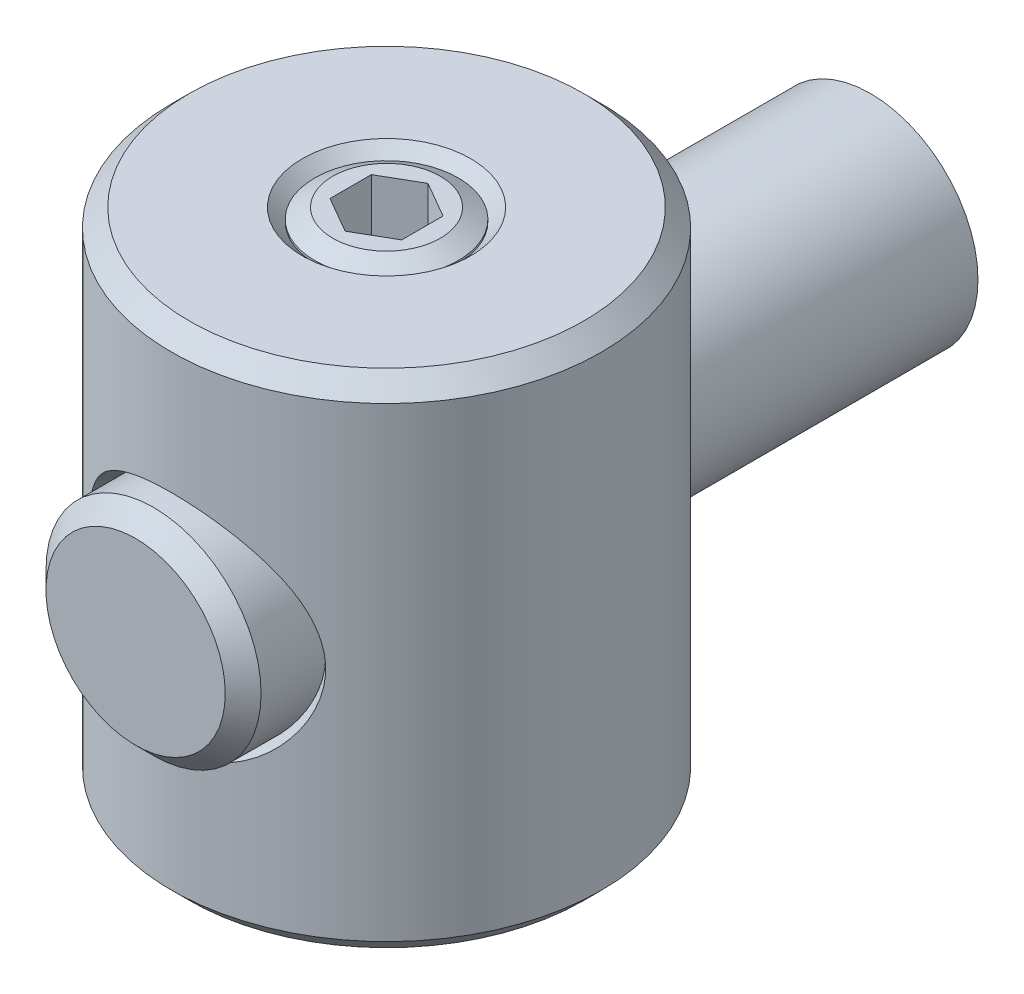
ISO-10303-21;
HEADER;
FILE_DESCRIPTION(('STEP AP214'),'2;1');
FILE_NAME('part.step','',(''),(''),'','','');
FILE_SCHEMA(('AUTOMOTIVE_DESIGN { 1 0 10303 214 1 1 1 1 }'));
ENDSEC;
DATA;
#1=APPLICATION_CONTEXT('core data for automotive mechanical design processes');
#2=APPLICATION_PROTOCOL_DEFINITION('international standard','automotive_design',2000,#1);
#3=PRODUCT_CONTEXT('',#1,'mechanical');
#4=PRODUCT('Part','Part','',(#3));
#5=PRODUCT_RELATED_PRODUCT_CATEGORY('part','',(#4));
#6=PRODUCT_DEFINITION_FORMATION('','',#4);
#7=PRODUCT_DEFINITION_CONTEXT('part definition',#1,'design');
#8=PRODUCT_DEFINITION('design','',#6,#7);
#9=PRODUCT_DEFINITION_SHAPE('','',#8);
#10=(LENGTH_UNIT() NAMED_UNIT(*) SI_UNIT(.MILLI.,.METRE.));
#11=(NAMED_UNIT(*) PLANE_ANGLE_UNIT() SI_UNIT($,.RADIAN.));
#12=(NAMED_UNIT(*) SI_UNIT($,.STERADIAN.) SOLID_ANGLE_UNIT());
#13=UNCERTAINTY_MEASURE_WITH_UNIT(LENGTH_MEASURE(1.E-05),#10,'distance_accuracy_value','');
#14=(GEOMETRIC_REPRESENTATION_CONTEXT(3) GLOBAL_UNCERTAINTY_ASSIGNED_CONTEXT((#13)) GLOBAL_UNIT_ASSIGNED_CONTEXT((#10,
#11,#12)) REPRESENTATION_CONTEXT('',''));
#15=CARTESIAN_POINT('',(0.,0.,0.));
#16=DIRECTION('',(0.,0.,1.));
#17=DIRECTION('',(1.,0.,0.));
#18=AXIS2_PLACEMENT_3D('',#15,#16,#17);
#19=CARTESIAN_POINT('',(0.,7.,0.));
#20=DIRECTION('',(0.,1.,0.));
#21=DIRECTION('',(-1.,0.,0.));
#22=AXIS2_PLACEMENT_3D('',#19,#20,#21);
#23=CONICAL_SURFACE('',#22,2.35,0.785398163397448);
#24=CARTESIAN_POINT('',(0.,7.,0.));
#25=DIRECTION('',(0.,1.,0.));
#26=DIRECTION('',(-1.,0.,0.));
#27=AXIS2_PLACEMENT_3D('',#24,#25,#26);
#28=CIRCLE('',#27,2.35);
#29=CARTESIAN_POINT('',(-2.35,7.,0.));
#30=VERTEX_POINT('',#29);
#31=EDGE_CURVE('E213',#30,#30,#28,.T.);
#32=ORIENTED_EDGE('',*,*,#31,.T.);
#33=EDGE_LOOP('',(#32));
#34=FACE_BOUND('',#33,.T.);
#35=CARTESIAN_POINT('',(0.,6.65,0.));
#36=DIRECTION('',(0.,1.,0.));
#37=DIRECTION('',(-1.,0.,0.));
#38=AXIS2_PLACEMENT_3D('',#35,#36,#37);
#39=CIRCLE('',#38,2.);
#40=CARTESIAN_POINT('',(-2.,6.65,0.));
#41=VERTEX_POINT('',#40);
#42=EDGE_CURVE('E547',#41,#41,#39,.F.);
#43=ORIENTED_EDGE('',*,*,#42,.T.);
#44=EDGE_LOOP('',(#43));
#45=FACE_BOUND('',#44,.T.);
#46=ADVANCED_FACE('F15',(#34,#45),#23,.F.);
#47=CARTESIAN_POINT('',(0.,7.,0.));
#48=DIRECTION('',(0.,1.,0.));
#49=DIRECTION('',(-1.,0.,0.));
#50=AXIS2_PLACEMENT_3D('',#47,#48,#49);
#51=PLANE('',#50);
#52=ORIENTED_EDGE('',*,*,#31,.F.);
#53=EDGE_LOOP('',(#52));
#54=FACE_BOUND('',#53,.T.);
#55=CARTESIAN_POINT('',(0.,7.,0.));
#56=DIRECTION('',(0.,1.,0.));
#57=DIRECTION('',(-1.,0.,0.));
#58=AXIS2_PLACEMENT_3D('',#55,#56,#57);
#59=CIRCLE('',#58,5.5);
#60=CARTESIAN_POINT('',(-5.5,7.,0.));
#61=VERTEX_POINT('',#60);
#62=EDGE_CURVE('E277',#61,#61,#59,.T.);
#63=ORIENTED_EDGE('',*,*,#62,.T.);
#64=EDGE_LOOP('',(#63));
#65=FACE_BOUND('',#64,.T.);
#66=ADVANCED_FACE('F249',(#54,#65),#51,.T.);
#67=CARTESIAN_POINT('',(0.,6.5,0.));
#68=DIRECTION('',(0.,-1.,0.));
#69=DIRECTION('',(1.,0.,0.));
#70=AXIS2_PLACEMENT_3D('',#67,#68,#69);
#71=CONICAL_SURFACE('',#70,6.,0.785398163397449);
#72=ORIENTED_EDGE('',*,*,#62,.F.);
#73=EDGE_LOOP('',(#72));
#74=FACE_BOUND('',#73,.T.);
#75=CARTESIAN_POINT('',(0.,6.5,0.));
#76=DIRECTION('',(0.,1.,0.));
#77=DIRECTION('',(-1.,0.,0.));
#78=AXIS2_PLACEMENT_3D('',#75,#76,#77);
#79=CIRCLE('',#78,6.);
#80=CARTESIAN_POINT('',(-6.,6.5,0.));
#81=VERTEX_POINT('',#80);
#82=EDGE_CURVE('E284',#81,#81,#79,.F.);
#83=ORIENTED_EDGE('',*,*,#82,.F.);
#84=EDGE_LOOP('',(#83));
#85=FACE_BOUND('',#84,.T.);
#86=ADVANCED_FACE('F247',(#74,#85),#71,.T.);
#87=CARTESIAN_POINT('',(0.,-7.,0.));
#88=DIRECTION('',(0.,-1.,0.));
#89=DIRECTION('',(1.,0.,0.));
#90=AXIS2_PLACEMENT_3D('',#87,#88,#89);
#91=CYLINDRICAL_SURFACE('',#90,6.);
#92=CARTESIAN_POINT('',(-3.30893795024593,0.,-5.00509037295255));
#93=CARTESIAN_POINT('',(-3.30891466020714,0.026099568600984,-5.00510419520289));
#94=CARTESIAN_POINT('',(-3.3085327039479,0.0521983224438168,-5.005372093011));
#95=CARTESIAN_POINT('',(-3.30705738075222,0.104297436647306,-5.00640163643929));
#96=CARTESIAN_POINT('',(-3.30596588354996,0.130297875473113,-5.00716198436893));
#97=CARTESIAN_POINT('',(-3.30308012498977,0.182188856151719,-5.00916023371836));
#98=CARTESIAN_POINT('',(-3.30128727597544,0.208079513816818,-5.01039717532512));
#99=CARTESIAN_POINT('',(-3.29700792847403,0.259739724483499,-5.01333206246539));
#100=CARTESIAN_POINT('',(-3.294522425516,0.285509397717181,-5.01502934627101));
#101=CARTESIAN_POINT('',(-3.28886669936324,0.336916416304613,-5.01886851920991));
#102=CARTESIAN_POINT('',(-3.2856970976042,0.362553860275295,-5.02101000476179));
#103=CARTESIAN_POINT('',(-3.27868212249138,0.413685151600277,-5.02572117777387));
#104=CARTESIAN_POINT('',(-3.27483703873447,0.439179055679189,-5.028290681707));
#105=CARTESIAN_POINT('',(-3.26647989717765,0.490012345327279,-5.03384159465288));
#106=CARTESIAN_POINT('',(-3.26196783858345,0.515351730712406,-5.03682300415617));
#107=CARTESIAN_POINT('',(-3.25228587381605,0.565863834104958,-5.04318123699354));
#108=CARTESIAN_POINT('',(-3.24711571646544,0.591036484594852,-5.04655821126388));
#109=CARTESIAN_POINT('',(-3.23062369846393,0.666322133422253,-5.0572629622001));
#110=CARTESIAN_POINT('',(-3.21832966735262,0.716145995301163,-5.06515829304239));
#111=CARTESIAN_POINT('',(-3.1912176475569,0.814991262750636,-5.08233420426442));
#112=CARTESIAN_POINT('',(-3.17639341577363,0.8640103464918,-5.09161820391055));
#113=CARTESIAN_POINT('',(-3.14429083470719,0.961162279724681,-5.11144192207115));
#114=CARTESIAN_POINT('',(-3.12700464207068,1.0092917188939,-5.12198563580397));
#115=CARTESIAN_POINT('',(-3.09004807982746,1.10457458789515,-5.14419921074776));
#116=CARTESIAN_POINT('',(-3.07036906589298,1.15172371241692,-5.1558731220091));
#117=CARTESIAN_POINT('',(-3.02869575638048,1.24495749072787,-5.18021816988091));
#118=CARTESIAN_POINT('',(-3.00669264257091,1.29103721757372,-5.19289305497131));
#119=CARTESIAN_POINT('',(-2.96043951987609,1.38204301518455,-5.21911141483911));
#120=CARTESIAN_POINT('',(-2.93618099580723,1.42696382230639,-5.2326581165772));
#121=CARTESIAN_POINT('',(-2.88548493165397,1.51556239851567,-5.26049157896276));
#122=CARTESIAN_POINT('',(-2.8590395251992,1.55923484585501,-5.27478093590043));
#123=CARTESIAN_POINT('',(-2.804037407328,1.64524699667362,-5.30397159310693));
#124=CARTESIAN_POINT('',(-2.77547371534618,1.68758157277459,-5.31887483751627));
#125=CARTESIAN_POINT('',(-2.71630195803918,1.77082801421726,-5.3491638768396));
#126=CARTESIAN_POINT('',(-2.68568794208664,1.81173516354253,-5.36455100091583));
#127=CARTESIAN_POINT('',(-2.62248443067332,1.89203657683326,-5.39568313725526));
#128=CARTESIAN_POINT('',(-2.58989009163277,1.93142671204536,-5.4114289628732));
#129=CARTESIAN_POINT('',(-2.52278690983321,2.00860366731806,-5.44313579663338));
#130=CARTESIAN_POINT('',(-2.48827432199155,2.04638707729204,-5.45909717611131));
#131=CARTESIAN_POINT('',(-2.41742501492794,2.12026029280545,-5.4911594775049));
#132=CARTESIAN_POINT('',(-2.38108565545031,2.15634749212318,-5.50726057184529));
#133=CARTESIAN_POINT('',(-2.30649450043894,2.22680178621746,-5.53930470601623));
#134=CARTESIAN_POINT('',(-2.26823760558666,2.26116374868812,-5.55524717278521));
#135=CARTESIAN_POINT('',(-2.18977615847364,2.32816767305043,-5.58671651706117));
#136=CARTESIAN_POINT('',(-2.14956405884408,2.36080175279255,-5.60224135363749));
#137=CARTESIAN_POINT('',(-2.06732567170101,2.42428215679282,-5.63283901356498));
#138=CARTESIAN_POINT('',(-2.02529314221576,2.45512131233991,-5.64790992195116));
#139=CARTESIAN_POINT('',(-1.93951833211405,2.51494319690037,-5.6774954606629));
#140=CARTESIAN_POINT('',(-1.89577094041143,2.54391956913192,-5.69200812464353));
#141=CARTESIAN_POINT('',(-1.80667873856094,2.59994731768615,-5.72039107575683));
#142=CARTESIAN_POINT('',(-1.76132988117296,2.62699320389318,-5.73425949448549));
#143=CARTESIAN_POINT('',(-1.66914506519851,2.67909129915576,-5.76126284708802));
#144=CARTESIAN_POINT('',(-1.62230599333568,2.7041388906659,-5.77439606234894));
#145=CARTESIAN_POINT('',(-1.52725175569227,2.75217172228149,-5.79983915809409));
#146=CARTESIAN_POINT('',(-1.47903426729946,2.77515317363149,-5.81214751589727));
#147=CARTESIAN_POINT('',(-1.38133419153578,2.81898508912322,-5.83585064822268));
#148=CARTESIAN_POINT('',(-1.3318499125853,2.83983249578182,-5.8472441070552));
#149=CARTESIAN_POINT('',(-1.2317274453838,2.8793277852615,-5.86902728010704));
#150=CARTESIAN_POINT('',(-1.18108802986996,2.89797318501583,-5.8794158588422));
#151=CARTESIAN_POINT('',(-1.07876662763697,2.93299607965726,-5.89909911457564));
#152=CARTESIAN_POINT('',(-1.02708371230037,2.94937144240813,-5.90839276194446));
#153=CARTESIAN_POINT('',(-0.922786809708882,2.9797861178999,-5.92579609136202));
#154=CARTESIAN_POINT('',(-0.870172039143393,2.99382335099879,-5.93390471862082));
#155=CARTESIAN_POINT('',(-0.764123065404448,3.01949389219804,-5.94884806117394));
#156=CARTESIAN_POINT('',(-0.710688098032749,3.03112479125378,-5.95568149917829));
#157=CARTESIAN_POINT('',(-0.603110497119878,3.05191530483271,-5.96798480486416));
#158=CARTESIAN_POINT('',(-0.548967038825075,3.0610717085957,-5.97345290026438));
#159=CARTESIAN_POINT('',(-0.4400842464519,3.07684588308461,-5.98293585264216));
#160=CARTESIAN_POINT('',(-0.385344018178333,3.08345907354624,-5.98694808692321));
#161=CARTESIAN_POINT('',(-0.275379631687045,3.09408181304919,-5.99343112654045));
#162=CARTESIAN_POINT('',(-0.220154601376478,3.09808475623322,-5.99589802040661));
#163=CARTESIAN_POINT('',(-0.109331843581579,3.10341606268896,-5.99919849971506));
#164=CARTESIAN_POINT('',(-0.0537334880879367,3.10473503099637,-6.00002634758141));
#165=CARTESIAN_POINT('',(0.0574361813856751,3.10465316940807,-5.99997308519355));
#166=CARTESIAN_POINT('',(0.113007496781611,3.10325349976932,-5.9990927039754));
#167=CARTESIAN_POINT('',(0.223728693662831,3.09779543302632,-5.99570879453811));
#168=CARTESIAN_POINT('',(0.278879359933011,3.09374848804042,-5.99321225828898));
#169=CARTESIAN_POINT('',(0.388654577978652,3.08305943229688,-5.98668333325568));
#170=CARTESIAN_POINT('',(0.443280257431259,3.07642580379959,-5.98265596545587));
#171=CARTESIAN_POINT('',(0.55190084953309,3.0606327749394,-5.97315623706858));
#172=CARTESIAN_POINT('',(0.605896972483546,3.05147955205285,-5.967687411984));
#173=CARTESIAN_POINT('',(0.713154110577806,3.03071428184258,-5.95539403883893));
#174=CARTESIAN_POINT('',(0.766416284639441,3.01910673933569,-5.94857197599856));
#175=CARTESIAN_POINT('',(0.872101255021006,2.99349962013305,-5.93366127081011));
#176=CARTESIAN_POINT('',(0.924525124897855,2.97950342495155,-5.92557442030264));
#177=CARTESIAN_POINT('',(1.02842922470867,2.94918512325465,-5.90822286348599));
#178=CARTESIAN_POINT('',(1.07991048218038,2.9328657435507,-5.89895953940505));
#179=CARTESIAN_POINT('',(1.18182502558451,2.89796677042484,-5.87934351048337));
#180=CARTESIAN_POINT('',(1.2322593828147,2.87938963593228,-5.86899199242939));
#181=CARTESIAN_POINT('',(1.33197568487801,2.84004046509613,-5.84728785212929));
#182=CARTESIAN_POINT('',(1.38125886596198,2.8192709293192,-5.83593637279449));
#183=CARTESIAN_POINT('',(1.47856822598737,2.77560197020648,-5.81232042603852));
#184=CARTESIAN_POINT('',(1.52659594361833,2.7527053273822,-5.80005715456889));
#185=CARTESIAN_POINT('',(1.62128967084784,2.70484693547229,-5.77470574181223));
#186=CARTESIAN_POINT('',(1.66795766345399,2.67988842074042,-5.76161889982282));
#187=CARTESIAN_POINT('',(1.7598269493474,2.62797090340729,-5.73470809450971));
#188=CARTESIAN_POINT('',(1.80503080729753,2.60101570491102,-5.72088554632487));
#189=CARTESIAN_POINT('',(1.89386717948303,2.5451693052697,-5.69259229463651));
#190=CARTESIAN_POINT('',(1.93750296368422,2.51628254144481,-5.67812310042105));
#191=CARTESIAN_POINT('',(2.0230965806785,2.45663751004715,-5.64862099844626));
#192=CARTESIAN_POINT('',(2.06505849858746,2.42588432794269,-5.63358966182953));
#193=CARTESIAN_POINT('',(2.14720447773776,2.36257066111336,-5.60306467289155));
#194=CARTESIAN_POINT('',(2.18739349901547,2.33001588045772,-5.58757254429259));
#195=CARTESIAN_POINT('',(2.2658683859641,2.26316429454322,-5.55616459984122));
#196=CARTESIAN_POINT('',(2.30416021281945,2.22887373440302,-5.5402503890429));
#197=CARTESIAN_POINT('',(2.37886058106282,2.15856384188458,-5.50824837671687));
#198=CARTESIAN_POINT('',(2.41527329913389,2.12254871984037,-5.4921610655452));
#199=CARTESIAN_POINT('',(2.48627729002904,2.04882374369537,-5.46010570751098));
#200=CARTESIAN_POINT('',(2.52087107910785,2.01111637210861,-5.44413752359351));
#201=CARTESIAN_POINT('',(2.58814490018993,1.93409149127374,-5.41240337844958));
#202=CARTESIAN_POINT('',(2.62082853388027,1.89477726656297,-5.39663708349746));
#203=CARTESIAN_POINT('',(2.68421518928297,1.81462188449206,-5.36545198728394));
#204=CARTESIAN_POINT('',(2.71492287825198,1.77378471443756,-5.35003242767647));
#205=CARTESIAN_POINT('',(2.77428393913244,1.6906671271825,-5.31966957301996));
#206=CARTESIAN_POINT('',(2.80294302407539,1.64839125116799,-5.30472502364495));
#207=CARTESIAN_POINT('',(2.85813502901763,1.56247998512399,-5.27544550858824));
#208=CARTESIAN_POINT('',(2.88467460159,1.51884949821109,-5.26110870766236));
#209=CARTESIAN_POINT('',(2.93555535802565,1.43031292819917,-5.23317688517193));
#210=CARTESIAN_POINT('',(2.95990395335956,1.38541187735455,-5.21957942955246));
#211=CARTESIAN_POINT('',(3.0063308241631,1.2944184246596,-5.19325883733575));
#212=CARTESIAN_POINT('',(3.02841698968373,1.2483309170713,-5.18053271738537));
#213=CARTESIAN_POINT('',(3.07024741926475,1.15504865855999,-5.15608712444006));
#214=CARTESIAN_POINT('',(3.0899996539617,1.10785837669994,-5.14436426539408));
#215=CARTESIAN_POINT('',(3.12709071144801,1.01245644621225,-5.12205760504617));
#216=CARTESIAN_POINT('',(3.14443704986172,0.964248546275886,-5.11147028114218));
#217=CARTESIAN_POINT('',(3.1766466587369,0.866892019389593,-5.09156595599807));
#218=CARTESIAN_POINT('',(3.19151629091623,0.81774617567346,-5.08224571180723));
#219=CARTESIAN_POINT('',(3.21191167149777,0.743366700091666,-5.06931312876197));
#220=CARTESIAN_POINT('',(3.21838830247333,0.718480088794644,-5.06517928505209));
#221=CARTESIAN_POINT('',(3.23069530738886,0.668504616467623,-5.05727808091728));
#222=CARTESIAN_POINT('',(3.23652605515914,0.643415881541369,-5.0535105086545));
#223=CARTESIAN_POINT('',(3.24753224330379,0.593047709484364,-5.04635843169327));
#224=CARTESIAN_POINT('',(3.25270784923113,0.567768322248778,-5.04297383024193));
#225=CARTESIAN_POINT('',(3.2623951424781,0.517029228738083,-5.03660400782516));
#226=CARTESIAN_POINT('',(3.26690674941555,0.491569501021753,-5.03361883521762));
#227=CARTESIAN_POINT('',(3.27525736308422,0.440480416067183,-5.02806421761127));
#228=CARTESIAN_POINT('',(3.27909600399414,0.414850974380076,-5.02549499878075));
#229=CARTESIAN_POINT('',(3.28609207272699,0.363433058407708,-5.02078858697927));
#230=CARTESIAN_POINT('',(3.289248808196,0.337644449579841,-5.01865183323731));
#231=CARTESIAN_POINT('',(3.29487248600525,0.285918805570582,-5.01482661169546));
#232=CARTESIAN_POINT('',(3.29733836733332,0.259981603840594,-5.01313883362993));
#233=CARTESIAN_POINT('',(3.30157180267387,0.20796935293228,-5.0102278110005));
#234=CARTESIAN_POINT('',(3.30333788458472,0.181894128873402,-5.0090055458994));
#235=CARTESIAN_POINT('',(3.30616322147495,0.129616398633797,-5.00704165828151));
#236=CARTESIAN_POINT('',(3.30722055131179,0.103413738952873,-5.0063013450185));
#237=CARTESIAN_POINT('',(3.30861995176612,0.0508916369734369,-5.00531780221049));
#238=CARTESIAN_POINT('',(3.30895960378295,0.0245720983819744,-5.00507625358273));
#239=CARTESIAN_POINT('',(3.30891524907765,-0.0280660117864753,-5.00510518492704));
#240=CARTESIAN_POINT('',(3.30853124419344,-0.0543845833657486,-5.00537566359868));
#241=CARTESIAN_POINT('',(3.30704329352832,-0.106902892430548,-5.00641478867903));
#242=CARTESIAN_POINT('',(3.30594177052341,-0.133102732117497,-5.00718175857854));
#243=CARTESIAN_POINT('',(3.30302838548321,-0.185373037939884,-5.00919732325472));
#244=CARTESIAN_POINT('',(3.30121845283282,-0.211443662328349,-5.01044460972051));
#245=CARTESIAN_POINT('',(3.29689778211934,-0.263445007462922,-5.01340393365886));
#246=CARTESIAN_POINT('',(3.29438852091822,-0.289375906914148,-5.01511499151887));
#247=CARTESIAN_POINT('',(3.28867869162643,-0.341087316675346,-5.01898512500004));
#248=CARTESIAN_POINT('',(3.28547919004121,-0.36686799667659,-5.0211435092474));
#249=CARTESIAN_POINT('',(3.27839833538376,-0.41826850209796,-5.02589157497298));
#250=CARTESIAN_POINT('',(3.27451768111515,-0.443888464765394,-5.02848081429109));
#251=CARTESIAN_POINT('',(3.26608392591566,-0.494957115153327,-5.03407392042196));
#252=CARTESIAN_POINT('',(3.26153119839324,-0.52040588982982,-5.03707755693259));
#253=CARTESIAN_POINT('',(3.25176268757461,-0.571121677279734,-5.04348280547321));
#254=CARTESIAN_POINT('',(3.24654699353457,-0.596388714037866,-5.04688436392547));
#255=CARTESIAN_POINT('',(3.23546179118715,-0.646730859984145,-5.05406890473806));
#256=CARTESIAN_POINT('',(3.22959212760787,-0.671805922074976,-5.057851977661));
#257=CARTESIAN_POINT('',(3.21720859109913,-0.721752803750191,-5.0657827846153));
#258=CARTESIAN_POINT('',(3.2106943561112,-0.746624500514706,-5.06993072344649));
#259=CARTESIAN_POINT('',(3.19018848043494,-0.820956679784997,-5.08290345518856));
#260=CARTESIAN_POINT('',(3.17524804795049,-0.870069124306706,-5.09224778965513));
#261=CARTESIAN_POINT('',(3.14290365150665,-0.96735475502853,-5.11219534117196));
#262=CARTESIAN_POINT('',(3.12549345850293,-1.0155252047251,-5.1228017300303));
#263=CARTESIAN_POINT('',(3.08828259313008,-1.11084871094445,-5.14514197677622));
#264=CARTESIAN_POINT('',(3.0684745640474,-1.15799808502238,-5.15687928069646));
#265=CARTESIAN_POINT('',(3.02654153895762,-1.2511955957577,-5.18134962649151));
#266=CARTESIAN_POINT('',(3.00440875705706,-1.29723935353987,-5.19408597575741));
#267=CARTESIAN_POINT('',(2.95789874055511,-1.38814295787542,-5.22042329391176));
#268=CARTESIAN_POINT('',(2.93351382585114,-1.43299802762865,-5.23402716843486));
#269=CARTESIAN_POINT('',(2.88257160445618,-1.52144086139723,-5.26196849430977));
#270=CARTESIAN_POINT('',(2.85600712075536,-1.56502374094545,-5.27630830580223));
#271=CARTESIAN_POINT('',(2.80077758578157,-1.65083861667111,-5.30559091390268));
#272=CARTESIAN_POINT('',(2.77210614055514,-1.69306589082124,-5.32053547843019));
#273=CARTESIAN_POINT('',(2.71273365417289,-1.7760855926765,-5.35089579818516));
#274=CARTESIAN_POINT('',(2.6820271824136,-1.81687369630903,-5.3663127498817));
#275=CARTESIAN_POINT('',(2.61865769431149,-1.89693113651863,-5.39749057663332));
#276=CARTESIAN_POINT('',(2.58599031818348,-1.93619674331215,-5.41325216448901));
#277=CARTESIAN_POINT('',(2.51876355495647,-2.01312401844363,-5.44497478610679));
#278=CARTESIAN_POINT('',(2.4842008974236,-2.05078270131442,-5.46093612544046));
#279=CARTESIAN_POINT('',(2.41327960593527,-2.12441471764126,-5.49297772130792));
#280=CARTESIAN_POINT('',(2.37691881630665,-2.1603859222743,-5.50905809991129));
#281=CARTESIAN_POINT('',(2.30230338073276,-2.23061836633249,-5.54105011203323));
#282=CARTESIAN_POINT('',(2.26404385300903,-2.26487468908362,-5.55696116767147));
#283=CARTESIAN_POINT('',(2.185582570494,-2.33167282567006,-5.58836921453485));
#284=CARTESIAN_POINT('',(2.14537317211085,-2.36420663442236,-5.60386413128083));
#285=CARTESIAN_POINT('',(2.06314657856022,-2.42749397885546,-5.63440089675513));
#286=CARTESIAN_POINT('',(2.02112308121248,-2.45824026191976,-5.64944079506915));
#287=CARTESIAN_POINT('',(1.93537165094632,-2.51788215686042,-5.67896381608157));
#288=CARTESIAN_POINT('',(1.89163856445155,-2.5467713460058,-5.69344494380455));
#289=CARTESIAN_POINT('',(1.80257977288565,-2.60262976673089,-5.72176403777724));
#290=CARTESIAN_POINT('',(1.75724999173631,-2.62959345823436,-5.73560011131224));
#291=CARTESIAN_POINT('',(1.66510746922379,-2.681531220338,-5.76253792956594));
#292=CARTESIAN_POINT('',(1.61829159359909,-2.706500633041,-5.77563793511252));
#293=CARTESIAN_POINT('',(1.52328727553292,-2.75438025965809,-5.801013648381));
#294=CARTESIAN_POINT('',(1.47509649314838,-2.77728664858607,-5.81328781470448));
#295=CARTESIAN_POINT('',(1.37745273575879,-2.820970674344,-5.83692150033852));
#296=CARTESIAN_POINT('',(1.32799805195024,-2.84174521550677,-5.84827968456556));
#297=CARTESIAN_POINT('',(1.22793706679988,-2.88109610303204,-5.8699911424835));
#298=CARTESIAN_POINT('',(1.17732951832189,-2.89966991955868,-5.88034325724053));
#299=CARTESIAN_POINT('',(1.07507352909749,-2.93455007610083,-5.89995232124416));
#300=CARTESIAN_POINT('',(1.02342413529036,-2.95085422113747,-5.90920820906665));
#301=CARTESIAN_POINT('',(0.919195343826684,-2.98112599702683,-5.92653466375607));
#302=CARTESIAN_POINT('',(0.866615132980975,-2.99509146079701,-5.93460413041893));
#303=CARTESIAN_POINT('',(0.76063573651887,-3.02061711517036,-5.94946770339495));
#304=CARTESIAN_POINT('',(0.707235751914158,-3.03217477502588,-5.95626046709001));
#305=CARTESIAN_POINT('',(0.599727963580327,-3.05281658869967,-5.96848091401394));
#306=CARTESIAN_POINT('',(0.545619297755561,-3.06189736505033,-5.97390673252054));
#307=CARTESIAN_POINT('',(0.436805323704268,-3.07751719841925,-5.9833034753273));
#308=CARTESIAN_POINT('',(0.382099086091,-3.08405145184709,-5.98727164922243));
#309=CARTESIAN_POINT('',(0.27220129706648,-3.09451238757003,-5.99366511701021));
#310=CARTESIAN_POINT('',(0.217008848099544,-3.0984321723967,-5.99608632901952));
#311=CARTESIAN_POINT('',(0.106249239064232,-3.10359236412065,-5.99929292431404));
#312=CARTESIAN_POINT('',(0.050681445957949,-3.10482300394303,-6.00007234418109));
#313=CARTESIAN_POINT('',(-0.0604286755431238,-3.10455944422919,-5.99992370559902));
#314=CARTESIAN_POINT('',(-0.115971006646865,-3.10306603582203,-5.99899614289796));
#315=CARTESIAN_POINT('',(-0.226635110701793,-3.09741819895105,-5.99552334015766));
#316=CARTESIAN_POINT('',(-0.28175767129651,-3.09327490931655,-5.99298487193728));
#317=CARTESIAN_POINT('',(-0.391477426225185,-3.08239311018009,-5.98637645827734));
#318=CARTESIAN_POINT('',(-0.446075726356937,-3.07566278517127,-5.98231134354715));
#319=CARTESIAN_POINT('',(-0.554642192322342,-3.05967856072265,-5.97274068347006));
#320=CARTESIAN_POINT('',(-0.608611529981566,-3.05043057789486,-5.9672385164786));
#321=CARTESIAN_POINT('',(-0.715815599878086,-3.0294802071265,-5.95488285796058));
#322=CARTESIAN_POINT('',(-0.769051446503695,-3.01778211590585,-5.94803173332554));
#323=CARTESIAN_POINT('',(-0.874684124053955,-2.99200052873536,-5.93306722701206));
#324=CARTESIAN_POINT('',(-0.927081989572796,-2.97792027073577,-5.92495555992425));
#325=CARTESIAN_POINT('',(-1.03093428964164,-2.94744267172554,-5.90755859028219));
#326=CARTESIAN_POINT('',(-1.08238973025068,-2.9310479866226,-5.89827463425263));
#327=CARTESIAN_POINT('',(-1.18425268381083,-2.89600942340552,-5.87862146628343));
#328=CARTESIAN_POINT('',(-1.23466127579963,-2.87736801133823,-5.86825344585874));
#329=CARTESIAN_POINT('',(-1.33432591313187,-2.8379034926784,-5.84652033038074));
#330=CARTESIAN_POINT('',(-1.38358324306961,-2.81708297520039,-5.83515642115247));
#331=CARTESIAN_POINT('',(-1.48084058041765,-2.77332744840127,-5.81151955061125));
#332=CARTESIAN_POINT('',(-1.52884222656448,-2.75039539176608,-5.79924786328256));
#333=CARTESIAN_POINT('',(-1.62348327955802,-2.7024837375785,-5.77388346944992));
#334=CARTESIAN_POINT('',(-1.67012483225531,-2.67750763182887,-5.76079217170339));
#335=CARTESIAN_POINT('',(-1.76194053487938,-2.6255747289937,-5.73387620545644));
#336=CARTESIAN_POINT('',(-1.80711748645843,-2.5986220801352,-5.72005308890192));
#337=CARTESIAN_POINT('',(-1.89589897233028,-2.54280257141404,-5.6917624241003));
#338=CARTESIAN_POINT('',(-1.93950710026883,-2.51394058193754,-5.67729654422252));
#339=CARTESIAN_POINT('',(-2.02504464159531,-2.45436975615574,-5.64780451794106));
#340=CARTESIAN_POINT('',(-2.06697856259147,-2.42366652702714,-5.6327801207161));
#341=CARTESIAN_POINT('',(-2.14906550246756,-2.36047704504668,-5.60227312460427));
#342=CARTESIAN_POINT('',(-2.18922402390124,-2.32799711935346,-5.58679223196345));
#343=CARTESIAN_POINT('',(-2.26764215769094,-2.26133117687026,-5.55540809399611));
#344=CARTESIAN_POINT('',(-2.30590838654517,-2.22715208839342,-5.53950667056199));
#345=CARTESIAN_POINT('',(-2.38055378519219,-2.15704904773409,-5.50753275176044));
#346=CARTESIAN_POINT('',(-2.41693703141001,-2.12112922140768,-5.49146072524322));
#347=CARTESIAN_POINT('',(-2.48787241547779,-2.04753774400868,-5.45943965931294));
#348=CARTESIAN_POINT('',(-2.5224260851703,-2.00986760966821,-5.44349052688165));
#349=CARTESIAN_POINT('',(-2.58961859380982,-1.93287950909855,-5.41179502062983));
#350=CARTESIAN_POINT('',(-2.6222601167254,-1.89356399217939,-5.39604838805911));
#351=CARTESIAN_POINT('',(-2.68556020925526,-1.81337604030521,-5.36490347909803));
#352=CARTESIAN_POINT('',(-2.71622266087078,-1.77250691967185,-5.34950456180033));
#353=CARTESIAN_POINT('',(-2.77549221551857,-1.689306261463,-5.3191832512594));
#354=CARTESIAN_POINT('',(-2.80410441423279,-1.64697876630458,-5.30425973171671));
#355=CARTESIAN_POINT('',(-2.85920218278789,-1.56095504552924,-5.27502221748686));
#356=CARTESIAN_POINT('',(-2.88569400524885,-1.51726341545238,-5.26070649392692));
#357=CARTESIAN_POINT('',(-2.93647949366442,-1.42860554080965,-5.23281642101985));
#358=CARTESIAN_POINT('',(-2.96078044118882,-1.38364422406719,-5.21923968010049));
#359=CARTESIAN_POINT('',(-3.00711286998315,-1.29254120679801,-5.19295980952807));
#360=CARTESIAN_POINT('',(-3.02915244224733,-1.24640450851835,-5.18025362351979));
#361=CARTESIAN_POINT('',(-3.07089099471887,-1.15304534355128,-5.15584701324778));
#362=CARTESIAN_POINT('',(-3.09059854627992,-1.10582766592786,-5.14414295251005));
#363=CARTESIAN_POINT('',(-3.12760235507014,-1.0104010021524,-5.12187261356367));
#364=CARTESIAN_POINT('',(-3.14490720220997,-0.962196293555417,-5.11130231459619));
#365=CARTESIAN_POINT('',(-3.17703508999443,-0.864891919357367,-5.09143148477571));
#366=CARTESIAN_POINT('',(-3.19186612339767,-0.815795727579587,-5.08212688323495));
#367=CARTESIAN_POINT('',(-3.21897757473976,-0.716799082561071,-5.06491835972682));
#368=CARTESIAN_POINT('',(-3.23126459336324,-0.666901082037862,-5.05701082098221));
#369=CARTESIAN_POINT('',(-3.24773469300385,-0.59150589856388,-5.04629555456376));
#370=CARTESIAN_POINT('',(-3.25289534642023,-0.566298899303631,-5.04291657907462));
#371=CARTESIAN_POINT('',(-3.26255399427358,-0.515720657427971,-5.03655742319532));
#372=CARTESIAN_POINT('',(-3.26705232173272,-0.490349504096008,-5.0335770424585));
#373=CARTESIAN_POINT('',(-3.27537743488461,-0.439455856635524,-5.02803157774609));
#374=CARTESIAN_POINT('',(-3.27920431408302,-0.413933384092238,-5.02546643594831));
#375=CARTESIAN_POINT('',(-3.28617805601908,-0.362748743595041,-5.02076768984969));
#376=CARTESIAN_POINT('',(-3.28932473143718,-0.337086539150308,-5.0186342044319));
#377=CARTESIAN_POINT('',(-3.29492952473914,-0.285634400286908,-5.01481504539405));
#378=CARTESIAN_POINT('',(-3.29738713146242,-0.259844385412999,-5.01312970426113));
#379=CARTESIAN_POINT('',(-3.30160535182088,-0.208148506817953,-5.01022302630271));
#380=CARTESIAN_POINT('',(-3.30336508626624,-0.182242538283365,-5.00900227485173));
#381=CARTESIAN_POINT('',(-3.30617902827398,-0.130326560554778,-5.00704103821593));
#382=CARTESIAN_POINT('',(-3.30723194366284,-0.104316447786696,-5.00630143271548));
#383=CARTESIAN_POINT('',(-3.30862426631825,-0.0522042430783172,-5.00531831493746));
#384=CARTESIAN_POINT('',(-3.3089619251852,-0.0261020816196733,-5.00507601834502));
#385=CARTESIAN_POINT('',(-3.30893795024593,0.,-5.00509037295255));
#386=B_SPLINE_CURVE_WITH_KNOTS('',3,(#92,#93,#94,#95,#96,#97,#98,#99,#100,#101,#102,#103,#104,
#105,#106,#107,#108,#109,#110,#111,#112,#113,#114,#115,#116,#117,#118,#119,#120,#121,#122,#123,
#124,#125,#126,#127,#128,#129,#130,#131,#132,#133,#134,#135,#136,#137,#138,#139,#140,#141,#142,
#143,#144,#145,#146,#147,#148,#149,#150,#151,#152,#153,#154,#155,#156,#157,#158,#159,#160,#161,
#162,#163,#164,#165,#166,#167,#168,#169,#170,#171,#172,#173,#174,#175,#176,#177,#178,#179,#180,
#181,#182,#183,#184,#185,#186,#187,#188,#189,#190,#191,#192,#193,#194,#195,#196,#197,#198,#199,
#200,#201,#202,#203,#204,#205,#206,#207,#208,#209,#210,#211,#212,#213,#214,#215,#216,#217,#218,
#219,#220,#221,#222,#223,#224,#225,#226,#227,#228,#229,#230,#231,#232,#233,#234,#235,#236,#237,
#238,#239,#240,#241,#242,#243,#244,#245,#246,#247,#248,#249,#250,#251,#252,#253,#254,#255,#256,
#257,#258,#259,#260,#261,#262,#263,#264,#265,#266,#267,#268,#269,#270,#271,#272,#273,#274,#275,
#276,#277,#278,#279,#280,#281,#282,#283,#284,#285,#286,#287,#288,#289,#290,#291,#292,#293,#294,
#295,#296,#297,#298,#299,#300,#301,#302,#303,#304,#305,#306,#307,#308,#309,#310,#311,#312,#313,
#314,#315,#316,#317,#318,#319,#320,#321,#322,#323,#324,#325,#326,#327,#328,#329,#330,#331,#332,
#333,#334,#335,#336,#337,#338,#339,#340,#341,#342,#343,#344,#345,#346,#347,#348,#349,#350,#351,
#352,#353,#354,#355,#356,#357,#358,#359,#360,#361,#362,#363,#364,#365,#366,#367,#368,#369,#370,
#371,#372,#373,#374,#375,#376,#377,#378,#379,#380,#381,#382,#383,#384,#385),.UNSPECIFIED.,.F.,
.F.,(4,2,2,2,2,2,2,2,2,2,2,2,2,2,2,2,2,2,2,2,2,2,2,2,2,2,2,2,2,2,2,2,2,2,2,2,2,2,2,2,2,2,2,2,2,
2,2,2,2,2,2,2,2,2,2,2,2,2,2,2,2,2,2,2,2,2,2,2,2,2,2,2,2,2,2,2,2,2,2,2,2,2,2,2,2,2,2,2,2,2,2,2,2,
2,2,2,2,2,2,2,2,2,2,2,2,2,2,2,2,2,2,2,2,2,2,2,2,2,2,2,2,2,2,2,2,2,2,2,2,2,2,2,2,2,2,2,2,2,2,2,2,
2,2,2,2,2,4),(0.,0.078294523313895,0.156383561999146,0.234316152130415,0.312137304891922,
0.389888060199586,0.467605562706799,0.545323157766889,0.623070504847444,0.778738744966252,
0.934796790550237,1.09136361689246,1.24851387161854,1.40628340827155,1.56467486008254,
1.7236631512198,1.88320088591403,2.04322359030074,2.20365480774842,2.36441106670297,
2.52540675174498,2.68685599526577,2.84898750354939,3.01172746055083,3.17499613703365,
3.33871201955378,3.50279586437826,3.66717470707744,3.8317858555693,3.99658088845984,
4.16152967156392,4.32662439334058,4.49188360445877,4.65735622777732,4.82312548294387,
4.98931264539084,5.15608053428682,5.32277726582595,5.48875759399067,5.65419815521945,
5.81923665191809,5.98397481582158,6.14848167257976,6.3127970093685,6.47693496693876,
6.64088769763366,6.80462904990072,6.96811825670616,7.13130361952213,7.2941261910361,
7.4565234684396,7.61843311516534,7.7797967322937,7.94078470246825,8.10154376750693,
8.2619892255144,8.42204062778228,8.58162670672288,8.74069040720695,8.89919404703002,
9.05712461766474,9.2144992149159,9.37137055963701,9.52783253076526,9.60596031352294,
9.68404263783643,9.76210519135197,9.8401771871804,9.91829149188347,9.99648473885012,
10.0747974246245,10.1532739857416,10.231962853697,10.3109164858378,10.3898699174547,
10.4685581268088,10.5470335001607,10.625344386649,10.7035351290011,10.7816461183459,
10.8597138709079,10.937771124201,11.0158469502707,11.0939668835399,11.2504084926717,
11.4072519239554,11.5645893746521,11.7224716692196,11.8809137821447,12.0399003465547,
12.1993910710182,12.3593260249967,12.5196307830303,12.6802214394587,12.8410095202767,
13.0022348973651,13.1641534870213,13.3266887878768,13.4897589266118,13.6532807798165,
13.8171740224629,13.9813651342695,14.145791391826,14.3104048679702,14.4751764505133,
14.6400998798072,14.8051957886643,14.9705157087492,15.1361459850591,15.3022115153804,
15.4688792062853,15.6354985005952,15.8014219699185,15.9668247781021,16.1318421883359,
16.2965725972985,16.4610808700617,16.6254018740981,16.7895441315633,16.953493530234,
17.1172170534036,17.2806665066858,17.4437822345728,17.6064968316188,17.7687388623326,
17.9304366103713,18.0915218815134,18.2522424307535,18.4128262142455,18.573178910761,
18.7332068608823,18.8928221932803,19.0519480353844,19.2105238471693,19.3685109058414,
19.5258979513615,19.6827069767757,19.8389991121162,19.9948805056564,20.0727229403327,
20.1505261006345,20.2283184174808,20.3061321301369,20.3840034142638,20.4619724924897,
20.5400837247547,20.6183856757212),.UNSPECIFIED.);
#387=CARTESIAN_POINT('',(-3.30893795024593,0.,-5.00509037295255));
#388=VERTEX_POINT('',#387);
#389=EDGE_CURVE('E270',#388,#388,#386,.F.);
#390=ORIENTED_EDGE('',*,*,#389,.T.);
#391=EDGE_LOOP('',(#390));
#392=FACE_BOUND('',#391,.T.);
#393=CARTESIAN_POINT('',(0.,-3.10469458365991,6.));
#394=CARTESIAN_POINT('',(0.0554927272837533,-3.10469800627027,6.00000054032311));
#395=CARTESIAN_POINT('',(0.11098127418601,-3.10333643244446,5.99914626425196));
#396=CARTESIAN_POINT('',(0.221574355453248,-3.09793791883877,5.99580939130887));
#397=CARTESIAN_POINT('',(0.276679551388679,-3.09391085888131,5.99333280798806));
#398=CARTESIAN_POINT('',(0.386394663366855,-3.08324963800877,5.98684022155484));
#399=CARTESIAN_POINT('',(0.441005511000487,-3.0766224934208,5.98282836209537));
#400=CARTESIAN_POINT('',(0.549624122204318,-3.06083195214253,5.97335588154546));
#401=CARTESIAN_POINT('',(0.603632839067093,-3.05167342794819,5.9678980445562));
#402=CARTESIAN_POINT('',(0.7109387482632,-3.03088934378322,5.95562313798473));
#403=CARTESIAN_POINT('',(0.764236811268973,-3.01926716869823,5.94880793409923));
#404=CARTESIAN_POINT('',(0.870013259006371,-2.99362459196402,5.93390756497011));
#405=CARTESIAN_POINT('',(0.922492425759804,-2.97960665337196,5.92582370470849));
#406=CARTESIAN_POINT('',(1.02652283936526,-2.94924073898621,5.90847490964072));
#407=CARTESIAN_POINT('',(1.07807484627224,-2.93289477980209,5.89921099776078));
#408=CARTESIAN_POINT('',(1.18014261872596,-2.89794056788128,5.87959073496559));
#409=CARTESIAN_POINT('',(1.23065923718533,-2.87933427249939,5.86923533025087));
#410=CARTESIAN_POINT('',(1.33054777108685,-2.83992675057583,5.84752053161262));
#411=CARTESIAN_POINT('',(1.37992077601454,-2.8191277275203,5.83616214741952));
#412=CARTESIAN_POINT('',(1.47741345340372,-2.77540182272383,5.81252968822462));
#413=CARTESIAN_POINT('',(1.52553460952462,-2.75247762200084,5.8002567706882));
#414=CARTESIAN_POINT('',(1.62041481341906,-2.70456819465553,5.77488356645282));
#415=CARTESIAN_POINT('',(1.66717589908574,-2.67958629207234,5.76178462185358));
#416=CARTESIAN_POINT('',(1.7592269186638,-2.62762819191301,5.73484729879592));
#417=CARTESIAN_POINT('',(1.80451959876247,-2.60065606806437,5.72101044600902));
#418=CARTESIAN_POINT('',(1.89352495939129,-2.54478393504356,5.69268658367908));
#419=CARTESIAN_POINT('',(1.93724123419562,-2.51588880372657,5.67820124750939));
#420=CARTESIAN_POINT('',(2.02298345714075,-2.45623781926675,5.64866477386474));
#421=CARTESIAN_POINT('',(2.06501397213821,-2.42548765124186,5.63361541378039));
#422=CARTESIAN_POINT('',(2.14727917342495,-2.36219074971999,5.60305373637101));
#423=CARTESIAN_POINT('',(2.18751947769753,-2.32965047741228,5.58754316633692));
#424=CARTESIAN_POINT('',(2.26608027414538,-2.26284870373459,5.55609355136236));
#425=CARTESIAN_POINT('',(2.30440756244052,-2.22859431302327,5.54015638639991));
#426=CARTESIAN_POINT('',(2.37916620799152,-2.15832345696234,5.50810796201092));
#427=CARTESIAN_POINT('',(2.41560141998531,-2.12231088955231,5.49199714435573));
#428=CARTESIAN_POINT('',(2.48664744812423,-2.04851747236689,5.45989885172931));
#429=CARTESIAN_POINT('',(2.5212592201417,-2.01073756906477,5.44391131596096));
#430=CARTESIAN_POINT('',(2.588570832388,-1.93351439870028,5.41213858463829));
#431=CARTESIAN_POINT('',(2.62127284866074,-1.8940731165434,5.3963531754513));
#432=CARTESIAN_POINT('',(2.68469570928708,-1.81362089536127,5.36513163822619));
#433=CARTESIAN_POINT('',(2.71542000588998,-1.77261290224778,5.34969493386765));
#434=CARTESIAN_POINT('',(2.77481318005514,-1.68912406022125,5.31929975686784));
#435=CARTESIAN_POINT('',(2.80348680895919,-1.64664697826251,5.30434022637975));
#436=CARTESIAN_POINT('',(2.85870570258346,-1.56031608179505,5.27503334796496));
#437=CARTESIAN_POINT('',(2.88525696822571,-1.5164666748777,5.26068433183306));
#438=CARTESIAN_POINT('',(2.93615788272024,-1.42748765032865,5.23273125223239));
#439=CARTESIAN_POINT('',(2.96051466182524,-1.38236285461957,5.21912483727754));
#440=CARTESIAN_POINT('',(3.00695357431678,-1.2909297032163,5.19279014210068));
#441=CARTESIAN_POINT('',(3.02904375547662,-1.24462631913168,5.18005881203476));
#442=CARTESIAN_POINT('',(3.07087661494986,-1.15093303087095,5.15560739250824));
#443=CARTESIAN_POINT('',(3.09062793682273,-1.10354795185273,5.14388362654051));
#444=CARTESIAN_POINT('',(3.12771063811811,-1.00778816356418,5.1215803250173));
#445=CARTESIAN_POINT('',(3.14505080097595,-0.959417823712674,5.11099666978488));
#446=CARTESIAN_POINT('',(3.17723892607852,-0.861786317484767,5.09110655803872));
#447=CARTESIAN_POINT('',(3.19209519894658,-0.812528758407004,5.0817958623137));
#448=CARTESIAN_POINT('',(3.21924499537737,-0.713215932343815,5.06458356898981));
#449=CARTESIAN_POINT('',(3.23154555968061,-0.663163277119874,5.05667810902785));
#450=CARTESIAN_POINT('',(3.24802642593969,-0.587538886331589,5.04597247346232));
#451=CARTESIAN_POINT('',(3.25318876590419,-0.562257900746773,5.04259799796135));
#452=CARTESIAN_POINT('',(3.26284715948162,-0.511534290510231,5.03625028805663));
#453=CARTESIAN_POINT('',(3.26734362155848,-0.486091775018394,5.03327680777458));
#454=CARTESIAN_POINT('',(3.27566117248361,-0.435058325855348,5.02774770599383));
#455=CARTESIAN_POINT('',(3.27948243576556,-0.409467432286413,5.02519197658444));
#456=CARTESIAN_POINT('',(3.28644089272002,-0.358149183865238,5.02051474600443));
#457=CARTESIAN_POINT('',(3.28957798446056,-0.33242180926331,5.01839330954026));
#458=CARTESIAN_POINT('',(3.29515940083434,-0.280842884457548,5.01460102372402));
#459=CARTESIAN_POINT('',(3.29760330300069,-0.254991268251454,5.01293044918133));
#460=CARTESIAN_POINT('',(3.30178951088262,-0.203176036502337,5.01005632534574));
#461=CARTESIAN_POINT('',(3.30353102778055,-0.177212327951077,5.00885330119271));
#462=CARTESIAN_POINT('',(3.30630443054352,-0.125185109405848,5.00693018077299));
#463=CARTESIAN_POINT('',(3.30733511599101,-0.0991215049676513,5.00621090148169));
#464=CARTESIAN_POINT('',(3.30867604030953,-0.0469065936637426,5.00527299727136));
#465=CARTESIAN_POINT('',(3.30898461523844,-0.0207552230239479,5.00505552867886));
#466=CARTESIAN_POINT('',(3.30888130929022,0.0315373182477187,5.00513181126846));
#467=CARTESIAN_POINT('',(3.30846964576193,0.0576784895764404,5.00542540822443));
#468=CARTESIAN_POINT('',(3.30693854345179,0.109853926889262,5.0065049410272));
#469=CARTESIAN_POINT('',(3.30582115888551,0.135888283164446,5.00728944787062));
#470=CARTESIAN_POINT('',(3.30288517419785,0.187839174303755,5.00933575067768));
#471=CARTESIAN_POINT('',(3.30106817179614,0.21375584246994,5.0105964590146));
#472=CARTESIAN_POINT('',(3.29674231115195,0.265460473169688,5.01357828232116));
#473=CARTESIAN_POINT('',(3.2942346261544,0.29124857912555,5.01529861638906));
#474=CARTESIAN_POINT('',(3.2885359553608,0.342685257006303,5.01918335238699));
#475=CARTESIAN_POINT('',(3.28534576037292,0.368333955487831,5.0213472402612));
#476=CARTESIAN_POINT('',(3.27829081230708,0.419480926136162,5.02610263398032));
#477=CARTESIAN_POINT('',(3.27442650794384,0.44497928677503,5.02869385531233));
#478=CARTESIAN_POINT('',(3.26603188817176,0.495815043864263,5.0342876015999));
#479=CARTESIAN_POINT('',(3.26150171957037,0.521152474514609,5.03729003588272));
#480=CARTESIAN_POINT('',(3.25178426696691,0.571654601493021,5.04368968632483));
#481=CARTESIAN_POINT('',(3.2465968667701,0.596819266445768,5.04708697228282));
#482=CARTESIAN_POINT('',(3.23005528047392,0.672065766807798,5.05785076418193));
#483=CARTESIAN_POINT('',(3.21772880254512,0.721857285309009,5.06578444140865));
#484=CARTESIAN_POINT('',(3.19055146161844,0.820618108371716,5.08303451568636));
#485=CARTESIAN_POINT('',(3.17569510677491,0.869585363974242,5.09235391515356));
#486=CARTESIAN_POINT('',(3.14352607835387,0.966616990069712,5.11224563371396));
#487=CARTESIAN_POINT('',(3.12620608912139,1.01467817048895,5.12282166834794));
#488=CARTESIAN_POINT('',(3.08917795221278,1.10981101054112,5.14509683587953));
#489=CARTESIAN_POINT('',(3.0694614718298,1.15687850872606,5.15679985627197));
#490=CARTESIAN_POINT('',(3.02770745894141,1.24993868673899,5.18119984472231));
#491=CARTESIAN_POINT('',(3.00566121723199,1.29592648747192,5.19390049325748));
#492=CARTESIAN_POINT('',(2.95931426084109,1.38674126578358,5.22016689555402));
#493=CARTESIAN_POINT('',(2.93500495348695,1.43156291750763,5.23373587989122));
#494=CARTESIAN_POINT('',(2.8841979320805,1.5199592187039,5.26161024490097));
#495=CARTESIAN_POINT('',(2.8576921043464,1.56352836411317,5.27591827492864));
#496=CARTESIAN_POINT('',(2.80255788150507,1.64933312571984,5.30514243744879));
#497=CARTESIAN_POINT('',(2.77392210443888,1.69156330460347,5.32006059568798));
#498=CARTESIAN_POINT('',(2.71459318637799,1.77460347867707,5.35037554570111));
#499=CARTESIAN_POINT('',(2.68389355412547,1.81540831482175,5.36577375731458));
#500=CARTESIAN_POINT('',(2.62050348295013,1.89551047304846,5.39692378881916));
#501=CARTESIAN_POINT('',(2.58780753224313,1.93480308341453,5.41267650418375));
#502=CARTESIAN_POINT('',(2.52048567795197,2.01179498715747,5.44439362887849));
#503=CARTESIAN_POINT('',(2.48585524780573,2.04949014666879,5.46035846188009));
#504=CARTESIAN_POINT('',(2.41474635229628,2.12319483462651,5.49242077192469));
#505=CARTESIAN_POINT('',(2.37826435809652,2.15920087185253,5.50851844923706));
#506=CARTESIAN_POINT('',(2.30340774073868,2.22950353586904,5.54055192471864));
#507=CARTESIAN_POINT('',(2.26502808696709,2.26379507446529,5.55648714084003));
#508=CARTESIAN_POINT('',(2.18637449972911,2.33066630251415,5.58794124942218));
#509=CARTESIAN_POINT('',(2.14609409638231,2.36323920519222,5.60345838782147));
#510=CARTESIAN_POINT('',(2.06375730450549,2.42659927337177,5.63403662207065));
#511=CARTESIAN_POINT('',(2.0216955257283,2.45738023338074,5.64909605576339));
#512=CARTESIAN_POINT('',(1.93589339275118,2.51708855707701,5.67865561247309));
#513=CARTESIAN_POINT('',(1.89214858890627,2.54601037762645,5.69315401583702));
#514=CARTESIAN_POINT('',(1.8030835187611,2.60193084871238,5.72150526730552));
#515=CARTESIAN_POINT('',(1.7577596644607,2.62892462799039,5.73535645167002));
#516=CARTESIAN_POINT('',(1.66563818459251,2.68091987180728,5.762322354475));
#517=CARTESIAN_POINT('',(1.61883770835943,2.70591710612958,5.77543549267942));
#518=CARTESIAN_POINT('',(1.52386520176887,2.75385002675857,5.80083559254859));
#519=CARTESIAN_POINT('',(1.4756909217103,2.77678204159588,5.81312107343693));
#520=CARTESIAN_POINT('',(1.37807304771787,2.82051540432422,5.83677580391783));
#521=CARTESIAN_POINT('',(1.32862765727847,2.84131350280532,5.8481436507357));
#522=CARTESIAN_POINT('',(1.228569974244,2.88071004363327,5.86987317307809));
#523=CARTESIAN_POINT('',(1.17795618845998,2.89930546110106,5.88023346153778));
#524=CARTESIAN_POINT('',(1.07566426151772,2.93422785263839,5.89985797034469));
#525=CARTESIAN_POINT('',(1.02398478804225,2.950551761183,5.90912070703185));
#526=CARTESIAN_POINT('',(0.919664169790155,2.98086262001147,5.92646034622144));
#527=CARTESIAN_POINT('',(0.867021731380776,2.99484612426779,5.93453549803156));
#528=CARTESIAN_POINT('',(0.760877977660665,3.02040799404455,5.94941036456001));
#529=CARTESIAN_POINT('',(0.707375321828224,3.03198211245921,5.95620782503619));
#530=CARTESIAN_POINT('',(0.59961401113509,3.0526575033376,5.96843801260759));
#531=CARTESIAN_POINT('',(0.545353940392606,3.06175322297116,5.97386767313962));
#532=CARTESIAN_POINT('',(0.436180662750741,3.07740445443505,5.98327307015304));
#533=CARTESIAN_POINT('',(0.381266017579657,3.08395251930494,5.98724454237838));
#534=CARTESIAN_POINT('',(0.270886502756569,3.0944423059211,5.99364558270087));
#535=CARTESIAN_POINT('',(0.215420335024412,3.09837402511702,5.99606923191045));
#536=CARTESIAN_POINT('',(0.104040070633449,3.10356329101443,5.99928407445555));
#537=CARTESIAN_POINT('',(0.0481251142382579,3.1048075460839,6.00006715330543));
#538=CARTESIAN_POINT('',(-0.0636762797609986,3.10456447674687,5.9999227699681));
#539=CARTESIAN_POINT('',(-0.119562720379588,3.10307813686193,5.99899592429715));
#540=CARTESIAN_POINT('',(-0.230833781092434,3.09741909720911,5.99551087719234));
#541=CARTESIAN_POINT('',(-0.286219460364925,3.09326145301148,5.99296181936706));
#542=CARTESIAN_POINT('',(-0.396391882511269,3.08233136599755,5.98632201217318));
#543=CARTESIAN_POINT('',(-0.451180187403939,3.07557048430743,5.98223808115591));
#544=CARTESIAN_POINT('',(-0.560060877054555,3.05950706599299,5.97262065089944));
#545=CARTESIAN_POINT('',(-0.614154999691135,3.05021329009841,5.96709215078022));
#546=CARTESIAN_POINT('',(-0.721550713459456,3.02915589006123,5.95467638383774));
#547=CARTESIAN_POINT('',(-0.774854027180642,3.01739888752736,5.9477927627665));
#548=CARTESIAN_POINT('',(-0.880571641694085,2.99148634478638,5.93275731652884));
#549=CARTESIAN_POINT('',(-0.932987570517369,2.97733587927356,5.9246081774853));
#550=CARTESIAN_POINT('',(-1.03683398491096,2.94670708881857,5.90713182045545));
#551=CARTESIAN_POINT('',(-1.08826600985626,2.93023280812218,5.8978066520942));
#552=CARTESIAN_POINT('',(-1.19004814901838,2.89502656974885,5.87806806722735));
#553=CARTESIAN_POINT('',(-1.24039978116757,2.87629806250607,5.86765631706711));
#554=CARTESIAN_POINT('',(-1.33992457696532,2.83665312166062,5.84583416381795));
#555=CARTESIAN_POINT('',(-1.38909934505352,2.81573990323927,5.8344252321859));
#556=CARTESIAN_POINT('',(-1.48617372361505,2.77179495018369,5.81069811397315));
#557=CARTESIAN_POINT('',(-1.53407515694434,2.74876648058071,5.79838133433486));
#558=CARTESIAN_POINT('',(-1.62850604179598,2.70066013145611,5.77292789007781));
#559=CARTESIAN_POINT('',(-1.67503767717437,2.67558578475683,5.75979264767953));
#560=CARTESIAN_POINT('',(-1.76663193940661,2.62345667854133,5.73279124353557));
#561=CARTESIAN_POINT('',(-1.81169725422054,2.596405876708,5.71892655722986));
#562=CARTESIAN_POINT('',(-1.90026187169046,2.54039232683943,5.69055644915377));
#563=CARTESIAN_POINT('',(-1.94376450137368,2.51143406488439,5.67605255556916));
#564=CARTESIAN_POINT('',(-2.02910594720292,2.45167536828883,5.64648958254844));
#565=CARTESIAN_POINT('',(-2.07094885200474,2.42087999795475,5.63143206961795));
#566=CARTESIAN_POINT('',(-2.15287535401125,2.35751157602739,5.60086468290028));
#567=CARTESIAN_POINT('',(-2.19296389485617,2.32494418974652,5.5853563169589));
#568=CARTESIAN_POINT('',(-2.27127702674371,2.25811565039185,5.55392602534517));
#569=CARTESIAN_POINT('',(-2.30950751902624,2.22386066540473,5.53800569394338));
#570=CARTESIAN_POINT('',(-2.38409749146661,2.15360837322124,5.50600077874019));
#571=CARTESIAN_POINT('',(-2.42046067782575,2.11761481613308,5.48991660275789));
#572=CARTESIAN_POINT('',(-2.49134427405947,2.04386736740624,5.45787506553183));
#573=CARTESIAN_POINT('',(-2.52586621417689,2.00611498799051,5.44191760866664));
#574=CARTESIAN_POINT('',(-2.59298908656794,1.92895995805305,5.41021109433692));
#575=CARTESIAN_POINT('',(-2.62559270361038,1.88955975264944,5.39446177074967));
#576=CARTESIAN_POINT('',(-2.68880949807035,1.80919991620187,5.3633168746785));
#577=CARTESIAN_POINT('',(-2.71942657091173,1.76824360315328,5.34792065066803));
#578=CARTESIAN_POINT('',(-2.77859838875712,1.68486762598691,5.31761042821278));
#579=CARTESIAN_POINT('',(-2.80715825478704,1.64245201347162,5.30269528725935));
#580=CARTESIAN_POINT('',(-2.86214439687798,1.55625225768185,5.27348039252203));
#581=CARTESIAN_POINT('',(-2.88857696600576,1.51247272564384,5.25917888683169));
#582=CARTESIAN_POINT('',(-2.93923713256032,1.42364049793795,5.23132331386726));
#583=CARTESIAN_POINT('',(-2.9634720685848,1.37859275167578,5.21776682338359));
#584=CARTESIAN_POINT('',(-3.00966576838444,1.28731954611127,5.19153371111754));
#585=CARTESIAN_POINT('',(-3.03163269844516,1.24109911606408,5.17885399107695));
#586=CARTESIAN_POINT('',(-3.07321937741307,1.14757638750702,5.15450676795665));
#587=CARTESIAN_POINT('',(-3.09284779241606,1.1002789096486,5.14283557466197));
#588=CARTESIAN_POINT('',(-3.12968685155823,1.00469777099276,5.12063762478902));
#589=CARTESIAN_POINT('',(-3.14690620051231,0.956418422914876,5.11010678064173));
#590=CARTESIAN_POINT('',(-3.17885672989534,0.858971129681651,5.09032171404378));
#591=CARTESIAN_POINT('',(-3.19359603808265,0.809806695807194,5.08106334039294));
#592=CARTESIAN_POINT('',(-3.22051778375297,0.71068113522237,5.06395433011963));
#593=CARTESIAN_POINT('',(-3.2327069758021,0.660722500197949,5.0560999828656));
#594=CARTESIAN_POINT('',(-3.24902594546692,0.585241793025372,5.04546980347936));
#595=CARTESIAN_POINT('',(-3.25413543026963,0.560007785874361,5.04212011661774));
#596=CARTESIAN_POINT('',(-3.26369024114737,0.509377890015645,5.0358213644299));
#597=CARTESIAN_POINT('',(-3.26813592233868,0.483982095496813,5.03287208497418));
#598=CARTESIAN_POINT('',(-3.27635426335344,0.433041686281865,5.02739066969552));
#599=CARTESIAN_POINT('',(-3.28012703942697,0.407497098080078,5.02485846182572));
#600=CARTESIAN_POINT('',(-3.28699110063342,0.356270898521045,5.02022746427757));
#601=CARTESIAN_POINT('',(-3.29008222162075,0.330589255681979,5.01812877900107));
#602=CARTESIAN_POINT('',(-3.29557448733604,0.27910107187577,5.01438108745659));
#603=CARTESIAN_POINT('',(-3.29797514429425,0.253294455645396,5.0127323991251));
#604=CARTESIAN_POINT('',(-3.30207791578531,0.201568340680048,5.00990105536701));
#605=CARTESIAN_POINT('',(-3.30377917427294,0.175648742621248,5.00871897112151));
#606=CARTESIAN_POINT('',(-3.30647518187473,0.123708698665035,5.0068366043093));
#607=CARTESIAN_POINT('',(-3.30746866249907,0.0976881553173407,5.00613718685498));
#608=CARTESIAN_POINT('',(-3.30873909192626,0.0455581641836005,5.00523793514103));
#609=CARTESIAN_POINT('',(-3.30901431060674,0.0194486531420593,5.00503930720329));
#610=CARTESIAN_POINT('',(-3.30884638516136,-0.0327613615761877,5.00515149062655));
#611=CARTESIAN_POINT('',(-3.30840339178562,-0.0588618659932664,5.00546219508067));
#612=CARTESIAN_POINT('',(-3.30680987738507,-0.110956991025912,5.00657362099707));
#613=CARTESIAN_POINT('',(-3.30566135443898,-0.13695170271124,5.00737295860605));
#614=CARTESIAN_POINT('',(-3.30266412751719,-0.188824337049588,5.00944682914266));
#615=CARTESIAN_POINT('',(-3.30081696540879,-0.214702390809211,5.01072031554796));
#616=CARTESIAN_POINT('',(-3.29643187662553,-0.266330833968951,5.01372564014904));
#617=CARTESIAN_POINT('',(-3.29389507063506,-0.292081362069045,5.01545673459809));
#618=CARTESIAN_POINT('',(-3.28813949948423,-0.34344393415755,5.01936102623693));
#619=CARTESIAN_POINT('',(-3.28492147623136,-0.369056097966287,5.02153374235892));
#620=CARTESIAN_POINT('',(-3.27781241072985,-0.420131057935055,5.02630490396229));
#621=CARTESIAN_POINT('',(-3.27392177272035,-0.445593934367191,5.02890309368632));
#622=CARTESIAN_POINT('',(-3.26547623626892,-0.496359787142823,5.03450896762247));
#623=CARTESIAN_POINT('',(-3.26092144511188,-0.521662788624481,5.03751658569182));
#624=CARTESIAN_POINT('',(-3.25115670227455,-0.572097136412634,5.04392487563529));
#625=CARTESIAN_POINT('',(-3.24594660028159,-0.597228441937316,5.04732563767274));
#626=CARTESIAN_POINT('',(-3.22933979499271,-0.672378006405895,5.05809760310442));
#627=CARTESIAN_POINT('',(-3.21697429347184,-0.722105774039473,5.06603333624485));
#628=CARTESIAN_POINT('',(-3.18972933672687,-0.820743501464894,5.083281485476));
#629=CARTESIAN_POINT('',(-3.17484425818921,-0.869651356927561,5.09259697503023));
#630=CARTESIAN_POINT('',(-3.14262981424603,-0.966568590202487,5.11247549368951));
#631=CARTESIAN_POINT('',(-3.12529309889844,-1.01457475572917,5.12304225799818));
#632=CARTESIAN_POINT('',(-3.08824514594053,-1.10960199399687,5.14529415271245));
#633=CARTESIAN_POINT('',(-3.06852563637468,-1.15661892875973,5.15698314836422));
#634=CARTESIAN_POINT('',(-3.02678080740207,-1.24958240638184,5.18135099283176));
#635=CARTESIAN_POINT('',(-3.00474693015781,-1.2955241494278,5.19403346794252));
#636=CARTESIAN_POINT('',(-2.95844156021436,-1.38625123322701,5.2202600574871));
#637=CARTESIAN_POINT('',(-2.93416171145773,-1.43103139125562,5.2338073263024));
#638=CARTESIAN_POINT('',(-2.88343207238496,-1.51934910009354,5.2616354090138));
#639=CARTESIAN_POINT('',(-2.85697448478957,-1.56288136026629,5.27591878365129));
#640=CARTESIAN_POINT('',(-2.80195687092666,-1.64861675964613,5.30509140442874));
#641=CARTESIAN_POINT('',(-2.77338985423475,-1.69081475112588,5.31998258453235));
#642=CARTESIAN_POINT('',(-2.71422006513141,-1.77379479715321,5.35024190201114));
#643=CARTESIAN_POINT('',(-2.68361126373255,-1.81457206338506,5.36561137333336));
#644=CARTESIAN_POINT('',(-2.62042665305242,-1.89462379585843,5.39670300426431));
#645=CARTESIAN_POINT('',(-2.58784586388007,-1.93389401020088,5.41242598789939));
#646=CARTESIAN_POINT('',(-2.52077767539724,-2.01084391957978,5.44408269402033));
#647=CARTESIAN_POINT('',(-2.48628634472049,-2.04852003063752,5.46001679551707));
#648=CARTESIAN_POINT('',(-2.41548844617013,-2.12219640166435,5.49201954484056));
#649=CARTESIAN_POINT('',(-2.37917901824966,-2.15819383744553,5.50808836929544));
#650=CARTESIAN_POINT('',(-2.30465583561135,-2.22847885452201,5.54006546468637));
#651=CARTESIAN_POINT('',(-2.26643693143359,-2.26276125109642,5.55597314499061));
#652=CARTESIAN_POINT('',(-2.18805821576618,-2.32960611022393,5.58737296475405));
#653=CARTESIAN_POINT('',(-2.14789097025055,-2.36216079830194,5.60286309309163));
#654=CARTESIAN_POINT('',(-2.06574977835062,-2.42548523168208,5.63339103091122));
#655=CARTESIAN_POINT('',(-2.02376967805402,-2.45624790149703,5.64842694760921));
#656=CARTESIAN_POINT('',(-1.93810639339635,-2.51592006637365,5.67794312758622));
#657=CARTESIAN_POINT('',(-1.89441815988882,-2.54482327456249,5.69242144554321));
#658=CARTESIAN_POINT('',(-1.80545053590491,-2.60070900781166,5.72073691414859));
#659=CARTESIAN_POINT('',(-1.76016713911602,-2.62768609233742,5.73457221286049));
#660=CARTESIAN_POINT('',(-1.66811898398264,-2.67965178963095,5.76151121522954));
#661=CARTESIAN_POINT('',(-1.6213511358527,-2.70463581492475,5.77461321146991));
#662=CARTESIAN_POINT('',(-1.52644459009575,-2.75254765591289,5.79999641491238));
#663=CARTESIAN_POINT('',(-1.47830357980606,-2.77547169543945,5.81227610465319));
#664=CARTESIAN_POINT('',(-1.38076119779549,-2.81919585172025,5.83592511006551));
#665=CARTESIAN_POINT('',(-1.3313581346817,-2.83999290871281,5.84729310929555));
#666=CARTESIAN_POINT('',(-1.23140232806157,-2.8793954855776,5.86902923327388));
#667=CARTESIAN_POINT('',(-1.18084835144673,-2.89799850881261,5.87939621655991));
#668=CARTESIAN_POINT('',(-1.07870154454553,-2.93294555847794,5.89904081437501));
#669=CARTESIAN_POINT('',(-1.02710777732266,-2.94928743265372,5.90831738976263));
#670=CARTESIAN_POINT('',(-0.922992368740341,-2.97964494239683,5.92569176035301));
#671=CARTESIAN_POINT('',(-0.870469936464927,-2.99365847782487,5.93378849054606));
#672=CARTESIAN_POINT('',(-0.764608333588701,-3.01929238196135,5.94871390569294));
#673=CARTESIAN_POINT('',(-0.711268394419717,-3.03091032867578,5.95554130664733));
#674=CARTESIAN_POINT('',(-0.603882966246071,-3.05168644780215,5.96783896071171));
#675=CARTESIAN_POINT('',(-0.549836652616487,-3.06084141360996,5.97330744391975));
#676=CARTESIAN_POINT('',(-0.441149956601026,-3.07662566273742,5.98279859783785));
#677=CARTESIAN_POINT('',(-0.386508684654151,-3.08325039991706,5.98681866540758));
#678=CARTESIAN_POINT('',(-0.276742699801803,-3.09390799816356,5.99332409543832));
#679=CARTESIAN_POINT('',(-0.221617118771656,-3.09793432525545,5.9958055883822));
#680=CARTESIAN_POINT('',(-0.110996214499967,-3.10333275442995,5.99914763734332));
#681=CARTESIAN_POINT('',(-0.0555002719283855,-3.10469561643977,6.00000255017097));
#682=CARTESIAN_POINT('',(0.,-3.10469458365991,6.));
#683=B_SPLINE_CURVE_WITH_KNOTS('',3,(#393,#394,#395,#396,#397,#398,#399,#400,#401,#402,#403,
#404,#405,#406,#407,#408,#409,#410,#411,#412,#413,#414,#415,#416,#417,#418,#419,#420,#421,#422,
#423,#424,#425,#426,#427,#428,#429,#430,#431,#432,#433,#434,#435,#436,#437,#438,#439,#440,#441,
#442,#443,#444,#445,#446,#447,#448,#449,#450,#451,#452,#453,#454,#455,#456,#457,#458,#459,#460,
#461,#462,#463,#464,#465,#466,#467,#468,#469,#470,#471,#472,#473,#474,#475,#476,#477,#478,#479,
#480,#481,#482,#483,#484,#485,#486,#487,#488,#489,#490,#491,#492,#493,#494,#495,#496,#497,#498,
#499,#500,#501,#502,#503,#504,#505,#506,#507,#508,#509,#510,#511,#512,#513,#514,#515,#516,#517,
#518,#519,#520,#521,#522,#523,#524,#525,#526,#527,#528,#529,#530,#531,#532,#533,#534,#535,#536,
#537,#538,#539,#540,#541,#542,#543,#544,#545,#546,#547,#548,#549,#550,#551,#552,#553,#554,#555,
#556,#557,#558,#559,#560,#561,#562,#563,#564,#565,#566,#567,#568,#569,#570,#571,#572,#573,#574,
#575,#576,#577,#578,#579,#580,#581,#582,#583,#584,#585,#586,#587,#588,#589,#590,#591,#592,#593,
#594,#595,#596,#597,#598,#599,#600,#601,#602,#603,#604,#605,#606,#607,#608,#609,#610,#611,#612,
#613,#614,#615,#616,#617,#618,#619,#620,#621,#622,#623,#624,#625,#626,#627,#628,#629,#630,#631,
#632,#633,#634,#635,#636,#637,#638,#639,#640,#641,#642,#643,#644,#645,#646,#647,#648,#649,#650,
#651,#652,#653,#654,#655,#656,#657,#658,#659,#660,#661,#662,#663,#664,#665,#666,#667,#668,#669,
#670,#671,#672,#673,#674,#675,#676,#677,#678,#679,#680,#681,#682),.UNSPECIFIED.,.F.,.F.,(4,2,2,
2,2,2,2,2,2,2,2,2,2,2,2,2,2,2,2,2,2,2,2,2,2,2,2,2,2,2,2,2,2,2,2,2,2,2,2,2,2,2,2,2,2,2,2,2,2,2,2,
2,2,2,2,2,2,2,2,2,2,2,2,2,2,2,2,2,2,2,2,2,2,2,2,2,2,2,2,2,2,2,2,2,2,2,2,2,2,2,2,2,2,2,2,2,2,2,2,
2,2,2,2,2,2,2,2,2,2,2,2,2,2,2,2,2,2,2,2,2,2,2,2,2,2,2,2,2,2,2,2,2,2,2,2,2,2,2,2,2,2,2,2,2,4),
(0.,0.166448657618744,0.332283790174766,0.497674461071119,0.662748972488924,0.827598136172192,
0.992278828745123,1.15681772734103,1.32121514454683,1.48544890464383,1.64947822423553,
1.81324757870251,1.97669055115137,2.13973367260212,2.30230027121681,2.46431435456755,
2.62570455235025,2.78675189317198,2.94771395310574,3.10848887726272,3.26897508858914,
3.42907652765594,3.58870797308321,3.74780048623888,3.90630701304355,4.06420815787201,
4.22151811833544,4.37829073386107,4.53462555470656,4.61268279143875,4.69069194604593,
4.76868091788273,4.84668150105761,4.9247295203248,5.00286494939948,5.0811320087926,
5.15957924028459,5.2380028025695,5.31619913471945,5.39421793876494,5.47210502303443,
5.54990234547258,5.6276480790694,5.70537669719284,5.78311907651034,5.93873462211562,
6.09469238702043,6.25112332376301,6.4081146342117,6.56571509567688,6.72394046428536,
6.88277884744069,7.04219597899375,7.2021403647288,7.36254829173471,7.52334871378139,
7.68446803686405,7.8460401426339,8.00820870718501,8.17090900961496,8.334073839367,
8.4976373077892,8.66153861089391,8.82572576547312,8.99015933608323,9.15481616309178,
9.31969309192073,9.48481069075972,9.65021692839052,9.81599076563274,9.98224559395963,
10.1491324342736,10.3168427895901,10.4844926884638,10.6512058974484,10.8171871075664,
10.9826013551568,11.14757651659,11.3122061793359,11.4765527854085,11.6406509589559,
11.8045109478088,11.968122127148,12.1314565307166,12.2944723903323,12.4571176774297,
12.6193336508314,12.7810584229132,12.9422305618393,13.103069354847,13.2637723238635,
13.4242447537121,13.5843923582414,13.7441264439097,13.9033691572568,14.0620588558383,
14.2201556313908,14.3776469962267,14.5345537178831,14.6909357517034,14.8468981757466,
14.9247775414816,15.0026150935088,15.0804391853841,15.1582819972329,15.2361796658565,
15.3141723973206,15.3923045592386,15.4706247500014,15.5489285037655,15.6270115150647,
15.704923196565,15.7827090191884,15.8604105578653,15.9380655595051,16.0157080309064,
16.0933683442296,16.2488299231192,16.4046431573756,16.5609338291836,16.7177835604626,
16.8752351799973,17.0332981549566,17.1919539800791,17.3511614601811,17.5108618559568,
17.6709838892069,17.8314486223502,17.9921742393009,18.1533595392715,18.3152174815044,
18.477676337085,18.6406583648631,18.8040838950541,18.9678753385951,19.1319611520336,
19.2962797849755,19.4607836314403,19.6254429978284,19.7902500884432,19.9552229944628,
20.1204096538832,20.2858917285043,20.4517883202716,20.6182594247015),.UNSPECIFIED.);
#684=CARTESIAN_POINT('',(0.,-3.10469458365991,6.));
#685=VERTEX_POINT('',#684);
#686=EDGE_CURVE('E274',#685,#685,#683,.F.);
#687=ORIENTED_EDGE('',*,*,#686,.T.);
#688=EDGE_LOOP('',(#687));
#689=FACE_BOUND('',#688,.T.);
#690=ORIENTED_EDGE('',*,*,#82,.T.);
#691=EDGE_LOOP('',(#690));
#692=FACE_BOUND('',#691,.T.);
#693=CARTESIAN_POINT('',(0.,-6.5,0.));
#694=DIRECTION('',(0.,-1.,0.));
#695=DIRECTION('',(1.,0.,0.));
#696=AXIS2_PLACEMENT_3D('',#693,#694,#695);
#697=CIRCLE('',#696,6.);
#698=CARTESIAN_POINT('',(6.,-6.5,0.));
#699=VERTEX_POINT('',#698);
#700=EDGE_CURVE('E280',#699,#699,#697,.F.);
#701=ORIENTED_EDGE('',*,*,#700,.T.);
#702=EDGE_LOOP('',(#701));
#703=FACE_BOUND('',#702,.T.);
#704=ADVANCED_FACE('F242',(#392,#689,#692,#703),#91,.T.);
#705=CARTESIAN_POINT('',(-3.30893795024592,0.,-5.00509037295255));
#706=CARTESIAN_POINT('',(-3.30969530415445,-0.836461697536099,-5.0046388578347));
#707=CARTESIAN_POINT('',(-2.9397313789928,-1.631880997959,-5.2672360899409));
#708=CARTESIAN_POINT('',(-1.74681539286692,-2.7522406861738,-5.7797670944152));
#709=CARTESIAN_POINT('',(-0.895860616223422,-3.10250637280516,-5.9987477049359));
#710=CARTESIAN_POINT('',(0.886097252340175,-3.10687603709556,-6.0012483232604));
#711=CARTESIAN_POINT('',(1.74363212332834,-2.7568339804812,-5.7814195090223));
#712=CARTESIAN_POINT('',(2.93569140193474,-1.63407493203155,-5.2686452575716));
#713=CARTESIAN_POINT('',(3.30822697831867,-0.845568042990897,-5.0055625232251));
#714=CARTESIAN_POINT('',(3.30964787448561,0.842074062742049,-5.00461891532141));
#715=CARTESIAN_POINT('',(2.93850589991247,1.63156911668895,-5.2677095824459));
#716=CARTESIAN_POINT('',(1.74460194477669,2.75578652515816,-5.7807518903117));
#717=CARTESIAN_POINT('',(0.893314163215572,3.10396668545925,-5.9995280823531));
#718=CARTESIAN_POINT('',(-0.889587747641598,3.1054214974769,-6.0004713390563));
#719=CARTESIAN_POINT('',(-1.74793014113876,2.7546897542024,-5.7801210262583));
#720=CARTESIAN_POINT('',(-2.93975493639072,1.62836042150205,-5.2663991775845));
#721=CARTESIAN_POINT('',(-3.3081805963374,0.836461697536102,-5.0055418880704));
#722=CARTESIAN_POINT('',(-3.30893795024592,0.,-5.00509037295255));
#723=CARTESIAN_POINT('',(-3.,0.,-4.6961524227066));
#724=CARTESIAN_POINT('',(-3.00068664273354,-0.808253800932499,-4.6957287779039));
#725=CARTESIAN_POINT('',(-2.66526426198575,-1.5768517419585,-4.9421172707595));
#726=CARTESIAN_POINT('',(-1.58372454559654,-2.6594313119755,-5.42301240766));
#727=CARTESIAN_POINT('',(-0.812220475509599,-2.99788557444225,-5.6284765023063));
#728=CARTESIAN_POINT('',(0.803368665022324,-3.00210789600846,-5.630822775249));
#729=CARTESIAN_POINT('',(1.5808385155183,-2.6638696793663,-5.4245628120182));
#730=CARTESIAN_POINT('',(2.66160144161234,-1.57897172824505,-4.9434394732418));
#731=CARTESIAN_POINT('',(2.99935540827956,-0.8170536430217,-4.696595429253));
#732=CARTESIAN_POINT('',(3.00064364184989,0.813677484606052,-4.6957100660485));
#733=CARTESIAN_POINT('',(2.66415318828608,1.57655038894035,-4.9425615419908));
#734=CARTESIAN_POINT('',(1.58171776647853,2.6628575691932,-5.4239364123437));
#735=CARTESIAN_POINT('',(0.809911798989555,2.99929664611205,-5.6292087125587));
#736=CARTESIAN_POINT('',(-0.806533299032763,3.0007024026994,-5.6300937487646));
#737=CARTESIAN_POINT('',(-1.58473524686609,2.66179776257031,-5.4233444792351));
#738=CARTESIAN_POINT('',(-2.66528558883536,1.57344991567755,-4.9413320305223));
#739=CARTESIAN_POINT('',(-2.99931335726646,0.808253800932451,-4.69657606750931));
#740=CARTESIAN_POINT('',(-3.,0.,-4.6961524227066));
#741=B_SPLINE_SURFACE_WITH_KNOTS('',1,3,((#705,#706,#707,#708,#709,#710,#711,#712,#713,#714,
#715,#716,#717,#718,#719,#720,#721,#722),(#723,#724,#725,#726,#727,#728,#729,#730,#731,#732,
#733,#734,#735,#736,#737,#738,#739,#740)),.UNSPECIFIED.,.F.,.T.,.F.,(2,2),(4,2,2,2,2,2,2,2,4),
(0.,1.),(0.000268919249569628,0.00274410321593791,0.00521928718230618,0.00769447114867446,
0.0101696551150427,0.012644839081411,0.0151200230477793,0.0175952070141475,0.0200703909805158),.UNSPECIFIED.);
#742=CARTESIAN_POINT('',(-3.,0.,-4.6961524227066));
#743=CARTESIAN_POINT('',(-3.00068664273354,-0.808253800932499,-4.6957287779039));
#744=CARTESIAN_POINT('',(-2.66526426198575,-1.5768517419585,-4.9421172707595));
#745=CARTESIAN_POINT('',(-1.58372454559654,-2.6594313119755,-5.42301240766));
#746=CARTESIAN_POINT('',(-0.812220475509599,-2.99788557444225,-5.6284765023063));
#747=CARTESIAN_POINT('',(0.803368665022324,-3.00210789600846,-5.630822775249));
#748=CARTESIAN_POINT('',(1.5808385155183,-2.6638696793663,-5.4245628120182));
#749=CARTESIAN_POINT('',(2.66160144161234,-1.57897172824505,-4.9434394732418));
#750=CARTESIAN_POINT('',(2.99935540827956,-0.8170536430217,-4.696595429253));
#751=CARTESIAN_POINT('',(3.00064364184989,0.813677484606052,-4.6957100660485));
#752=CARTESIAN_POINT('',(2.66415318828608,1.57655038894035,-4.9425615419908));
#753=CARTESIAN_POINT('',(1.58171776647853,2.6628575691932,-5.4239364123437));
#754=CARTESIAN_POINT('',(0.809911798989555,2.99929664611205,-5.6292087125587));
#755=CARTESIAN_POINT('',(-0.806533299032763,3.0007024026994,-5.6300937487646));
#756=CARTESIAN_POINT('',(-1.58473524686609,2.66179776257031,-5.4233444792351));
#757=CARTESIAN_POINT('',(-2.66528558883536,1.57344991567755,-4.9413320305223));
#758=CARTESIAN_POINT('',(-2.99931335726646,0.808253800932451,-4.69657606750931));
#759=CARTESIAN_POINT('',(-3.,0.,-4.6961524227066));
#760=B_SPLINE_CURVE_WITH_KNOTS('',3,(#742,#743,#744,#745,#746,#747,#748,#749,#750,#751,#752,
#753,#754,#755,#756,#757,#758,#759),.UNSPECIFIED.,.T.,.F.,(4,2,2,2,2,2,2,2,4),
(0.000268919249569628,0.00274410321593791,0.00521928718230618,0.00769447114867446,
0.0101696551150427,0.012644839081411,0.0151200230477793,0.0175952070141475,0.0200703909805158),.UNSPECIFIED.);
#761=CARTESIAN_POINT('',(-3.,0.,-4.6961524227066));
#762=VERTEX_POINT('',#761);
#763=EDGE_CURVE('E380',#762,#762,#760,.T.);
#764=ORIENTED_EDGE('',*,*,#763,.T.);
#765=EDGE_LOOP('',(#764));
#766=FACE_BOUND('',#765,.T.);
#767=ORIENTED_EDGE('',*,*,#389,.F.);
#768=EDGE_LOOP('',(#767));
#769=FACE_BOUND('',#768,.T.);
#770=ADVANCED_FACE('F246',(#766,#769),#741,.T.);
#771=CARTESIAN_POINT('',(0.,-3.10469458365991,6.));
#772=CARTESIAN_POINT('',(-0.8898449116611,-3.10467635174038,6.0000167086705));
#773=CARTESIAN_POINT('',(-1.74658722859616,-2.75515166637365,5.7803787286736));
#774=CARTESIAN_POINT('',(-2.937354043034,-1.6314206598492,5.2677294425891));
#775=CARTESIAN_POINT('',(-3.30619414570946,-0.843295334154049,5.0069373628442));
#776=CARTESIAN_POINT('',(-3.3116665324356,0.829977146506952,5.0032534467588));
#777=CARTESIAN_POINT('',(-2.94298545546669,1.62733795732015,5.2654712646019));
#778=CARTESIAN_POINT('',(-1.75069677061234,2.75005835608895,5.7785020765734));
#779=CARTESIAN_POINT('',(-0.904956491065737,3.1027101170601,5.9988035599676));
#780=CARTESIAN_POINT('',(0.889385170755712,3.1066618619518,6.0011863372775));
#781=CARTESIAN_POINT('',(1.74260120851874,2.75633760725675,5.7813138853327));
#782=CARTESIAN_POINT('',(2.93917592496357,1.63226815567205,5.2677115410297));
#783=CARTESIAN_POINT('',(3.30721660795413,0.843348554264,5.0063562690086));
#784=CARTESIAN_POINT('',(3.31064930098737,-0.832558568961,5.0038310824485));
#785=CARTESIAN_POINT('',(2.93909804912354,-1.6319393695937,5.267258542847));
#786=CARTESIAN_POINT('',(1.74455521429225,-2.75490367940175,5.7809717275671));
#787=CARTESIAN_POINT('',(0.889844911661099,-3.10471281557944,5.9999832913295));
#788=CARTESIAN_POINT('',(0.,-3.10469458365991,6.));
#789=CARTESIAN_POINT('',(0.,-2.99999999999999,5.6296515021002));
#790=CARTESIAN_POINT('',(-0.806766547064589,-2.99998238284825,5.6296671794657));
#791=CARTESIAN_POINT('',(-1.58351771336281,-2.6622441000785,5.4235862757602));
#792=CARTESIAN_POINT('',(-2.66310885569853,-1.57640695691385,4.9425801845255));
#793=CARTESIAN_POINT('',(-2.99751237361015,-0.814857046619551,4.697885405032));
#794=CARTESIAN_POINT('',(-3.00247382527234,0.8019879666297,4.6944288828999));
#795=CARTESIAN_POINT('',(-2.66821452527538,1.57246189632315,4.9404613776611));
#796=CARTESIAN_POINT('',(-1.58724353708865,2.65732257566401,5.4218254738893));
#797=CARTESIAN_POINT('',(-0.820466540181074,2.9980824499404,5.6285289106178));
#798=CARTESIAN_POINT('',(0.806349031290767,3.0019009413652,5.6307646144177));
#799=CARTESIAN_POINT('',(1.57990382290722,2.66339007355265,5.424463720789));
#800=CARTESIAN_POINT('',(2.66476066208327,1.57722584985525,4.9425633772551));
#801=CARTESIAN_POINT('',(2.99843937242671,0.81490856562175,4.6973401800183));
#802=CARTESIAN_POINT('',(3.00155156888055,-0.804482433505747,4.6949708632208));
#803=CARTESIAN_POINT('',(2.66469005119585,-1.57690815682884,4.9421383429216));
#804=CARTESIAN_POINT('',(1.5816753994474,-2.6620044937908,5.424142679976));
#805=CARTESIAN_POINT('',(0.806766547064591,-3.00001761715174,5.6296358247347));
#806=CARTESIAN_POINT('',(0.,-2.99999999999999,5.6296515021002));
#807=B_SPLINE_SURFACE_WITH_KNOTS('',1,3,((#771,#772,#773,#774,#775,#776,#777,#778,#779,#780,
#781,#782,#783,#784,#785,#786,#787,#788),(#789,#790,#791,#792,#793,#794,#795,#796,#797,#798,
#799,#800,#801,#802,#803,#804,#805,#806)),.UNSPECIFIED.,.F.,.T.,.F.,(2,2),(4,2,2,2,2,2,2,2,4),
(0.,1.),(0.000412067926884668,0.00288680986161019,0.0053615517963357,0.00783629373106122,
0.0103110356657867,0.0127857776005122,0.0152605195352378,0.0177352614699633,0.0202100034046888),.UNSPECIFIED.);
#808=CARTESIAN_POINT('',(0.,-2.99999999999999,5.6296515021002));
#809=CARTESIAN_POINT('',(-0.806766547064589,-2.99998238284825,5.6296671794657));
#810=CARTESIAN_POINT('',(-1.58351771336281,-2.6622441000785,5.4235862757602));
#811=CARTESIAN_POINT('',(-2.66310885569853,-1.57640695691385,4.9425801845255));
#812=CARTESIAN_POINT('',(-2.99751237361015,-0.814857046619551,4.697885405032));
#813=CARTESIAN_POINT('',(-3.00247382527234,0.8019879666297,4.6944288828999));
#814=CARTESIAN_POINT('',(-2.66821452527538,1.57246189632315,4.9404613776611));
#815=CARTESIAN_POINT('',(-1.58724353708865,2.65732257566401,5.4218254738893));
#816=CARTESIAN_POINT('',(-0.820466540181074,2.9980824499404,5.6285289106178));
#817=CARTESIAN_POINT('',(0.806349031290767,3.0019009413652,5.6307646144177));
#818=CARTESIAN_POINT('',(1.57990382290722,2.66339007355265,5.424463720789));
#819=CARTESIAN_POINT('',(2.66476066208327,1.57722584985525,4.9425633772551));
#820=CARTESIAN_POINT('',(2.99843937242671,0.81490856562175,4.6973401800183));
#821=CARTESIAN_POINT('',(3.00155156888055,-0.804482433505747,4.6949708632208));
#822=CARTESIAN_POINT('',(2.66469005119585,-1.57690815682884,4.9421383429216));
#823=CARTESIAN_POINT('',(1.5816753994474,-2.6620044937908,5.424142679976));
#824=CARTESIAN_POINT('',(0.806766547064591,-3.00001761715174,5.6296358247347));
#825=CARTESIAN_POINT('',(0.,-2.99999999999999,5.6296515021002));
#826=B_SPLINE_CURVE_WITH_KNOTS('',3,(#808,#809,#810,#811,#812,#813,#814,#815,#816,#817,#818,
#819,#820,#821,#822,#823,#824,#825),.UNSPECIFIED.,.T.,.F.,(4,2,2,2,2,2,2,2,4),
(0.000412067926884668,0.00288680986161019,0.0053615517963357,0.00783629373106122,
0.0103110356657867,0.0127857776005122,0.0152605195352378,0.0177352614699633,0.0202100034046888),.UNSPECIFIED.);
#827=CARTESIAN_POINT('',(0.,-2.99999999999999,5.6296515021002));
#828=VERTEX_POINT('',#827);
#829=EDGE_CURVE('E372',#828,#828,#826,.T.);
#830=ORIENTED_EDGE('',*,*,#829,.T.);
#831=EDGE_LOOP('',(#830));
#832=FACE_BOUND('',#831,.T.);
#833=ORIENTED_EDGE('',*,*,#686,.F.);
#834=EDGE_LOOP('',(#833));
#835=FACE_BOUND('',#834,.T.);
#836=ADVANCED_FACE('F17',(#832,#835),#807,.T.);
#837=CARTESIAN_POINT('',(0.,-7.,0.));
#838=DIRECTION('',(0.,1.,0.));
#839=DIRECTION('',(-1.,0.,0.));
#840=AXIS2_PLACEMENT_3D('',#837,#838,#839);
#841=CONICAL_SURFACE('',#840,5.5,0.785398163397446);
#842=ORIENTED_EDGE('',*,*,#700,.F.);
#843=EDGE_LOOP('',(#842));
#844=FACE_BOUND('',#843,.T.);
#845=CARTESIAN_POINT('',(0.,-7.,0.));
#846=DIRECTION('',(0.,-1.,0.));
#847=DIRECTION('',(1.,0.,0.));
#848=AXIS2_PLACEMENT_3D('',#845,#846,#847);
#849=CIRCLE('',#848,5.5);
#850=CARTESIAN_POINT('',(5.5,-7.,0.));
#851=VERTEX_POINT('',#850);
#852=EDGE_CURVE('E289',#851,#851,#849,.T.);
#853=ORIENTED_EDGE('',*,*,#852,.F.);
#854=EDGE_LOOP('',(#853));
#855=FACE_BOUND('',#854,.T.);
#856=ADVANCED_FACE('F802',(#844,#855),#841,.T.);
#857=CARTESIAN_POINT('',(0.,0.,-37.5));
#858=DIRECTION('',(0.,0.,1.));
#859=DIRECTION('',(1.,0.,0.));
#860=AXIS2_PLACEMENT_3D('',#857,#858,#859);
#861=CYLINDRICAL_SURFACE('',#860,3.);
#862=ORIENTED_EDGE('',*,*,#763,.F.);
#863=EDGE_LOOP('',(#862));
#864=FACE_BOUND('',#863,.T.);
#865=CARTESIAN_POINT('',(0.,0.,-13.5));
#866=DIRECTION('',(0.,0.,-1.));
#867=DIRECTION('',(-1.,0.,0.));
#868=AXIS2_PLACEMENT_3D('',#865,#866,#867);
#869=CIRCLE('',#868,3.);
#870=CARTESIAN_POINT('',(-3.,0.,-13.5));
#871=VERTEX_POINT('',#870);
#872=EDGE_CURVE('E273',#871,#871,#869,.F.);
#873=ORIENTED_EDGE('',*,*,#872,.T.);
#874=EDGE_LOOP('',(#873));
#875=FACE_BOUND('',#874,.T.);
#876=ADVANCED_FACE('F164',(#864,#875),#861,.T.);
#877=ORIENTED_EDGE('',*,*,#829,.F.);
#878=EDGE_LOOP('',(#877));
#879=FACE_BOUND('',#878,.T.);
#880=CARTESIAN_POINT('',(0.,0.,6.5));
#881=DIRECTION('',(0.,0.,1.));
#882=DIRECTION('',(1.,0.,0.));
#883=AXIS2_PLACEMENT_3D('',#880,#881,#882);
#884=CIRCLE('',#883,3.);
#885=CARTESIAN_POINT('',(3.,0.,6.5));
#886=VERTEX_POINT('',#885);
#887=EDGE_CURVE('E370',#886,#886,#884,.F.);
#888=ORIENTED_EDGE('',*,*,#887,.T.);
#889=EDGE_LOOP('',(#888));
#890=FACE_BOUND('',#889,.T.);
#891=ADVANCED_FACE('F158',(#879,#890),#861,.T.);
#892=CARTESIAN_POINT('',(0.,-7.,0.));
#893=DIRECTION('',(0.,-1.,0.));
#894=DIRECTION('',(1.,0.,0.));
#895=AXIS2_PLACEMENT_3D('',#892,#893,#894);
#896=PLANE('',#895);
#897=CARTESIAN_POINT('',(0.,-7.,0.));
#898=DIRECTION('',(0.,1.,0.));
#899=DIRECTION('',(-1.,0.,0.));
#900=AXIS2_PLACEMENT_3D('',#897,#898,#899);
#901=CIRCLE('',#900,2.35);
#902=CARTESIAN_POINT('',(-2.35,-7.,0.));
#903=VERTEX_POINT('',#902);
#904=EDGE_CURVE('E291',#903,#903,#901,.T.);
#905=ORIENTED_EDGE('',*,*,#904,.T.);
#906=EDGE_LOOP('',(#905));
#907=FACE_BOUND('',#906,.T.);
#908=ORIENTED_EDGE('',*,*,#852,.T.);
#909=EDGE_LOOP('',(#908));
#910=FACE_BOUND('',#909,.T.);
#911=ADVANCED_FACE('F163',(#907,#910),#896,.T.);
#912=CARTESIAN_POINT('',(0.,0.,-13.5));
#913=DIRECTION('',(0.,0.,-1.));
#914=DIRECTION('',(-1.,0.,0.));
#915=AXIS2_PLACEMENT_3D('',#912,#913,#914);
#916=PLANE('',#915);
#917=ORIENTED_EDGE('',*,*,#872,.F.);
#918=EDGE_LOOP('',(#917));
#919=FACE_BOUND('',#918,.T.);
#920=ADVANCED_FACE('F240',(#919),#916,.T.);
#921=CARTESIAN_POINT('',(0.,0.,7.));
#922=DIRECTION('',(0.,0.,-1.));
#923=DIRECTION('',(-1.,0.,0.));
#924=AXIS2_PLACEMENT_3D('',#921,#922,#923);
#925=CONICAL_SURFACE('',#924,2.5,0.785398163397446);
#926=ORIENTED_EDGE('',*,*,#887,.F.);
#927=EDGE_LOOP('',(#926));
#928=FACE_BOUND('',#927,.T.);
#929=CARTESIAN_POINT('',(0.,0.,7.));
#930=DIRECTION('',(0.,0.,1.));
#931=DIRECTION('',(1.,0.,0.));
#932=AXIS2_PLACEMENT_3D('',#929,#930,#931);
#933=CIRCLE('',#932,2.5);
#934=CARTESIAN_POINT('',(2.5,0.,7.));
#935=VERTEX_POINT('',#934);
#936=EDGE_CURVE('E368',#935,#935,#933,.T.);
#937=ORIENTED_EDGE('',*,*,#936,.F.);
#938=EDGE_LOOP('',(#937));
#939=FACE_BOUND('',#938,.T.);
#940=ADVANCED_FACE('F228',(#928,#939),#925,.T.);
#941=CARTESIAN_POINT('',(0.,-6.3,0.));
#942=DIRECTION('',(0.,-1.,0.));
#943=DIRECTION('',(1.,0.,0.));
#944=AXIS2_PLACEMENT_3D('',#941,#942,#943);
#945=CONICAL_SURFACE('',#944,1.65,0.78539816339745);
#946=ORIENTED_EDGE('',*,*,#904,.F.);
#947=EDGE_LOOP('',(#946));
#948=FACE_BOUND('',#947,.T.);
#949=CARTESIAN_POINT('',(0.,-6.65,0.));
#950=DIRECTION('',(0.,-1.,0.));
#951=DIRECTION('',(1.,0.,0.));
#952=AXIS2_PLACEMENT_3D('',#949,#950,#951);
#953=CIRCLE('',#952,2.);
#954=CARTESIAN_POINT('',(2.,-6.65,0.));
#955=VERTEX_POINT('',#954);
#956=EDGE_CURVE('E137',#955,#955,#953,.F.);
#957=ORIENTED_EDGE('',*,*,#956,.T.);
#958=EDGE_LOOP('',(#957));
#959=FACE_BOUND('',#958,.T.);
#960=ADVANCED_FACE('F224',(#948,#959),#945,.F.);
#961=CARTESIAN_POINT('',(0.,0.,7.));
#962=DIRECTION('',(0.,0.,1.));
#963=DIRECTION('',(1.,0.,0.));
#964=AXIS2_PLACEMENT_3D('',#961,#962,#963);
#965=PLANE('',#964);
#966=ORIENTED_EDGE('',*,*,#936,.T.);
#967=EDGE_LOOP('',(#966));
#968=FACE_BOUND('',#967,.T.);
#969=ADVANCED_FACE('F169',(#968),#965,.T.);
#970=CARTESIAN_POINT('',(0.,-2.,0.));
#971=DIRECTION('',(0.,1.,0.));
#972=DIRECTION('',(1.,0.,0.));
#973=AXIS2_PLACEMENT_3D('',#970,#971,#972);
#974=CYLINDRICAL_SURFACE('',#973,2.);
#975=CARTESIAN_POINT('',(0.,-6.7113248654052,0.));
#976=DIRECTION('',(0.,1.,0.));
#977=DIRECTION('',(1.,0.,0.));
#978=AXIS2_PLACEMENT_3D('',#975,#976,#977);
#979=CIRCLE('',#978,2.);
#980=CARTESIAN_POINT('',(2.00000000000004,-6.71132486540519,0.));
#981=VERTEX_POINT('',#980);
#982=EDGE_CURVE('E90',#981,#981,#979,.T.);
#983=ORIENTED_EDGE('',*,*,#982,.T.);
#984=EDGE_LOOP('',(#983));
#985=FACE_BOUND('',#984,.T.);
#986=ORIENTED_EDGE('',*,*,#956,.F.);
#987=EDGE_LOOP('',(#986));
#988=FACE_BOUND('',#987,.T.);
#989=ADVANCED_FACE('F347',(#985,#988),#974,.T.);
#990=CARTESIAN_POINT('',(0.,-6.7113248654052,0.));
#991=DIRECTION('',(0.,1.,0.));
#992=DIRECTION('',(1.,0.,0.));
#993=AXIS2_PLACEMENT_3D('',#990,#991,#992);
#994=CONICAL_SURFACE('',#993,2.,1.0471975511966);
#995=CARTESIAN_POINT('',(0.,-7.,0.));
#996=DIRECTION('',(0.,1.,0.));
#997=DIRECTION('',(1.,0.,0.));
#998=AXIS2_PLACEMENT_3D('',#995,#996,#997);
#999=CIRCLE('',#998,1.5);
#1000=CARTESIAN_POINT('',(1.50000000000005,-6.99999999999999,0.));
#1001=VERTEX_POINT('',#1000);
#1002=EDGE_CURVE('E134',#1001,#1001,#999,.F.);
#1003=ORIENTED_EDGE('',*,*,#1002,.F.);
#1004=EDGE_LOOP('',(#1003));
#1005=FACE_BOUND('',#1004,.T.);
#1006=ORIENTED_EDGE('',*,*,#982,.F.);
#1007=EDGE_LOOP('',(#1006));
#1008=FACE_BOUND('',#1007,.T.);
#1009=ADVANCED_FACE('F345',(#1005,#1008),#994,.T.);
#1010=CARTESIAN_POINT('',(0.,-7.,-2.));
#1011=DIRECTION('',(0.,1.,0.));
#1012=DIRECTION('',(1.,0.,0.));
#1013=AXIS2_PLACEMENT_3D('',#1010,#1011,#1012);
#1014=PLANE('',#1013);
#1015=ORIENTED_EDGE('',*,*,#1002,.T.);
#1016=EDGE_LOOP('',(#1015));
#1017=FACE_BOUND('',#1016,.T.);
#1018=DIRECTION('',(0.866025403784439,0.,0.5));
#1019=VECTOR('',#1018,1.);
#1020=CARTESIAN_POINT('',(0.,-7.,-1.1547005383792));
#1021=LINE('',#1020,#1019);
#1022=CARTESIAN_POINT('',(0.,-7.,-1.1547005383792));
#1023=VERTEX_POINT('',#1022);
#1024=CARTESIAN_POINT('',(1.00000000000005,-7.,-0.5773502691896));
#1025=VERTEX_POINT('',#1024);
#1026=EDGE_CURVE('E105',#1023,#1025,#1021,.T.);
#1027=ORIENTED_EDGE('',*,*,#1026,.F.);
#1028=DIRECTION('',(0.866025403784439,0.,-0.5));
#1029=VECTOR('',#1028,1.);
#1030=CARTESIAN_POINT('',(-0.999999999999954,-7.,-0.5773502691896));
#1031=LINE('',#1030,#1029);
#1032=CARTESIAN_POINT('',(-0.999999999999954,-7.,-0.5773502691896));
#1033=VERTEX_POINT('',#1032);
#1034=EDGE_CURVE('E83',#1033,#1023,#1031,.T.);
#1035=ORIENTED_EDGE('',*,*,#1034,.F.);
#1036=DIRECTION('',(0.,0.,-1.));
#1037=VECTOR('',#1036,1.);
#1038=CARTESIAN_POINT('',(-0.999999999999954,-7.,0.5773502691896));
#1039=LINE('',#1038,#1037);
#1040=CARTESIAN_POINT('',(-0.999999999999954,-7.,0.5773502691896));
#1041=VERTEX_POINT('',#1040);
#1042=EDGE_CURVE('E94',#1041,#1033,#1039,.T.);
#1043=ORIENTED_EDGE('',*,*,#1042,.F.);
#1044=DIRECTION('',(-0.866025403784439,0.,-0.5));
#1045=VECTOR('',#1044,1.);
#1046=CARTESIAN_POINT('',(0.,-7.,1.1547005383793));
#1047=LINE('',#1046,#1045);
#1048=CARTESIAN_POINT('',(0.,-7.,1.1547005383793));
#1049=VERTEX_POINT('',#1048);
#1050=EDGE_CURVE('E99',#1049,#1041,#1047,.T.);
#1051=ORIENTED_EDGE('',*,*,#1050,.F.);
#1052=DIRECTION('',(-0.866025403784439,0.,0.5));
#1053=VECTOR('',#1052,1.);
#1054=CARTESIAN_POINT('',(1.00000000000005,-7.,0.5773502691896));
#1055=LINE('',#1054,#1053);
#1056=CARTESIAN_POINT('',(1.00000000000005,-7.,0.5773502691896));
#1057=VERTEX_POINT('',#1056);
#1058=EDGE_CURVE('E119',#1057,#1049,#1055,.T.);
#1059=ORIENTED_EDGE('',*,*,#1058,.F.);
#1060=DIRECTION('',(0.,0.,1.));
#1061=VECTOR('',#1060,1.);
#1062=CARTESIAN_POINT('',(1.00000000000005,-7.,-0.5773502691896));
#1063=LINE('',#1062,#1061);
#1064=EDGE_CURVE('E108',#1025,#1057,#1063,.T.);
#1065=ORIENTED_EDGE('',*,*,#1064,.F.);
#1066=EDGE_LOOP('',(#1027,#1035,#1043,#1051,#1059,#1065));
#1067=FACE_BOUND('',#1066,.T.);
#1068=ADVANCED_FACE('F102',(#1017,#1067),#1014,.F.);
#1069=CARTESIAN_POINT('',(0.,-5.5,-1.1547005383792));
#1070=DIRECTION('',(0.5,0.,-0.866025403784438));
#1071=DIRECTION('',(0.866025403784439,0.,0.5));
#1072=AXIS2_PLACEMENT_3D('',#1069,#1070,#1071);
#1073=PLANE('',#1072);
#1074=ORIENTED_EDGE('',*,*,#1026,.T.);
#1075=DIRECTION('',(0.,-1.,0.));
#1076=VECTOR('',#1075,1.);
#1077=CARTESIAN_POINT('',(1.00000000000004,-5.5,-0.5773502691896));
#1078=LINE('',#1077,#1076);
#1079=CARTESIAN_POINT('',(1.00000000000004,-5.5,-0.5773502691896));
#1080=VERTEX_POINT('',#1079);
#1081=EDGE_CURVE('E128',#1080,#1025,#1078,.T.);
#1082=ORIENTED_EDGE('',*,*,#1081,.F.);
#1083=DIRECTION('',(0.866025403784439,0.,0.5));
#1084=VECTOR('',#1083,1.);
#1085=CARTESIAN_POINT('',(0.,-5.5,-1.1547005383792));
#1086=LINE('',#1085,#1084);
#1087=CARTESIAN_POINT('',(0.,-5.5,-1.1547005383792));
#1088=VERTEX_POINT('',#1087);
#1089=EDGE_CURVE('E553',#1088,#1080,#1086,.T.);
#1090=ORIENTED_EDGE('',*,*,#1089,.F.);
#1091=DIRECTION('',(0.,-1.,0.));
#1092=VECTOR('',#1091,1.);
#1093=CARTESIAN_POINT('',(0.,-5.5,-1.1547005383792));
#1094=LINE('',#1093,#1092);
#1095=EDGE_CURVE('E130',#1088,#1023,#1094,.T.);
#1096=ORIENTED_EDGE('',*,*,#1095,.T.);
#1097=EDGE_LOOP('',(#1074,#1082,#1090,#1096));
#1098=FACE_BOUND('',#1097,.T.);
#1099=ADVANCED_FACE('F338',(#1098),#1073,.F.);
#1100=CARTESIAN_POINT('',(-0.999999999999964,-5.5,-0.5773502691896));
#1101=DIRECTION('',(-0.5,0.,-0.866025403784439));
#1102=DIRECTION('',(0.866025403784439,0.,-0.5));
#1103=AXIS2_PLACEMENT_3D('',#1100,#1101,#1102);
#1104=PLANE('',#1103);
#1105=ORIENTED_EDGE('',*,*,#1034,.T.);
#1106=ORIENTED_EDGE('',*,*,#1095,.F.);
#1107=DIRECTION('',(0.866025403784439,0.,-0.5));
#1108=VECTOR('',#1107,1.);
#1109=CARTESIAN_POINT('',(-0.999999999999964,-5.5,-0.5773502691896));
#1110=LINE('',#1109,#1108);
#1111=CARTESIAN_POINT('',(-0.999999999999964,-5.5,-0.5773502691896));
#1112=VERTEX_POINT('',#1111);
#1113=EDGE_CURVE('E86',#1112,#1088,#1110,.T.);
#1114=ORIENTED_EDGE('',*,*,#1113,.F.);
#1115=DIRECTION('',(0.,-1.,0.));
#1116=VECTOR('',#1115,1.);
#1117=CARTESIAN_POINT('',(-0.999999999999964,-5.5,-0.5773502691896));
#1118=LINE('',#1117,#1116);
#1119=EDGE_CURVE('E79',#1112,#1033,#1118,.T.);
#1120=ORIENTED_EDGE('',*,*,#1119,.T.);
#1121=EDGE_LOOP('',(#1105,#1106,#1114,#1120));
#1122=FACE_BOUND('',#1121,.T.);
#1123=ADVANCED_FACE('F81',(#1122),#1104,.F.);
#1124=CARTESIAN_POINT('',(-0.999999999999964,-5.5,0.5773502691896));
#1125=DIRECTION('',(-1.,0.,0.));
#1126=DIRECTION('',(0.,0.,-1.));
#1127=AXIS2_PLACEMENT_3D('',#1124,#1125,#1126);
#1128=PLANE('',#1127);
#1129=ORIENTED_EDGE('',*,*,#1042,.T.);
#1130=ORIENTED_EDGE('',*,*,#1119,.F.);
#1131=DIRECTION('',(0.,0.,-1.));
#1132=VECTOR('',#1131,1.);
#1133=CARTESIAN_POINT('',(-0.999999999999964,-5.5,0.5773502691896));
#1134=LINE('',#1133,#1132);
#1135=CARTESIAN_POINT('',(-0.999999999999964,-5.5,0.5773502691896));
#1136=VERTEX_POINT('',#1135);
#1137=EDGE_CURVE('E114',#1136,#1112,#1134,.T.);
#1138=ORIENTED_EDGE('',*,*,#1137,.F.);
#1139=DIRECTION('',(0.,-1.,0.));
#1140=VECTOR('',#1139,1.);
#1141=CARTESIAN_POINT('',(-0.999999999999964,-5.5,0.5773502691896));
#1142=LINE('',#1141,#1140);
#1143=EDGE_CURVE('E91',#1136,#1041,#1142,.T.);
#1144=ORIENTED_EDGE('',*,*,#1143,.T.);
#1145=EDGE_LOOP('',(#1129,#1130,#1138,#1144));
#1146=FACE_BOUND('',#1145,.T.);
#1147=ADVANCED_FACE('F95',(#1146),#1128,.F.);
#1148=CARTESIAN_POINT('',(0.,-5.5,1.1547005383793));
#1149=DIRECTION('',(-0.5,0.,0.866025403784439));
#1150=DIRECTION('',(-0.866025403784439,0.,-0.5));
#1151=AXIS2_PLACEMENT_3D('',#1148,#1149,#1150);
#1152=PLANE('',#1151);
#1153=ORIENTED_EDGE('',*,*,#1050,.T.);
#1154=ORIENTED_EDGE('',*,*,#1143,.F.);
#1155=DIRECTION('',(-0.866025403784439,0.,-0.5));
#1156=VECTOR('',#1155,1.);
#1157=CARTESIAN_POINT('',(0.,-5.5,1.1547005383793));
#1158=LINE('',#1157,#1156);
#1159=CARTESIAN_POINT('',(0.,-5.5,1.1547005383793));
#1160=VERTEX_POINT('',#1159);
#1161=EDGE_CURVE('E561',#1160,#1136,#1158,.T.);
#1162=ORIENTED_EDGE('',*,*,#1161,.F.);
#1163=DIRECTION('',(0.,-1.,0.));
#1164=VECTOR('',#1163,1.);
#1165=CARTESIAN_POINT('',(0.,-5.5,1.1547005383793));
#1166=LINE('',#1165,#1164);
#1167=EDGE_CURVE('E124',#1160,#1049,#1166,.T.);
#1168=ORIENTED_EDGE('',*,*,#1167,.T.);
#1169=EDGE_LOOP('',(#1153,#1154,#1162,#1168));
#1170=FACE_BOUND('',#1169,.T.);
#1171=ADVANCED_FACE('F331',(#1170),#1152,.F.);
#1172=CARTESIAN_POINT('',(1.00000000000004,-5.5,0.5773502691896));
#1173=DIRECTION('',(0.5,0.,0.866025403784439));
#1174=DIRECTION('',(-0.866025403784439,0.,0.5));
#1175=AXIS2_PLACEMENT_3D('',#1172,#1173,#1174);
#1176=PLANE('',#1175);
#1177=ORIENTED_EDGE('',*,*,#1058,.T.);
#1178=ORIENTED_EDGE('',*,*,#1167,.F.);
#1179=DIRECTION('',(-0.866025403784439,0.,0.5));
#1180=VECTOR('',#1179,1.);
#1181=CARTESIAN_POINT('',(1.00000000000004,-5.5,0.5773502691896));
#1182=LINE('',#1181,#1180);
#1183=CARTESIAN_POINT('',(1.00000000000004,-5.5,0.5773502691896));
#1184=VERTEX_POINT('',#1183);
#1185=EDGE_CURVE('E559',#1184,#1160,#1182,.T.);
#1186=ORIENTED_EDGE('',*,*,#1185,.F.);
#1187=DIRECTION('',(0.,-1.,0.));
#1188=VECTOR('',#1187,1.);
#1189=CARTESIAN_POINT('',(1.00000000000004,-5.5,0.5773502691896));
#1190=LINE('',#1189,#1188);
#1191=EDGE_CURVE('E126',#1184,#1057,#1190,.T.);
#1192=ORIENTED_EDGE('',*,*,#1191,.T.);
#1193=EDGE_LOOP('',(#1177,#1178,#1186,#1192));
#1194=FACE_BOUND('',#1193,.T.);
#1195=ADVANCED_FACE('F323',(#1194),#1176,.F.);
#1196=CARTESIAN_POINT('',(1.00000000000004,-5.5,-0.5773502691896));
#1197=DIRECTION('',(1.,0.,0.));
#1198=DIRECTION('',(0.,0.,1.));
#1199=AXIS2_PLACEMENT_3D('',#1196,#1197,#1198);
#1200=PLANE('',#1199);
#1201=ORIENTED_EDGE('',*,*,#1064,.T.);
#1202=ORIENTED_EDGE('',*,*,#1191,.F.);
#1203=DIRECTION('',(0.,0.,1.));
#1204=VECTOR('',#1203,1.);
#1205=CARTESIAN_POINT('',(1.00000000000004,-5.5,-0.5773502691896));
#1206=LINE('',#1205,#1204);
#1207=EDGE_CURVE('E556',#1080,#1184,#1206,.T.);
#1208=ORIENTED_EDGE('',*,*,#1207,.F.);
#1209=ORIENTED_EDGE('',*,*,#1081,.T.);
#1210=EDGE_LOOP('',(#1201,#1202,#1208,#1209));
#1211=FACE_BOUND('',#1210,.T.);
#1212=ADVANCED_FACE('F312',(#1211),#1200,.F.);
#1213=CARTESIAN_POINT('',(1.00000000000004,-5.5,-1.7320508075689));
#1214=DIRECTION('',(0.,-1.,0.));
#1215=DIRECTION('',(-1.,0.,0.));
#1216=AXIS2_PLACEMENT_3D('',#1213,#1214,#1215);
#1217=PLANE('',#1216);
#1218=ORIENTED_EDGE('',*,*,#1113,.T.);
#1219=ORIENTED_EDGE('',*,*,#1089,.T.);
#1220=ORIENTED_EDGE('',*,*,#1207,.T.);
#1221=ORIENTED_EDGE('',*,*,#1185,.T.);
#1222=ORIENTED_EDGE('',*,*,#1161,.T.);
#1223=ORIENTED_EDGE('',*,*,#1137,.T.);
#1224=EDGE_LOOP('',(#1218,#1219,#1220,#1221,#1222,#1223));
#1225=FACE_BOUND('',#1224,.T.);
#1226=ADVANCED_FACE('F309',(#1225),#1217,.T.);
#1227=CARTESIAN_POINT('',(0.,2.,0.));
#1228=DIRECTION('',(0.,-1.,0.));
#1229=DIRECTION('',(-1.,0.,0.));
#1230=AXIS2_PLACEMENT_3D('',#1227,#1228,#1229);
#1231=CYLINDRICAL_SURFACE('',#1230,2.);
#1232=CARTESIAN_POINT('',(0.,6.7113248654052,0.));
#1233=DIRECTION('',(0.,-1.,0.));
#1234=DIRECTION('',(-1.,0.,0.));
#1235=AXIS2_PLACEMENT_3D('',#1232,#1233,#1234);
#1236=CIRCLE('',#1235,2.);
#1237=CARTESIAN_POINT('',(-2.,6.7113248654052,0.));
#1238=VERTEX_POINT('',#1237);
#1239=EDGE_CURVE('E528',#1238,#1238,#1236,.T.);
#1240=ORIENTED_EDGE('',*,*,#1239,.T.);
#1241=EDGE_LOOP('',(#1240));
#1242=FACE_BOUND('',#1241,.T.);
#1243=ORIENTED_EDGE('',*,*,#42,.F.);
#1244=EDGE_LOOP('',(#1243));
#1245=FACE_BOUND('',#1244,.T.);
#1246=ADVANCED_FACE('F311',(#1242,#1245),#1231,.T.);
#1247=CARTESIAN_POINT('',(0.,6.7113248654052,0.));
#1248=DIRECTION('',(0.,-1.,0.));
#1249=DIRECTION('',(-1.,0.,0.));
#1250=AXIS2_PLACEMENT_3D('',#1247,#1248,#1249);
#1251=CONICAL_SURFACE('',#1250,2.,1.0471975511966);
#1252=CARTESIAN_POINT('',(0.,7.,0.));
#1253=DIRECTION('',(0.,-1.,0.));
#1254=DIRECTION('',(-1.,0.,0.));
#1255=AXIS2_PLACEMENT_3D('',#1252,#1253,#1254);
#1256=CIRCLE('',#1255,1.5);
#1257=CARTESIAN_POINT('',(-1.5,7.,0.));
#1258=VERTEX_POINT('',#1257);
#1259=EDGE_CURVE('E544',#1258,#1258,#1256,.F.);
#1260=ORIENTED_EDGE('',*,*,#1259,.F.);
#1261=EDGE_LOOP('',(#1260));
#1262=FACE_BOUND('',#1261,.T.);
#1263=ORIENTED_EDGE('',*,*,#1239,.F.);
#1264=EDGE_LOOP('',(#1263));
#1265=FACE_BOUND('',#1264,.T.);
#1266=ADVANCED_FACE('F320',(#1262,#1265),#1251,.T.);
#1267=CARTESIAN_POINT('',(0.,7.,-2.));
#1268=DIRECTION('',(0.,-1.,0.));
#1269=DIRECTION('',(-1.,0.,0.));
#1270=AXIS2_PLACEMENT_3D('',#1267,#1268,#1269);
#1271=PLANE('',#1270);
#1272=ORIENTED_EDGE('',*,*,#1259,.T.);
#1273=EDGE_LOOP('',(#1272));
#1274=FACE_BOUND('',#1273,.T.);
#1275=DIRECTION('',(-0.866025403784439,0.,0.5));
#1276=VECTOR('',#1275,1.);
#1277=CARTESIAN_POINT('',(0.,7.,-1.1547005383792));
#1278=LINE('',#1277,#1276);
#1279=CARTESIAN_POINT('',(0.,7.,-1.1547005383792));
#1280=VERTEX_POINT('',#1279);
#1281=CARTESIAN_POINT('',(-1.,7.,-0.5773502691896));
#1282=VERTEX_POINT('',#1281);
#1283=EDGE_CURVE('E515',#1280,#1282,#1278,.T.);
#1284=ORIENTED_EDGE('',*,*,#1283,.F.);
#1285=DIRECTION('',(-0.866025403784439,0.,-0.5));
#1286=VECTOR('',#1285,1.);
#1287=CARTESIAN_POINT('',(1.,7.,-0.5773502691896));
#1288=LINE('',#1287,#1286);
#1289=CARTESIAN_POINT('',(1.,7.,-0.5773502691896));
#1290=VERTEX_POINT('',#1289);
#1291=EDGE_CURVE('E36',#1290,#1280,#1288,.T.);
#1292=ORIENTED_EDGE('',*,*,#1291,.F.);
#1293=DIRECTION('',(0.,0.,-1.));
#1294=VECTOR('',#1293,1.);
#1295=CARTESIAN_POINT('',(1.,7.,0.5773502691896));
#1296=LINE('',#1295,#1294);
#1297=CARTESIAN_POINT('',(1.,7.,0.5773502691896));
#1298=VERTEX_POINT('',#1297);
#1299=EDGE_CURVE('E498',#1298,#1290,#1296,.T.);
#1300=ORIENTED_EDGE('',*,*,#1299,.F.);
#1301=DIRECTION('',(0.866025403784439,0.,-0.5));
#1302=VECTOR('',#1301,1.);
#1303=CARTESIAN_POINT('',(0.,7.,1.1547005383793));
#1304=LINE('',#1303,#1302);
#1305=CARTESIAN_POINT('',(0.,7.,1.1547005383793));
#1306=VERTEX_POINT('',#1305);
#1307=EDGE_CURVE('E503',#1306,#1298,#1304,.T.);
#1308=ORIENTED_EDGE('',*,*,#1307,.F.);
#1309=DIRECTION('',(0.866025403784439,0.,0.5));
#1310=VECTOR('',#1309,1.);
#1311=CARTESIAN_POINT('',(-1.,7.,0.5773502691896));
#1312=LINE('',#1311,#1310);
#1313=CARTESIAN_POINT('',(-1.,7.,0.5773502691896));
#1314=VERTEX_POINT('',#1313);
#1315=EDGE_CURVE('E521',#1314,#1306,#1312,.T.);
#1316=ORIENTED_EDGE('',*,*,#1315,.F.);
#1317=DIRECTION('',(0.,0.,1.));
#1318=VECTOR('',#1317,1.);
#1319=CARTESIAN_POINT('',(-1.,7.,-0.5773502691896));
#1320=LINE('',#1319,#1318);
#1321=EDGE_CURVE('E518',#1282,#1314,#1320,.T.);
#1322=ORIENTED_EDGE('',*,*,#1321,.F.);
#1323=EDGE_LOOP('',(#1284,#1292,#1300,#1308,#1316,#1322));
#1324=FACE_BOUND('',#1323,.T.);
#1325=ADVANCED_FACE('F451',(#1274,#1324),#1271,.F.);
#1326=CARTESIAN_POINT('',(0.,5.5,-1.1547005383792));
#1327=DIRECTION('',(-0.5,0.,-0.866025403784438));
#1328=DIRECTION('',(-0.866025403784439,0.,0.5));
#1329=AXIS2_PLACEMENT_3D('',#1326,#1327,#1328);
#1330=PLANE('',#1329);
#1331=ORIENTED_EDGE('',*,*,#1283,.T.);
#1332=DIRECTION('',(0.,1.,0.));
#1333=VECTOR('',#1332,1.);
#1334=CARTESIAN_POINT('',(-1.,5.5,-0.5773502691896));
#1335=LINE('',#1334,#1333);
#1336=CARTESIAN_POINT('',(-1.,5.5,-0.5773502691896));
#1337=VERTEX_POINT('',#1336);
#1338=EDGE_CURVE('E538',#1337,#1282,#1335,.T.);
#1339=ORIENTED_EDGE('',*,*,#1338,.F.);
#1340=DIRECTION('',(-0.866025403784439,0.,0.5));
#1341=VECTOR('',#1340,1.);
#1342=CARTESIAN_POINT('',(0.,5.5,-1.1547005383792));
#1343=LINE('',#1342,#1341);
#1344=CARTESIAN_POINT('',(0.,5.5,-1.1547005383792));
#1345=VERTEX_POINT('',#1344);
#1346=EDGE_CURVE('E493',#1345,#1337,#1343,.T.);
#1347=ORIENTED_EDGE('',*,*,#1346,.F.);
#1348=DIRECTION('',(0.,1.,0.));
#1349=VECTOR('',#1348,1.);
#1350=CARTESIAN_POINT('',(0.,5.5,-1.1547005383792));
#1351=LINE('',#1350,#1349);
#1352=EDGE_CURVE('E513',#1345,#1280,#1351,.T.);
#1353=ORIENTED_EDGE('',*,*,#1352,.T.);
#1354=EDGE_LOOP('',(#1331,#1339,#1347,#1353));
#1355=FACE_BOUND('',#1354,.T.);
#1356=ADVANCED_FACE('F454',(#1355),#1330,.F.);
#1357=CARTESIAN_POINT('',(1.,5.5,-0.5773502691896));
#1358=DIRECTION('',(0.5,0.,-0.866025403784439));
#1359=DIRECTION('',(-0.866025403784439,0.,-0.5));
#1360=AXIS2_PLACEMENT_3D('',#1357,#1358,#1359);
#1361=PLANE('',#1360);
#1362=ORIENTED_EDGE('',*,*,#1291,.T.);
#1363=ORIENTED_EDGE('',*,*,#1352,.F.);
#1364=DIRECTION('',(-0.866025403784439,0.,-0.5));
#1365=VECTOR('',#1364,1.);
#1366=CARTESIAN_POINT('',(1.,5.5,-0.5773502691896));
#1367=LINE('',#1366,#1365);
#1368=CARTESIAN_POINT('',(1.,5.5,-0.5773502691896));
#1369=VERTEX_POINT('',#1368);
#1370=EDGE_CURVE('E489',#1369,#1345,#1367,.T.);
#1371=ORIENTED_EDGE('',*,*,#1370,.F.);
#1372=DIRECTION('',(0.,1.,0.));
#1373=VECTOR('',#1372,1.);
#1374=CARTESIAN_POINT('',(1.,5.5,-0.5773502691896));
#1375=LINE('',#1374,#1373);
#1376=EDGE_CURVE('E526',#1369,#1290,#1375,.T.);
#1377=ORIENTED_EDGE('',*,*,#1376,.T.);
#1378=EDGE_LOOP('',(#1362,#1363,#1371,#1377));
#1379=FACE_BOUND('',#1378,.T.);
#1380=ADVANCED_FACE('F456',(#1379),#1361,.F.);
#1381=CARTESIAN_POINT('',(1.,5.5,0.5773502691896));
#1382=DIRECTION('',(1.,0.,0.));
#1383=DIRECTION('',(0.,0.,-1.));
#1384=AXIS2_PLACEMENT_3D('',#1381,#1382,#1383);
#1385=PLANE('',#1384);
#1386=ORIENTED_EDGE('',*,*,#1299,.T.);
#1387=ORIENTED_EDGE('',*,*,#1376,.F.);
#1388=DIRECTION('',(0.,0.,-1.));
#1389=VECTOR('',#1388,1.);
#1390=CARTESIAN_POINT('',(1.,5.5,0.5773502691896));
#1391=LINE('',#1390,#1389);
#1392=CARTESIAN_POINT('',(1.,5.5,0.5773502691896));
#1393=VERTEX_POINT('',#1392);
#1394=EDGE_CURVE('E496',#1393,#1369,#1391,.T.);
#1395=ORIENTED_EDGE('',*,*,#1394,.F.);
#1396=DIRECTION('',(0.,1.,0.));
#1397=VECTOR('',#1396,1.);
#1398=CARTESIAN_POINT('',(1.,5.5,0.5773502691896));
#1399=LINE('',#1398,#1397);
#1400=EDGE_CURVE('E529',#1393,#1298,#1399,.T.);
#1401=ORIENTED_EDGE('',*,*,#1400,.T.);
#1402=EDGE_LOOP('',(#1386,#1387,#1395,#1401));
#1403=FACE_BOUND('',#1402,.T.);
#1404=ADVANCED_FACE('F459',(#1403),#1385,.F.);
#1405=CARTESIAN_POINT('',(0.,5.5,1.1547005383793));
#1406=DIRECTION('',(0.5,0.,0.866025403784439));
#1407=DIRECTION('',(0.866025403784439,0.,-0.5));
#1408=AXIS2_PLACEMENT_3D('',#1405,#1406,#1407);
#1409=PLANE('',#1408);
#1410=ORIENTED_EDGE('',*,*,#1307,.T.);
#1411=ORIENTED_EDGE('',*,*,#1400,.F.);
#1412=DIRECTION('',(0.866025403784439,0.,-0.5));
#1413=VECTOR('',#1412,1.);
#1414=CARTESIAN_POINT('',(0.,5.5,1.1547005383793));
#1415=LINE('',#1414,#1413);
#1416=CARTESIAN_POINT('',(0.,5.5,1.1547005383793));
#1417=VERTEX_POINT('',#1416);
#1418=EDGE_CURVE('E510',#1417,#1393,#1415,.T.);
#1419=ORIENTED_EDGE('',*,*,#1418,.F.);
#1420=DIRECTION('',(0.,1.,0.));
#1421=VECTOR('',#1420,1.);
#1422=CARTESIAN_POINT('',(0.,5.5,1.1547005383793));
#1423=LINE('',#1422,#1421);
#1424=EDGE_CURVE('E532',#1417,#1306,#1423,.T.);
#1425=ORIENTED_EDGE('',*,*,#1424,.T.);
#1426=EDGE_LOOP('',(#1410,#1411,#1419,#1425));
#1427=FACE_BOUND('',#1426,.T.);
#1428=ADVANCED_FACE('F470',(#1427),#1409,.F.);
#1429=CARTESIAN_POINT('',(-1.,5.5,0.5773502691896));
#1430=DIRECTION('',(-0.5,0.,0.866025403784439));
#1431=DIRECTION('',(0.866025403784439,0.,0.5));
#1432=AXIS2_PLACEMENT_3D('',#1429,#1430,#1431);
#1433=PLANE('',#1432);
#1434=ORIENTED_EDGE('',*,*,#1315,.T.);
#1435=ORIENTED_EDGE('',*,*,#1424,.F.);
#1436=DIRECTION('',(0.866025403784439,0.,0.5));
#1437=VECTOR('',#1436,1.);
#1438=CARTESIAN_POINT('',(-1.,5.5,0.5773502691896));
#1439=LINE('',#1438,#1437);
#1440=CARTESIAN_POINT('',(-1.,5.5,0.5773502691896));
#1441=VERTEX_POINT('',#1440);
#1442=EDGE_CURVE('E507',#1441,#1417,#1439,.T.);
#1443=ORIENTED_EDGE('',*,*,#1442,.F.);
#1444=DIRECTION('',(0.,1.,0.));
#1445=VECTOR('',#1444,1.);
#1446=CARTESIAN_POINT('',(-1.,5.5,0.5773502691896));
#1447=LINE('',#1446,#1445);
#1448=EDGE_CURVE('E535',#1441,#1314,#1447,.T.);
#1449=ORIENTED_EDGE('',*,*,#1448,.T.);
#1450=EDGE_LOOP('',(#1434,#1435,#1443,#1449));
#1451=FACE_BOUND('',#1450,.T.);
#1452=ADVANCED_FACE('F466',(#1451),#1433,.F.);
#1453=CARTESIAN_POINT('',(-1.,5.5,-0.5773502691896));
#1454=DIRECTION('',(-1.,0.,0.));
#1455=DIRECTION('',(0.,0.,1.));
#1456=AXIS2_PLACEMENT_3D('',#1453,#1454,#1455);
#1457=PLANE('',#1456);
#1458=ORIENTED_EDGE('',*,*,#1321,.T.);
#1459=ORIENTED_EDGE('',*,*,#1448,.F.);
#1460=DIRECTION('',(0.,0.,1.));
#1461=VECTOR('',#1460,1.);
#1462=CARTESIAN_POINT('',(-1.,5.5,-0.5773502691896));
#1463=LINE('',#1462,#1461);
#1464=EDGE_CURVE('E500',#1337,#1441,#1463,.T.);
#1465=ORIENTED_EDGE('',*,*,#1464,.F.);
#1466=ORIENTED_EDGE('',*,*,#1338,.T.);
#1467=EDGE_LOOP('',(#1458,#1459,#1465,#1466));
#1468=FACE_BOUND('',#1467,.T.);
#1469=ADVANCED_FACE('F463',(#1468),#1457,.F.);
#1470=CARTESIAN_POINT('',(-1.,5.5,-1.7320508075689));
#1471=DIRECTION('',(0.,1.,0.));
#1472=DIRECTION('',(1.,0.,0.));
#1473=AXIS2_PLACEMENT_3D('',#1470,#1471,#1472);
#1474=PLANE('',#1473);
#1475=ORIENTED_EDGE('',*,*,#1370,.T.);
#1476=ORIENTED_EDGE('',*,*,#1346,.T.);
#1477=ORIENTED_EDGE('',*,*,#1464,.T.);
#1478=ORIENTED_EDGE('',*,*,#1442,.T.);
#1479=ORIENTED_EDGE('',*,*,#1418,.T.);
#1480=ORIENTED_EDGE('',*,*,#1394,.T.);
#1481=EDGE_LOOP('',(#1475,#1476,#1477,#1478,#1479,#1480));
#1482=FACE_BOUND('',#1481,.T.);
#1483=ADVANCED_FACE('F308',(#1482),#1474,.T.);
#1484=CLOSED_SHELL('',(#46,#66,#86,#704,#770,#836,#856,#876,#891,#911,#920,#940,#960,#969,#989,
#1009,#1068,#1099,#1123,#1147,#1171,#1195,#1212,#1226,#1246,#1266,#1325,#1356,#1380,#1404,#1428,
#1452,#1469,#1483));
#1485=CARTESIAN_POINT('',(0.92257142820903,2.85462115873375,-0.99189739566));
#1486=CARTESIAN_POINT('',(0.88376850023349,2.86716051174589,-1.04511563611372));
#1487=CARTESIAN_POINT('',(0.841433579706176,2.87997416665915,-1.09567299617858));
#1488=CARTESIAN_POINT('',(0.749802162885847,2.90517655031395,-1.19016018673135));
#1489=CARTESIAN_POINT('',(0.700511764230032,2.91756563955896,-1.23409575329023));
#1490=CARTESIAN_POINT('',(0.599216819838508,2.93996986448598,-1.31074965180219));
#1491=CARTESIAN_POINT('',(0.547687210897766,2.95009305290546,-1.34405942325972));
#1492=CARTESIAN_POINT('',(0.439593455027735,2.96812263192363,-1.40207598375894));
#1493=CARTESIAN_POINT('',(0.383031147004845,2.97602982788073,-1.42678589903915));
#1494=CARTESIAN_POINT('',(0.265663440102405,2.9888000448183,-1.46620764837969));
#1495=CARTESIAN_POINT('',(0.204829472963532,2.99363985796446,-1.48084333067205));
#1496=CARTESIAN_POINT('',(0.0813323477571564,2.99953220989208,-1.49861810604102));
#1497=CARTESIAN_POINT('',(0.018670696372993,3.00058778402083,-1.50176641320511));
#1498=CARTESIAN_POINT('',(-0.0983125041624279,2.99888832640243,-1.49666185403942));
#1499=CARTESIAN_POINT('',(-0.152706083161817,2.99658891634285,-1.48977234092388));
#1500=CARTESIAN_POINT('',(-0.259508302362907,2.98923427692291,-1.46745937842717));
#1501=CARTESIAN_POINT('',(-0.31191666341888,2.98417866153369,-1.45203473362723));
#1502=CARTESIAN_POINT('',(-0.413994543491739,2.97174723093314,-1.41337118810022));
#1503=CARTESIAN_POINT('',(-0.463634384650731,2.96435047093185,-1.39006161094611));
#1504=CARTESIAN_POINT('',(-0.558864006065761,2.94788235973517,-1.33676751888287));
#1505=CARTESIAN_POINT('',(-0.604452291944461,2.9388103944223,-1.30678055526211));
#1506=CARTESIAN_POINT('',(-0.69802770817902,2.9181167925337,-1.23598387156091));
#1507=CARTESIAN_POINT('',(-0.745245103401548,2.90631906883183,-1.19421157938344));
#1508=CARTESIAN_POINT('',(-0.833347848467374,2.88229426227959,-1.10457257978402));
#1509=CARTESIAN_POINT('',(-0.874228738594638,2.87006688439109,-1.05670162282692));
#1510=CARTESIAN_POINT('',(-0.95754952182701,2.84348368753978,-0.945326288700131));
#1511=CARTESIAN_POINT('',(-0.998473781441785,2.82922789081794,-0.880661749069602));
#1512=CARTESIAN_POINT('',(-1.07072513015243,2.8026826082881,-0.745797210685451));
#1513=CARTESIAN_POINT('',(-1.10204573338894,2.79039445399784,-0.675593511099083));
#1514=CARTESIAN_POINT('',(-1.15899578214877,2.76727709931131,-0.52002699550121));
#1515=CARTESIAN_POINT('',(-1.18301327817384,2.75696151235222,-0.433991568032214));
#1516=CARTESIAN_POINT('',(-1.21776899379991,2.74178784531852,-0.258823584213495));
#1517=CARTESIAN_POINT('',(-1.22850727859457,2.73692973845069,-0.169691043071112));
#1518=CARTESIAN_POINT('',(-1.23665153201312,2.73326151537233,0.0120709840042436));
#1519=CARTESIAN_POINT('',(-1.23363708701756,2.73464210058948,0.104723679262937));
#1520=CARTESIAN_POINT('',(-1.21336100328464,2.74369709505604,0.288170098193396));
#1521=CARTESIAN_POINT('',(-1.19609395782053,2.75137389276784,0.37896310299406));
#1522=CARTESIAN_POINT('',(-1.14765245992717,2.77192700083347,0.555863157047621));
#1523=CARTESIAN_POINT('',(-1.11651609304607,2.78478906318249,0.641982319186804));
#1524=CARTESIAN_POINT('',(-1.04061434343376,2.81403119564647,0.807381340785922));
#1525=CARTESIAN_POINT('',(-0.99585146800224,2.83041061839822,0.886662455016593));
#1526=CARTESIAN_POINT('',(-0.90151055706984,2.86169801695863,1.02322846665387));
#1527=CARTESIAN_POINT('',(-0.853978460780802,2.87639625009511,1.08197714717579));
#1528=CARTESIAN_POINT('',(-0.749775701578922,2.90529663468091,1.19085983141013));
#1529=CARTESIAN_POINT('',(-0.693118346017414,2.91949947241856,1.24100616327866));
#1530=CARTESIAN_POINT('',(-0.583246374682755,2.94318298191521,1.32142600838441));
#1531=CARTESIAN_POINT('',(-0.531558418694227,2.95304244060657,1.35366836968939));
#1532=CARTESIAN_POINT('',(-0.42332801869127,2.97048622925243,1.40952032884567));
#1533=CARTESIAN_POINT('',(-0.366788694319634,2.97807200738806,1.43313542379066));
#1534=CARTESIAN_POINT('',(-0.249688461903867,2.99017363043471,1.4703862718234));
#1535=CARTESIAN_POINT('',(-0.189101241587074,2.9946666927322,1.48394802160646));
#1536=CARTESIAN_POINT('',(-0.0663100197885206,2.99989460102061,1.49970116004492));
#1537=CARTESIAN_POINT('',(-0.00410712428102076,3.00063195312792,1.5019001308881));
#1538=CARTESIAN_POINT('',(0.112097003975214,2.99840047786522,1.49519632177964));
#1539=CARTESIAN_POINT('',(0.166187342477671,2.99586544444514,1.48759309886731));
#1540=CARTESIAN_POINT('',(0.272283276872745,2.98809173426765,1.46397325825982));
#1541=CARTESIAN_POINT('',(0.324288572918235,2.98285267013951,1.44795543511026));
#1542=CARTESIAN_POINT('',(0.425885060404,2.97006597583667,1.4080853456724));
#1543=CARTESIAN_POINT('',(0.475421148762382,2.96248110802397,1.38410621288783));
#1544=CARTESIAN_POINT('',(0.570363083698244,2.94567726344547,1.32951138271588));
#1545=CARTESIAN_POINT('',(0.615767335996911,2.93645765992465,1.29889313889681));
#1546=CARTESIAN_POINT('',(0.70905704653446,2.91545593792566,1.22664203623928));
#1547=CARTESIAN_POINT('',(0.756140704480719,2.90350108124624,1.18402730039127));
#1548=CARTESIAN_POINT('',(0.843866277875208,2.87922990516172,1.09271805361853));
#1549=CARTESIAN_POINT('',(0.884503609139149,2.8669133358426,1.04401925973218));
#1550=CARTESIAN_POINT('',(0.967167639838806,2.84022117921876,0.930838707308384));
#1551=CARTESIAN_POINT('',(1.0076549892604,2.82596413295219,0.865201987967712));
#1552=CARTESIAN_POINT('',(1.0788786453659,2.79954716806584,0.728437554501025));
#1553=CARTESIAN_POINT('',(1.10960845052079,2.78738865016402,0.657306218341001));
#1554=CARTESIAN_POINT('',(1.16499244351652,2.76474702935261,0.500154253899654));
#1555=CARTESIAN_POINT('',(1.18806047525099,2.75478302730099,0.413493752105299));
#1556=CARTESIAN_POINT('',(1.22080389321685,2.74043056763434,0.237246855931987));
#1557=CARTESIAN_POINT('',(1.23048032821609,2.7360416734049,0.147660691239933));
#1558=CARTESIAN_POINT('',(1.23635871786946,2.73339205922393,-0.0344635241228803));
#1559=CARTESIAN_POINT('',(1.23219235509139,2.73529884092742,-0.127016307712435));
#1560=CARTESIAN_POINT('',(1.20963901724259,2.74534523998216,-0.310081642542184));
#1561=CARTESIAN_POINT('',(1.19124221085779,2.7534891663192,-0.400592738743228));
#1562=CARTESIAN_POINT('',(1.13982139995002,2.77517639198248,-0.579355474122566));
#1563=CARTESIAN_POINT('',(1.10641699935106,2.78885912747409,-0.667480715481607));
#1564=CARTESIAN_POINT('',(1.02520818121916,2.81972127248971,-0.83613685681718));
#1565=CARTESIAN_POINT('',(0.977418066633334,2.83689720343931,-0.916675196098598));
#1566=CARTESIAN_POINT('',(0.92257142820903,2.85462115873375,-0.99189739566));
#1567=B_SPLINE_CURVE_WITH_KNOTS('',3,(#1485,#1486,#1487,#1488,#1489,#1490,#1491,#1492,#1493,
#1494,#1495,#1496,#1497,#1498,#1499,#1500,#1501,#1502,#1503,#1504,#1505,#1506,#1507,#1508,#1509,
#1510,#1511,#1512,#1513,#1514,#1515,#1516,#1517,#1518,#1519,#1520,#1521,#1522,#1523,#1524,#1525,
#1526,#1527,#1528,#1529,#1530,#1531,#1532,#1533,#1534,#1535,#1536,#1537,#1538,#1539,#1540,#1541,
#1542,#1543,#1544,#1545,#1546,#1547,#1548,#1549,#1550,#1551,#1552,#1553,#1554,#1555,#1556,#1557,
#1558,#1559,#1560,#1561,#1562,#1563,#1564,#1565,#1566),.UNSPECIFIED.,.T.,.F.,(4,2,2,2,2,2,2,2,2,
2,2,2,2,2,2,2,2,2,2,2,2,2,2,2,2,2,2,2,2,2,2,2,2,2,2,2,2,2,2,2,4),(0.,0.200938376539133,
0.401701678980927,0.587524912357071,0.773280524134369,0.960425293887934,1.14741992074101,
1.31126214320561,1.47512731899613,1.6405020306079,1.80593748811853,1.99765849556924,
2.18951383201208,2.42214927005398,2.65494147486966,2.92347295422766,3.19200311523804,
3.4687961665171,3.74569426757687,4.02183664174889,4.29792823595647,4.52800457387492,
4.75774838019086,4.94215893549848,5.12645178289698,5.31208810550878,5.4976005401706,
5.6608688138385,5.82416048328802,5.9901902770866,6.1562838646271,6.34944924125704,
6.54275137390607,6.77712486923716,7.01165420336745,7.28110772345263,7.5505401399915,
7.82719818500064,8.10404753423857,8.38834893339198,8.67236859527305),.UNSPECIFIED.);
#1568=CARTESIAN_POINT('',(0.92257142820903,2.85462115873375,-0.99189739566));
#1569=VERTEX_POINT('',#1568);
#1570=EDGE_CURVE('E174',#1569,#1569,#1567,.T.);
#1571=ORIENTED_EDGE('',*,*,#1570,.F.);
#1572=EDGE_LOOP('',(#1571));
#1573=FACE_BOUND('',#1572,.T.);
#1574=CARTESIAN_POINT('',(-1.65,2.5054939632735,0.));
#1575=CARTESIAN_POINT('',(-1.64999358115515,2.50550290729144,0.0845622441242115));
#1576=CARTESIAN_POINT('',(-1.64345412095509,2.50984278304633,0.169198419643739));
#1577=CARTESIAN_POINT('',(-1.61768357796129,2.52652305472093,0.335758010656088));
#1578=CARTESIAN_POINT('',(-1.59843109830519,2.53887693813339,0.417676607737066));
#1579=CARTESIAN_POINT('',(-1.54839133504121,2.56969514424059,0.576058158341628));
#1580=CARTESIAN_POINT('',(-1.51767597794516,2.58812128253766,0.652551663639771));
#1581=CARTESIAN_POINT('',(-1.44580368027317,2.62894573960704,0.799270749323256));
#1582=CARTESIAN_POINT('',(-1.40464456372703,2.65134488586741,0.869495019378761));
#1583=CARTESIAN_POINT('',(-1.30818987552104,2.70034227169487,1.00949302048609));
#1584=CARTESIAN_POINT('',(-1.25188597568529,2.72713610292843,1.07850385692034));
#1585=CARTESIAN_POINT('',(-1.12882249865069,2.78033402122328,1.20671542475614));
#1586=CARTESIAN_POINT('',(-1.06205670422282,2.80673786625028,1.2659102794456));
#1587=CARTESIAN_POINT('',(-0.912984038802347,2.85888255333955,1.37781278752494));
#1588=CARTESIAN_POINT('',(-0.829835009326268,2.88437182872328,1.42952708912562));
#1589=CARTESIAN_POINT('',(-0.654349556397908,2.92916377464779,1.51787790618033));
#1590=CARTESIAN_POINT('',(-0.562020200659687,2.94847115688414,1.55452591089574));
#1591=CARTESIAN_POINT('',(-0.378922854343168,2.97729382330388,1.60849398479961));
#1592=CARTESIAN_POINT('',(-0.288663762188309,2.98749000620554,1.62716814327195));
#1593=CARTESIAN_POINT('',(-0.105768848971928,2.99953120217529,1.64917477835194));
#1594=CARTESIAN_POINT('',(-0.0131348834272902,3.00138254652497,1.65251888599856));
#1595=CARTESIAN_POINT('',(0.161456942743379,2.99679126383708,1.64415987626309));
#1596=CARTESIAN_POINT('',(0.243517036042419,2.99119680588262,1.63399569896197));
#1597=CARTESIAN_POINT('',(0.40454893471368,2.97370139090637,1.60174386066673));
#1598=CARTESIAN_POINT('',(0.483520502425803,2.96179994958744,1.57965528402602));
#1599=CARTESIAN_POINT('',(0.637279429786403,2.93258792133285,1.52418240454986));
#1600=CARTESIAN_POINT('',(0.712012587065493,2.91522047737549,1.49067904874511));
#1601=CARTESIAN_POINT('',(0.854941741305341,2.87655421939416,1.41356855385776));
#1602=CARTESIAN_POINT('',(0.923135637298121,2.85525414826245,1.36995818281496));
#1603=CARTESIAN_POINT('',(1.05891717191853,2.80791814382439,1.26851524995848));
#1604=CARTESIAN_POINT('',(1.12564617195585,2.78161920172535,1.2096560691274));
#1605=CARTESIAN_POINT('',(1.24879377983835,2.72855637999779,1.08207579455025));
#1606=CARTESIAN_POINT('',(1.30520164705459,2.70179204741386,1.01334455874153));
#1607=CARTESIAN_POINT('',(1.41104757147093,2.64816260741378,0.860702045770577));
#1608=CARTESIAN_POINT('',(1.45943898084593,2.62149493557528,0.775987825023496));
#1609=CARTESIAN_POINT('',(1.54096072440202,2.57442669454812,0.597912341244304));
#1610=CARTESIAN_POINT('',(1.57410870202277,2.55401888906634,0.50456122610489));
#1611=CARTESIAN_POINT('',(1.621324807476,2.52428868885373,0.319617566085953));
#1612=CARTESIAN_POINT('',(1.63671808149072,2.51420388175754,0.228492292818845));
#1613=CARTESIAN_POINT('',(1.65197600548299,2.50421132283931,0.0444385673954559));
#1614=CARTESIAN_POINT('',(1.65185841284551,2.50429193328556,-0.0484877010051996));
#1615=CARTESIAN_POINT('',(1.63731066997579,2.51381291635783,-0.218980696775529));
#1616=CARTESIAN_POINT('',(1.6249632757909,2.52189118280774,-0.296816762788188));
#1617=CARTESIAN_POINT('',(1.58963092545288,2.54430898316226,-0.449094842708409));
#1618=CARTESIAN_POINT('',(1.56664130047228,2.55865126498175,-0.523535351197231));
#1619=CARTESIAN_POINT('',(1.50974087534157,2.5926470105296,-0.670568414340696));
#1620=CARTESIAN_POINT('',(1.47541058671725,2.61249886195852,-0.742950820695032));
#1621=CARTESIAN_POINT('',(1.39715088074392,2.65517525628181,-0.881361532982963));
#1622=CARTESIAN_POINT('',(1.35321671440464,2.67800126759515,-0.94738667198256));
#1623=CARTESIAN_POINT('',(1.24890384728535,2.72838745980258,-1.08217598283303));
#1624=CARTESIAN_POINT('',(1.18702256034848,2.75612471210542,-1.14971665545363));
#1625=CARTESIAN_POINT('',(1.05259034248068,2.81021466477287,-1.27394463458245));
#1626=CARTESIAN_POINT('',(0.980033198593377,2.83656654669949,-1.33062557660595));
#1627=CARTESIAN_POINT('',(0.821591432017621,2.88655886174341,-1.43418356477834));
#1628=CARTESIAN_POINT('',(0.735218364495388,2.90999476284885,-1.48041980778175));
#1629=CARTESIAN_POINT('',(0.554269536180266,2.94980224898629,-1.55721430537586));
#1630=CARTESIAN_POINT('',(0.459702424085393,2.96618117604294,-1.58778886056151));
#1631=CARTESIAN_POINT('',(0.275417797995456,2.98862325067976,-1.62930611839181));
#1632=CARTESIAN_POINT('',(0.186187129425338,2.99556705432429,-1.64193096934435));
#1633=CARTESIAN_POINT('',(0.00661676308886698,3.00133436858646,-1.65243189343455));
#1634=CARTESIAN_POINT('',(-0.0837223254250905,3.0001621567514,-1.65031573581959));
#1635=CARTESIAN_POINT('',(-0.254358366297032,2.99031042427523,-1.6323300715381));
#1636=CARTESIAN_POINT('',(-0.334831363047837,2.98231104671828,-1.61770633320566));
#1637=CARTESIAN_POINT('',(-0.491985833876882,2.96044701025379,-1.57703517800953));
#1638=CARTESIAN_POINT('',(-0.568666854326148,2.94658165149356,-1.55098639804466));
#1639=CARTESIAN_POINT('',(-0.719080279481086,2.91359875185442,-1.48738736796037));
#1640=CARTESIAN_POINT('',(-0.792622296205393,2.89431787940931,-1.44947440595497));
#1641=CARTESIAN_POINT('',(-0.932542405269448,2.85231650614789,-1.36367449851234));
#1642=CARTESIAN_POINT('',(-0.998917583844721,2.82959461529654,-1.31578351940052));
#1643=CARTESIAN_POINT('',(-1.13072210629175,2.77974517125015,-1.20507399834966));
#1644=CARTESIAN_POINT('',(-1.19516495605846,2.75241145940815,-1.14117216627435));
#1645=CARTESIAN_POINT('',(-1.3129044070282,2.69823878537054,-1.00349286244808));
#1646=CARTESIAN_POINT('',(-1.3661874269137,2.6714004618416,-0.929703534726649));
#1647=CARTESIAN_POINT('',(-1.46345962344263,2.61945108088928,-0.768275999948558));
#1648=CARTESIAN_POINT('',(-1.50659692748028,2.59457299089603,-0.680043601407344));
#1649=CARTESIAN_POINT('',(-1.57680093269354,2.55252885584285,-0.495821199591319));
#1650=CARTESIAN_POINT('',(-1.60391885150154,2.53533827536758,-0.399857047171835));
#1651=CARTESIAN_POINT('',(-1.6313948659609,2.5176692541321,-0.252191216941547));
#1652=CARTESIAN_POINT('',(-1.6383544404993,2.51313062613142,-0.202125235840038));
#1653=CARTESIAN_POINT('',(-1.64765888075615,2.50704033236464,-0.101381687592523));
#1654=CARTESIAN_POINT('',(-1.65000384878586,2.50548860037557,-0.0507041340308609));
#1655=CARTESIAN_POINT('',(-1.65,2.5054939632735,0.));
#1656=B_SPLINE_CURVE_WITH_KNOTS('',3,(#1574,#1575,#1576,#1577,#1578,#1579,#1580,#1581,#1582,
#1583,#1584,#1585,#1586,#1587,#1588,#1589,#1590,#1591,#1592,#1593,#1594,#1595,#1596,#1597,#1598,
#1599,#1600,#1601,#1602,#1603,#1604,#1605,#1606,#1607,#1608,#1609,#1610,#1611,#1612,#1613,#1614,
#1615,#1616,#1617,#1618,#1619,#1620,#1621,#1622,#1623,#1624,#1625,#1626,#1627,#1628,#1629,#1630,
#1631,#1632,#1633,#1634,#1635,#1636,#1637,#1638,#1639,#1640,#1641,#1642,#1643,#1644,#1645,#1646,
#1647,#1648,#1649,#1650,#1651,#1652,#1653,#1654,#1655),.UNSPECIFIED.,.T.,.F.,(4,2,2,2,2,2,2,2,2,
2,2,2,2,2,2,2,2,2,2,2,2,2,2,2,2,2,2,2,2,2,2,2,2,2,2,2,2,2,2,2,4),(0.,0.253471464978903,
0.507370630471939,0.759702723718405,1.01208743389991,1.28998079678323,1.56803993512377,
1.86997289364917,2.17167517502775,2.44828286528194,2.72468065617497,2.97213663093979,
3.21961160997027,3.46975098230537,3.71997045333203,3.99717687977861,4.27467015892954,
4.57652503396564,4.87802964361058,5.1551747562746,5.43200258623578,5.66859462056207,
5.90529054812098,6.15196333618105,6.39875837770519,6.68465599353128,6.97072065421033,
7.27125286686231,7.57147164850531,7.84111747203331,8.11062118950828,8.35604451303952,
8.60149712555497,8.85533990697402,9.1092855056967,9.39243346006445,9.67592402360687,
9.97823556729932,10.2795752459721,10.4315619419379,10.5835452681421),.UNSPECIFIED.);
#1657=CARTESIAN_POINT('',(-1.65,2.5054939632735,0.));
#1658=VERTEX_POINT('',#1657);
#1659=EDGE_CURVE('E106',#1658,#1658,#1656,.T.);
#1660=ORIENTED_EDGE('',*,*,#1659,.T.);
#1661=EDGE_LOOP('',(#1660));
#1662=FACE_BOUND('',#1661,.T.);
#1663=ADVANCED_FACE('F166',(#1573,#1662),#861,.T.);
#1664=CARTESIAN_POINT('',(0.,7.,0.));
#1665=DIRECTION('',(0.,1.,0.));
#1666=DIRECTION('',(-1.,0.,0.));
#1667=AXIS2_PLACEMENT_3D('',#1664,#1665,#1666);
#1668=CYLINDRICAL_SURFACE('',#1667,1.65);
#1669=ORIENTED_EDGE('',*,*,#1659,.F.);
#1670=EDGE_LOOP('',(#1669));
#1671=FACE_BOUND('',#1670,.T.);
#1672=CARTESIAN_POINT('',(0.,3.15,0.));
#1673=DIRECTION('',(0.,1.,0.));
#1674=DIRECTION('',(-1.,0.,0.));
#1675=AXIS2_PLACEMENT_3D('',#1672,#1673,#1674);
#1676=CIRCLE('',#1675,1.65);
#1677=CARTESIAN_POINT('',(-1.65,3.15,0.));
#1678=VERTEX_POINT('',#1677);
#1679=EDGE_CURVE('E28',#1678,#1678,#1676,.T.);
#1680=ORIENTED_EDGE('',*,*,#1679,.T.);
#1681=EDGE_LOOP('',(#1680));
#1682=FACE_BOUND('',#1681,.T.);
#1683=ADVANCED_FACE('F215',(#1671,#1682),#1668,.F.);
#1684=CARTESIAN_POINT('',(0.,3.5,0.));
#1685=DIRECTION('',(0.,1.,0.));
#1686=DIRECTION('',(1.,0.,0.));
#1687=AXIS2_PLACEMENT_3D('',#1684,#1685,#1686);
#1688=CONICAL_SURFACE('',#1687,2.,0.78539816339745);
#1689=ORIENTED_EDGE('',*,*,#1570,.T.);
#1690=EDGE_LOOP('',(#1689));
#1691=FACE_BOUND('',#1690,.T.);
#1692=ORIENTED_EDGE('',*,*,#1679,.F.);
#1693=EDGE_LOOP('',(#1692));
#1694=FACE_BOUND('',#1693,.T.);
#1695=ADVANCED_FACE('F220',(#1691,#1694),#1688,.T.);
#1696=CLOSED_SHELL('',(#1663,#1683,#1695));
#1697=CARTESIAN_POINT('',(0.,2.,0.));
#1698=DIRECTION('',(0.,1.,0.));
#1699=DIRECTION('',(1.,0.,0.));
#1700=AXIS2_PLACEMENT_3D('',#1697,#1698,#1699);
#1701=PLANE('',#1700);
#1702=CARTESIAN_POINT('',(0.,2.,0.));
#1703=DIRECTION('',(0.,1.,0.));
#1704=DIRECTION('',(-1.,0.,0.));
#1705=AXIS2_PLACEMENT_3D('',#1702,#1703,#1704);
#1706=CIRCLE('',#1705,0.40523272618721);
#1707=CARTESIAN_POINT('',(-0.40523272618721,2.,0.));
#1708=VERTEX_POINT('',#1707);
#1709=EDGE_CURVE('E9',#1708,#1708,#1706,.T.);
#1710=ORIENTED_EDGE('',*,*,#1709,.F.);
#1711=EDGE_LOOP('',(#1710));
#1712=FACE_BOUND('',#1711,.T.);
#1713=ADVANCED_FACE('F434',(#1712),#1701,.F.);
#1714=CARTESIAN_POINT('',(0.,2.9142135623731,0.));
#1715=DIRECTION('',(0.,-1.,0.));
#1716=DIRECTION('',(0.,0.,-1.));
#1717=AXIS2_PLACEMENT_3D('',#1714,#1715,#1716);
#1718=SPHERICAL_SURFACE('',#1717,1.);
#1719=ORIENTED_EDGE('',*,*,#1709,.T.);
#1720=EDGE_LOOP('',(#1719));
#1721=FACE_BOUND('',#1720,.T.);
#1722=ADVANCED_FACE('F432',(#1721),#1718,.F.);
#1723=CLOSED_SHELL('',(#1713,#1722));
#1724=CARTESIAN_POINT('',(-1.65,-2.5054939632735,0.));
#1725=CARTESIAN_POINT('',(-1.64999358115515,-2.50550290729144,-0.0845622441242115));
#1726=CARTESIAN_POINT('',(-1.64345412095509,-2.50984278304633,-0.169198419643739));
#1727=CARTESIAN_POINT('',(-1.61768357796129,-2.52652305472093,-0.335758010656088));
#1728=CARTESIAN_POINT('',(-1.59843109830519,-2.53887693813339,-0.417676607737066));
#1729=CARTESIAN_POINT('',(-1.54839133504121,-2.56969514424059,-0.576058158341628));
#1730=CARTESIAN_POINT('',(-1.51767597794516,-2.58812128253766,-0.65255166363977));
#1731=CARTESIAN_POINT('',(-1.44580368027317,-2.62894573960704,-0.799270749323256));
#1732=CARTESIAN_POINT('',(-1.40464456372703,-2.65134488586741,-0.869495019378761));
#1733=CARTESIAN_POINT('',(-1.30818987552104,-2.70034227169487,-1.00949302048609));
#1734=CARTESIAN_POINT('',(-1.25188597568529,-2.72713610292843,-1.07850385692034));
#1735=CARTESIAN_POINT('',(-1.12882249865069,-2.78033402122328,-1.20671542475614));
#1736=CARTESIAN_POINT('',(-1.06205670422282,-2.80673786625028,-1.2659102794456));
#1737=CARTESIAN_POINT('',(-0.912984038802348,-2.85888255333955,-1.37781278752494));
#1738=CARTESIAN_POINT('',(-0.829835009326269,-2.88437182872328,-1.42952708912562));
#1739=CARTESIAN_POINT('',(-0.654349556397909,-2.92916377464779,-1.51787790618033));
#1740=CARTESIAN_POINT('',(-0.562020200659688,-2.94847115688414,-1.55452591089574));
#1741=CARTESIAN_POINT('',(-0.37892285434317,-2.97729382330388,-1.60849398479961));
#1742=CARTESIAN_POINT('',(-0.28866376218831,-2.98749000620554,-1.62716814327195));
#1743=CARTESIAN_POINT('',(-0.105768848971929,-2.99953120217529,-1.64917477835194));
#1744=CARTESIAN_POINT('',(-0.0131348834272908,-3.00138254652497,-1.65251888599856));
#1745=CARTESIAN_POINT('',(0.161456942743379,-2.99679126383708,-1.64415987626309));
#1746=CARTESIAN_POINT('',(0.243517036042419,-2.99119680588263,-1.63399569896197));
#1747=CARTESIAN_POINT('',(0.40454893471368,-2.97370139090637,-1.60174386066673));
#1748=CARTESIAN_POINT('',(0.483520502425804,-2.96179994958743,-1.57965528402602));
#1749=CARTESIAN_POINT('',(0.637279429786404,-2.93258792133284,-1.52418240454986));
#1750=CARTESIAN_POINT('',(0.712012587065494,-2.91522047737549,-1.49067904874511));
#1751=CARTESIAN_POINT('',(0.854941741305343,-2.87655421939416,-1.41356855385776));
#1752=CARTESIAN_POINT('',(0.923135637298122,-2.85525414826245,-1.36995818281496));
#1753=CARTESIAN_POINT('',(1.05891717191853,-2.80791814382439,-1.26851524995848));
#1754=CARTESIAN_POINT('',(1.12564617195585,-2.78161920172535,-1.2096560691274));
#1755=CARTESIAN_POINT('',(1.24879377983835,-2.72855637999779,-1.08207579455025));
#1756=CARTESIAN_POINT('',(1.30520164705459,-2.70179204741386,-1.01334455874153));
#1757=CARTESIAN_POINT('',(1.41104757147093,-2.64816260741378,-0.860702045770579));
#1758=CARTESIAN_POINT('',(1.45943898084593,-2.62149493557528,-0.775987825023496));
#1759=CARTESIAN_POINT('',(1.54096072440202,-2.57442669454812,-0.597912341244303));
#1760=CARTESIAN_POINT('',(1.57410870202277,-2.55401888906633,-0.50456122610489));
#1761=CARTESIAN_POINT('',(1.621324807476,-2.52428868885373,-0.319617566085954));
#1762=CARTESIAN_POINT('',(1.63671808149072,-2.51420388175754,-0.228492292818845));
#1763=CARTESIAN_POINT('',(1.65197600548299,-2.50421132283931,-0.0444385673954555));
#1764=CARTESIAN_POINT('',(1.65185841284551,-2.50429193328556,0.0484877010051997));
#1765=CARTESIAN_POINT('',(1.63731066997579,-2.51381291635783,0.218980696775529));
#1766=CARTESIAN_POINT('',(1.6249632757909,-2.52189118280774,0.296816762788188));
#1767=CARTESIAN_POINT('',(1.58963092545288,-2.54430898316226,0.449094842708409));
#1768=CARTESIAN_POINT('',(1.56664130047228,-2.55865126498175,0.523535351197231));
#1769=CARTESIAN_POINT('',(1.50974087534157,-2.5926470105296,0.670568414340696));
#1770=CARTESIAN_POINT('',(1.47541058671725,-2.61249886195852,0.742950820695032));
#1771=CARTESIAN_POINT('',(1.39715088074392,-2.65517525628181,0.881361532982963));
#1772=CARTESIAN_POINT('',(1.35321671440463,-2.67800126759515,0.94738667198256));
#1773=CARTESIAN_POINT('',(1.24890384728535,-2.72838745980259,1.08217598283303));
#1774=CARTESIAN_POINT('',(1.18702256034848,-2.75612471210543,1.14971665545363));
#1775=CARTESIAN_POINT('',(1.05259034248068,-2.81021466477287,1.27394463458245));
#1776=CARTESIAN_POINT('',(0.98003319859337,-2.83656654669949,1.33062557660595));
#1777=CARTESIAN_POINT('',(0.821591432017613,-2.88655886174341,1.43418356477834));
#1778=CARTESIAN_POINT('',(0.735218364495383,-2.90999476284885,1.48041980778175));
#1779=CARTESIAN_POINT('',(0.554269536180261,-2.94980224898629,1.55721430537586));
#1780=CARTESIAN_POINT('',(0.459702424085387,-2.96618117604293,1.58778886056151));
#1781=CARTESIAN_POINT('',(0.27541779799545,-2.98862325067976,1.62930611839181));
#1782=CARTESIAN_POINT('',(0.186187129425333,-2.99556705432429,1.64193096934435));
#1783=CARTESIAN_POINT('',(0.00661676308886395,-3.00133436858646,1.65243189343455));
#1784=CARTESIAN_POINT('',(-0.0837223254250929,-3.0001621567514,1.65031573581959));
#1785=CARTESIAN_POINT('',(-0.254358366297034,-2.99031042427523,1.6323300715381));
#1786=CARTESIAN_POINT('',(-0.33483136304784,-2.98231104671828,1.61770633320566));
#1787=CARTESIAN_POINT('',(-0.491985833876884,-2.96044701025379,1.57703517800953));
#1788=CARTESIAN_POINT('',(-0.568666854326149,-2.94658165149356,1.55098639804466));
#1789=CARTESIAN_POINT('',(-0.719080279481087,-2.91359875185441,1.48738736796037));
#1790=CARTESIAN_POINT('',(-0.792622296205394,-2.89431787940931,1.44947440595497));
#1791=CARTESIAN_POINT('',(-0.932542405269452,-2.85231650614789,1.36367449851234));
#1792=CARTESIAN_POINT('',(-0.998917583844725,-2.82959461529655,1.31578351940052));
#1793=CARTESIAN_POINT('',(-1.13072210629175,-2.77974517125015,1.20507399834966));
#1794=CARTESIAN_POINT('',(-1.19516495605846,-2.75241145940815,1.14117216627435));
#1795=CARTESIAN_POINT('',(-1.3129044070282,-2.69823878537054,1.00349286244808));
#1796=CARTESIAN_POINT('',(-1.3661874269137,-2.6714004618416,0.929703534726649));
#1797=CARTESIAN_POINT('',(-1.46345962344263,-2.61945108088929,0.768275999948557));
#1798=CARTESIAN_POINT('',(-1.50659692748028,-2.59457299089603,0.680043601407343));
#1799=CARTESIAN_POINT('',(-1.57680093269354,-2.55252885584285,0.495821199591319));
#1800=CARTESIAN_POINT('',(-1.60391885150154,-2.53533827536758,0.399857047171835));
#1801=CARTESIAN_POINT('',(-1.6313948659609,-2.5176692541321,0.252191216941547));
#1802=CARTESIAN_POINT('',(-1.6383544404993,-2.51313062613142,0.202125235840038));
#1803=CARTESIAN_POINT('',(-1.64765888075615,-2.50704033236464,0.101381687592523));
#1804=CARTESIAN_POINT('',(-1.65000384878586,-2.50548860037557,0.0507041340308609));
#1805=CARTESIAN_POINT('',(-1.65,-2.5054939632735,0.));
#1806=B_SPLINE_CURVE_WITH_KNOTS('',3,(#1724,#1725,#1726,#1727,#1728,#1729,#1730,#1731,#1732,
#1733,#1734,#1735,#1736,#1737,#1738,#1739,#1740,#1741,#1742,#1743,#1744,#1745,#1746,#1747,#1748,
#1749,#1750,#1751,#1752,#1753,#1754,#1755,#1756,#1757,#1758,#1759,#1760,#1761,#1762,#1763,#1764,
#1765,#1766,#1767,#1768,#1769,#1770,#1771,#1772,#1773,#1774,#1775,#1776,#1777,#1778,#1779,#1780,
#1781,#1782,#1783,#1784,#1785,#1786,#1787,#1788,#1789,#1790,#1791,#1792,#1793,#1794,#1795,#1796,
#1797,#1798,#1799,#1800,#1801,#1802,#1803,#1804,#1805),.UNSPECIFIED.,.T.,.F.,(4,2,2,2,2,2,2,2,2,
2,2,2,2,2,2,2,2,2,2,2,2,2,2,2,2,2,2,2,2,2,2,2,2,2,2,2,2,2,2,2,4),(0.,0.253471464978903,
0.507370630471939,0.759702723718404,1.0120874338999,1.28998079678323,1.56803993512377,
1.86997289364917,2.17167517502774,2.44828286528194,2.72468065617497,2.97213663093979,
3.21961160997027,3.46975098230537,3.71997045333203,3.99717687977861,4.27467015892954,
4.57652503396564,4.87802964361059,5.15517475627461,5.43200258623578,5.66859462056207,
5.90529054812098,6.15196333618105,6.39875837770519,6.68465599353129,6.97072065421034,
7.27125286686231,7.57147164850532,7.84111747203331,8.11062118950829,8.35604451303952,
8.60149712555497,8.85533990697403,9.1092855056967,9.39243346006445,9.67592402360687,
9.97823556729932,10.2795752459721,10.4315619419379,10.5835452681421),.UNSPECIFIED.);
#1807=CARTESIAN_POINT('',(-1.65,-2.5054939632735,0.));
#1808=VERTEX_POINT('',#1807);
#1809=EDGE_CURVE('E111',#1808,#1808,#1806,.T.);
#1810=ORIENTED_EDGE('',*,*,#1809,.F.);
#1811=EDGE_LOOP('',(#1810));
#1812=FACE_BOUND('',#1811,.T.);
#1813=CARTESIAN_POINT('',(0.,-3.15,0.));
#1814=DIRECTION('',(0.,-1.,0.));
#1815=DIRECTION('',(1.,0.,0.));
#1816=AXIS2_PLACEMENT_3D('',#1813,#1814,#1815);
#1817=CIRCLE('',#1816,1.65);
#1818=CARTESIAN_POINT('',(1.65000000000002,-3.14999999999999,0.));
#1819=VERTEX_POINT('',#1818);
#1820=EDGE_CURVE('E140',#1819,#1819,#1817,.T.);
#1821=ORIENTED_EDGE('',*,*,#1820,.T.);
#1822=EDGE_LOOP('',(#1821));
#1823=FACE_BOUND('',#1822,.T.);
#1824=ADVANCED_FACE('F222',(#1812,#1823),#1668,.F.);
#1825=CARTESIAN_POINT('',(0.895061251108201,-2.8633661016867,-1.0284125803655));
#1826=CARTESIAN_POINT('',(0.948543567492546,-2.8466494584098,-0.959701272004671));
#1827=CARTESIAN_POINT('',(0.995878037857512,-2.83021841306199,-0.886067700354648));
#1828=CARTESIAN_POINT('',(1.07803255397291,-2.79995874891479,-0.731562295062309));
#1829=CARTESIAN_POINT('',(1.11283092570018,-2.78613465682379,-0.650678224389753));
#1830=CARTESIAN_POINT('',(1.1698514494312,-2.76268154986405,-0.483264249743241));
#1831=CARTESIAN_POINT('',(1.19197026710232,-2.75308714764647,-0.396694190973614));
#1832=CARTESIAN_POINT('',(1.22289796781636,-2.73949069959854,-0.220845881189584));
#1833=CARTESIAN_POINT('',(1.2317163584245,-2.73548465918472,-0.131569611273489));
#1834=CARTESIAN_POINT('',(1.23598701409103,-2.73355916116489,0.0501754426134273));
#1835=CARTESIAN_POINT('',(1.23101249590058,-2.73583404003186,0.142656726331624));
#1836=CARTESIAN_POINT('',(1.20686218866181,-2.74657118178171,0.325427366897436));
#1837=CARTESIAN_POINT('',(1.18767773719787,-2.75503721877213,0.415715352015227));
#1838=CARTESIAN_POINT('',(1.13542804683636,-2.77697683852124,0.591396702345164));
#1839=CARTESIAN_POINT('',(1.10238179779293,-2.79044356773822,0.676796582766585));
#1840=CARTESIAN_POINT('',(1.02267056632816,-2.82063052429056,0.840391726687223));
#1841=CARTESIAN_POINT('',(0.976010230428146,-2.83734964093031,0.918589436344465));
#1842=CARTESIAN_POINT('',(0.879032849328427,-2.86869290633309,1.0516241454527));
#1843=CARTESIAN_POINT('',(0.830932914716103,-2.88314337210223,1.10812108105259));
#1844=CARTESIAN_POINT('',(0.725965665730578,-2.91134252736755,1.21248623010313));
#1845=CARTESIAN_POINT('',(0.66911132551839,-2.92509221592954,1.26036698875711));
#1846=CARTESIAN_POINT('',(0.559002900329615,-2.947886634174,1.33692803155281));
#1847=CARTESIAN_POINT('',(0.507171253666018,-2.95732727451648,1.36753047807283));
#1848=CARTESIAN_POINT('',(0.398923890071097,-2.97386076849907,1.42009484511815));
#1849=CARTESIAN_POINT('',(0.342511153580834,-2.980955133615,1.44206233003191));
#1850=CARTESIAN_POINT('',(0.226010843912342,-2.99204937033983,1.47607725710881));
#1851=CARTESIAN_POINT('',(0.165900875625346,-2.99602785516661,1.48805617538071));
#1852=CARTESIAN_POINT('',(0.0443779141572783,-3.00028624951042,1.50087022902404));
#1853=CARTESIAN_POINT('',(-0.0170343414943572,-3.00056819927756,1.50171151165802));
#1854=CARTESIAN_POINT('',(-0.132001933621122,-2.99758420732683,1.49274195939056));
#1855=CARTESIAN_POINT('',(-0.185665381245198,-2.99471298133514,1.48411627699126));
#1856=CARTESIAN_POINT('',(-0.290768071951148,-2.98634137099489,1.45861990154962));
#1857=CARTESIAN_POINT('',(-0.342206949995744,-2.98084055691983,1.44174786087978));
#1858=CARTESIAN_POINT('',(-0.443130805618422,-2.96754130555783,1.40011816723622));
#1859=CARTESIAN_POINT('',(-0.492522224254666,-2.95968345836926,1.37515507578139));
#1860=CARTESIAN_POINT('',(-0.587056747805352,-2.94239323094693,1.31864490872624));
#1861=CARTESIAN_POINT('',(-0.632198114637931,-2.93296021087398,1.28709515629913));
#1862=CARTESIAN_POINT('',(-0.725065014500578,-2.91151514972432,1.21269674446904));
#1863=CARTESIAN_POINT('',(-0.771942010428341,-2.89933647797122,1.16883986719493));
#1864=CARTESIAN_POINT('',(-0.859091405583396,-2.87472015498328,1.07506748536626));
#1865=CARTESIAN_POINT('',(-0.899359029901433,-2.86228232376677,1.02514764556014));
#1866=CARTESIAN_POINT('',(-0.981016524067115,-2.83545906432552,0.909321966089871));
#1867=CARTESIAN_POINT('',(-1.02083422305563,-2.82121981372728,0.842270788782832));
#1868=CARTESIAN_POINT('',(-1.09049139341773,-2.79503375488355,0.702749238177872));
#1869=CARTESIAN_POINT('',(-1.12032456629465,-2.78308839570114,0.630275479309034));
#1870=CARTESIAN_POINT('',(-1.17335192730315,-2.76119381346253,0.470877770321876));
#1871=CARTESIAN_POINT('',(-1.19500319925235,-2.75176841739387,0.383362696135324));
#1872=CARTESIAN_POINT('',(-1.22476190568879,-2.73865386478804,0.205653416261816));
#1873=CARTESIAN_POINT('',(-1.2328700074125,-2.73496442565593,0.11545934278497));
#1874=CARTESIAN_POINT('',(-1.23543151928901,-2.73380945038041,-0.0671303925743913));
#1875=CARTESIAN_POINT('',(-1.22958498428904,-2.73648062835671,-0.15953137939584));
#1876=CARTESIAN_POINT('',(-1.20371136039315,-2.74795816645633,-0.341971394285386));
#1877=CARTESIAN_POINT('',(-1.18367760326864,-2.75676741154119,-0.432009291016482));
#1878=CARTESIAN_POINT('',(-1.12973944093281,-2.77930534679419,-0.60710889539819));
#1879=CARTESIAN_POINT('',(-1.09584400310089,-2.79303085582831,-0.692173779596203));
#1880=CARTESIAN_POINT('',(-1.01443668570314,-2.8236154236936,-0.854937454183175));
#1881=CARTESIAN_POINT('',(-0.96692989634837,-2.84047331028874,-0.932638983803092));
#1882=CARTESIAN_POINT('',(-0.868797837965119,-2.87181359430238,-1.06407949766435));
#1883=CARTESIAN_POINT('',(-0.820465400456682,-2.88614155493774,-1.11957016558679));
#1884=CARTESIAN_POINT('',(-0.715199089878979,-2.91400797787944,-1.22191910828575));
#1885=CARTESIAN_POINT('',(-0.658278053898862,-2.92754757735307,-1.26879003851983));
#1886=CARTESIAN_POINT('',(-0.548089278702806,-2.94993652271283,-1.34363866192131));
#1887=CARTESIAN_POINT('',(-0.49619678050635,-2.95918786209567,-1.37351487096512));
#1888=CARTESIAN_POINT('',(-0.387947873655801,-2.9753119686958,-1.42462334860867));
#1889=CARTESIAN_POINT('',(-0.331594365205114,-2.98218626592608,-1.44586117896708));
#1890=CARTESIAN_POINT('',(-0.215365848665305,-2.99283127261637,-1.47844455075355));
#1891=CARTESIAN_POINT('',(-0.155470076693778,-2.99658122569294,-1.48972396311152));
#1892=CARTESIAN_POINT('',(-0.0345135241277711,-3.00041020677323,-1.50123974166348));
#1893=CARTESIAN_POINT('',(0.0265466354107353,-3.00049113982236,-1.50148183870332));
#1894=CARTESIAN_POINT('',(0.140967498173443,-2.99717339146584,-1.49150561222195));
#1895=CARTESIAN_POINT('',(0.194443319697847,-2.99415220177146,-1.48242211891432));
#1896=CARTESIAN_POINT('',(0.299114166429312,-2.98551342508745,-1.45608230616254));
#1897=CARTESIAN_POINT('',(0.350308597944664,-2.97989516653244,-1.43882387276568));
#1898=CARTESIAN_POINT('',(0.450950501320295,-2.96636305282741,-1.39638767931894));
#1899=CARTESIAN_POINT('',(0.500286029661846,-2.95838011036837,-1.37096930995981));
#1900=CARTESIAN_POINT('',(0.594640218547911,-2.94086869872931,-1.31357537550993));
#1901=CARTESIAN_POINT('',(0.63965866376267,-2.93134015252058,-1.28159948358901));
#1902=CARTESIAN_POINT('',(0.721899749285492,-2.91213215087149,-1.21469953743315));
#1903=CARTESIAN_POINT('',(0.759451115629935,-2.90251391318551,-1.18015825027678));
#1904=CARTESIAN_POINT('',(0.830390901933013,-2.88301997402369,-1.10711116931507));
#1905=CARTESIAN_POINT('',(0.863777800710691,-2.87314418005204,-1.0686039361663));
#1906=CARTESIAN_POINT('',(0.895061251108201,-2.8633661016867,-1.0284125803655));
#1907=B_SPLINE_CURVE_WITH_KNOTS('',3,(#1825,#1826,#1827,#1828,#1829,#1830,#1831,#1832,#1833,
#1834,#1835,#1836,#1837,#1838,#1839,#1840,#1841,#1842,#1843,#1844,#1845,#1846,#1847,#1848,#1849,
#1850,#1851,#1852,#1853,#1854,#1855,#1856,#1857,#1858,#1859,#1860,#1861,#1862,#1863,#1864,#1865,
#1866,#1867,#1868,#1869,#1870,#1871,#1872,#1873,#1874,#1875,#1876,#1877,#1878,#1879,#1880,#1881,
#1882,#1883,#1884,#1885,#1886,#1887,#1888,#1889,#1890,#1891,#1892,#1893,#1894,#1895,#1896,#1897,
#1898,#1899,#1900,#1901,#1902,#1903,#1904,#1905,#1906),.UNSPECIFIED.,.T.,.F.,(4,2,2,2,2,2,2,2,2,
2,2,2,2,2,2,2,2,2,2,2,2,2,2,2,2,2,2,2,2,2,2,2,2,2,2,2,2,2,2,2,4),(0.,0.265795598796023,
0.532048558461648,0.800441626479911,1.06864274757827,1.34523440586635,1.62199481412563,
1.89837730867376,2.17466558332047,2.40058896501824,2.62618069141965,2.80823911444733,
2.99018002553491,3.17335905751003,3.35643698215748,3.5189634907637,3.68151656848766,
3.84857126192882,4.01569397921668,4.21100734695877,4.40646120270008,4.64335493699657,
4.88039782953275,5.15107922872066,5.42174729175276,5.69828537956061,5.97495353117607,
6.25144298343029,6.52782917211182,6.75189386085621,6.97562690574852,7.15667044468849,
7.33759723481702,7.51971662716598,7.70174145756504,7.86396894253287,8.02623840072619,
8.19381649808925,8.36140294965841,8.51681835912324,8.67229037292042),.UNSPECIFIED.);
#1908=CARTESIAN_POINT('',(0.895061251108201,-2.8633661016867,-1.0284125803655));
#1909=VERTEX_POINT('',#1908);
#1910=EDGE_CURVE('E143',#1909,#1909,#1907,.T.);
#1911=ORIENTED_EDGE('',*,*,#1910,.F.);
#1912=EDGE_LOOP('',(#1911));
#1913=FACE_BOUND('',#1912,.T.);
#1914=ORIENTED_EDGE('',*,*,#1809,.T.);
#1915=EDGE_LOOP('',(#1914));
#1916=FACE_BOUND('',#1915,.T.);
#1917=ADVANCED_FACE('F388',(#1913,#1916),#861,.T.);
#1918=CARTESIAN_POINT('',(0.,-3.5,0.));
#1919=DIRECTION('',(0.,-1.,0.));
#1920=DIRECTION('',(-1.,0.,0.));
#1921=AXIS2_PLACEMENT_3D('',#1918,#1919,#1920);
#1922=CONICAL_SURFACE('',#1921,2.,0.78539816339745);
#1923=ORIENTED_EDGE('',*,*,#1910,.T.);
#1924=EDGE_LOOP('',(#1923));
#1925=FACE_BOUND('',#1924,.T.);
#1926=ORIENTED_EDGE('',*,*,#1820,.F.);
#1927=EDGE_LOOP('',(#1926));
#1928=FACE_BOUND('',#1927,.T.);
#1929=ADVANCED_FACE('F154',(#1925,#1928),#1922,.T.);
#1930=CLOSED_SHELL('',(#1824,#1917,#1929));
#1931=CARTESIAN_POINT('',(0.,-2.,0.));
#1932=DIRECTION('',(0.,-1.,0.));
#1933=DIRECTION('',(-1.,0.,0.));
#1934=AXIS2_PLACEMENT_3D('',#1931,#1932,#1933);
#1935=PLANE('',#1934);
#1936=CARTESIAN_POINT('',(0.,-2.,0.));
#1937=DIRECTION('',(0.,-1.,0.));
#1938=DIRECTION('',(1.,0.,0.));
#1939=AXIS2_PLACEMENT_3D('',#1936,#1937,#1938);
#1940=CIRCLE('',#1939,0.405232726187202);
#1941=CARTESIAN_POINT('',(0.405232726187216,-2.,0.));
#1942=VERTEX_POINT('',#1941);
#1943=EDGE_CURVE('E151',#1942,#1942,#1940,.T.);
#1944=ORIENTED_EDGE('',*,*,#1943,.F.);
#1945=EDGE_LOOP('',(#1944));
#1946=FACE_BOUND('',#1945,.T.);
#1947=ADVANCED_FACE('F414',(#1946),#1935,.F.);
#1948=CARTESIAN_POINT('',(0.,-2.9142135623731,0.));
#1949=DIRECTION('',(0.,1.,0.));
#1950=DIRECTION('',(0.,0.,-1.));
#1951=AXIS2_PLACEMENT_3D('',#1948,#1949,#1950);
#1952=SPHERICAL_SURFACE('',#1951,1.);
#1953=ORIENTED_EDGE('',*,*,#1943,.T.);
#1954=EDGE_LOOP('',(#1953));
#1955=FACE_BOUND('',#1954,.T.);
#1956=ADVANCED_FACE('F412',(#1955),#1952,.F.);
#1957=CLOSED_SHELL('',(#1947,#1956));
#1958=CARTESIAN_POINT('',(0.,0.,-6.));
#1959=DIRECTION('',(0.,0.,-1.));
#1960=DIRECTION('',(-1.,0.,0.));
#1961=AXIS2_PLACEMENT_3D('',#1958,#1959,#1960);
#1962=CYLINDRICAL_SURFACE('',#1961,3.);
#1963=CARTESIAN_POINT('',(-2.85462115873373,-0.922571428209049,-0.99189739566));
#1964=CARTESIAN_POINT('',(-2.83787968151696,-0.974377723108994,-0.92084525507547));
#1965=CARTESIAN_POINT('',(-2.82162242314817,-1.01989666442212,-0.845032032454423));
#1966=CARTESIAN_POINT('',(-2.79210437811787,-1.09813813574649,-0.686469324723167));
#1967=CARTESIAN_POINT('',(-2.77884812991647,-1.13084133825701,-0.603709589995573));
#1968=CARTESIAN_POINT('',(-2.75690749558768,-1.18333448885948,-0.432942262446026));
#1969=CARTESIAN_POINT('',(-2.74825643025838,-1.20303056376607,-0.344901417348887));
#1970=CARTESIAN_POINT('',(-2.73681392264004,-1.22884180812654,-0.166539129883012));
#1971=CARTESIAN_POINT('',(-2.73401850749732,-1.23496618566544,-0.0762192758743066));
#1972=CARTESIAN_POINT('',(-2.73466501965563,-1.23353549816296,0.106244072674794));
#1973=CARTESIAN_POINT('',(-2.73824267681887,-1.22568275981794,0.198384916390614));
#1974=CARTESIAN_POINT('',(-2.75139957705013,-1.19585144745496,0.379966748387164));
#1975=CARTESIAN_POINT('',(-2.76098291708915,-1.17386323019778,0.469405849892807));
#1976=CARTESIAN_POINT('',(-2.78486043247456,-1.11603229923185,0.643112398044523));
#1977=CARTESIAN_POINT('',(-2.79915906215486,-1.08017647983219,0.727374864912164));
#1978=CARTESIAN_POINT('',(-2.83060539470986,-0.994854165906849,0.888146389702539));
#1979=CARTESIAN_POINT('',(-2.84775153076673,-0.945395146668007,0.9646596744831));
#1980=CARTESIAN_POINT('',(-2.87901832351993,-0.844648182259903,1.09236490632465));
#1981=CARTESIAN_POINT('',(-2.8930367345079,-0.795824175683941,1.1455293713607));
#1982=CARTESIAN_POINT('',(-2.92009091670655,-0.689957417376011,1.24322349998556));
#1983=CARTESIAN_POINT('',(-2.93312812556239,-0.63292706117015,1.2877659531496));
#1984=CARTESIAN_POINT('',(-2.95456059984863,-0.522604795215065,1.35867811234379));
#1985=CARTESIAN_POINT('',(-2.96336837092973,-0.470578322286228,1.38688581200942));
#1986=CARTESIAN_POINT('',(-2.97853775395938,-0.362339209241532,1.43464923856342));
#1987=CARTESIAN_POINT('',(-2.98490094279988,-0.306129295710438,1.45421054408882));
#1988=CARTESIAN_POINT('',(-2.99450685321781,-0.190542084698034,1.48350769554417));
#1989=CARTESIAN_POINT('',(-2.99773042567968,-0.131147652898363,1.49318326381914));
#1990=CARTESIAN_POINT('',(-3.00057357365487,-0.0115027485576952,1.50172537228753));
#1991=CARTESIAN_POINT('',(-3.00019455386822,0.0487473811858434,1.50059612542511));
#1992=CARTESIAN_POINT('',(-2.99610828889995,0.161932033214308,1.48829661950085));
#1993=CARTESIAN_POINT('',(-2.99273868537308,0.214994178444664,1.47814485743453));
#1994=CARTESIAN_POINT('',(-2.98347922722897,0.318690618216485,1.44983287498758));
#1995=CARTESIAN_POINT('',(-2.97758889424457,0.369324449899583,1.43167113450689));
#1996=CARTESIAN_POINT('',(-2.96351565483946,0.469294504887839,1.38733929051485));
#1997=CARTESIAN_POINT('',(-2.95524355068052,0.518476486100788,1.36085296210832));
#1998=CARTESIAN_POINT('',(-2.93721757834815,0.61240893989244,1.3013697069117));
#1999=CARTESIAN_POINT('',(-2.92746305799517,0.657157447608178,1.26836991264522));
#2000=CARTESIAN_POINT('',(-2.90535574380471,0.749357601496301,1.1906278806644));
#2001=CARTESIAN_POINT('',(-2.89284842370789,0.795889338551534,1.14484109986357));
#2002=CARTESIAN_POINT('',(-2.8677399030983,0.882092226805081,1.04724142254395));
#2003=CARTESIAN_POINT('',(-2.85513864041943,0.921758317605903,0.995424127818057));
#2004=CARTESIAN_POINT('',(-2.8281836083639,1.00175780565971,0.875533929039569));
#2005=CARTESIAN_POINT('',(-2.81401938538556,1.04047367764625,0.806335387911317));
#2006=CARTESIAN_POINT('',(-2.78829069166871,1.10757702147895,0.662642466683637));
#2007=CARTESIAN_POINT('',(-2.77672773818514,1.13595847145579,0.588145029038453));
#2008=CARTESIAN_POINT('',(-2.75609406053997,1.18522576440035,0.425459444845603));
#2009=CARTESIAN_POINT('',(-2.74754730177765,1.2046451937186,0.336755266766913));
#2010=CARTESIAN_POINT('',(-2.73641206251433,1.22973145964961,0.157071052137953));
#2011=CARTESIAN_POINT('',(-2.73382311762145,1.23539936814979,0.0660911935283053));
#2012=CARTESIAN_POINT('',(-2.73496677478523,1.23286665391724,-0.116964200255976));
#2013=CARTESIAN_POINT('',(-2.73879174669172,1.22446338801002,-0.209036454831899));
#2014=CARTESIAN_POINT('',(-2.7524041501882,1.19354563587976,-0.390371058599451));
#2015=CARTESIAN_POINT('',(-2.76219487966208,1.17102334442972,-0.479631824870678));
#2016=CARTESIAN_POINT('',(-2.78642846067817,1.11212777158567,-0.65293250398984));
#2017=CARTESIAN_POINT('',(-2.80087794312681,1.07573473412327,-0.736964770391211));
#2018=CARTESIAN_POINT('',(-2.83254671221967,0.989338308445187,-0.897170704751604));
#2019=CARTESIAN_POINT('',(-2.84976442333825,0.939342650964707,-0.973348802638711));
#2020=CARTESIAN_POINT('',(-2.88099538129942,0.837888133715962,-1.10001704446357));
#2021=CARTESIAN_POINT('',(-2.89492261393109,0.788939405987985,-1.1525427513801));
#2022=CARTESIAN_POINT('',(-2.92174357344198,0.682928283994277,-1.24895968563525));
#2023=CARTESIAN_POINT('',(-2.93463882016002,0.625878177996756,-1.29286375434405));
#2024=CARTESIAN_POINT('',(-2.95580381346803,0.51553118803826,-1.36269879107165));
#2025=CARTESIAN_POINT('',(-2.96448810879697,0.463469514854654,-1.39044978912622));
#2026=CARTESIAN_POINT('',(-2.9793928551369,0.355236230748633,-1.43729773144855));
#2027=CARTESIAN_POINT('',(-2.98561488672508,0.299067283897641,-1.45640022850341));
#2028=CARTESIAN_POINT('',(-2.99493491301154,0.183658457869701,-1.48479902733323));
#2029=CARTESIAN_POINT('',(-2.99801418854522,0.124402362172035,-1.49403658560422));
#2030=CARTESIAN_POINT('',(-3.00058767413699,0.00511867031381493,-1.50176671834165));
#2031=CARTESIAN_POINT('',(-3.00008322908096,-0.0549086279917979,-1.50026332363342));
#2032=CARTESIAN_POINT('',(-2.99578642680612,-0.167754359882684,-1.48732587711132));
#2033=CARTESIAN_POINT('',(-2.99232092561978,-0.220703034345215,-1.47687885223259));
#2034=CARTESIAN_POINT('',(-2.98289021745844,-0.324138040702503,-1.44801935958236));
#2035=CARTESIAN_POINT('',(-2.97692433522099,-0.374623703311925,-1.42960474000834));
#2036=CARTESIAN_POINT('',(-2.96269868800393,-0.474425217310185,-1.38473458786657));
#2037=CARTESIAN_POINT('',(-2.95434415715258,-0.523574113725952,-1.35794132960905));
#2038=CARTESIAN_POINT('',(-2.93617350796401,-0.617391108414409,-1.29786188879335));
#2039=CARTESIAN_POINT('',(-2.92635720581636,-0.662058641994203,-1.26457488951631));
#2040=CARTESIAN_POINT('',(-2.90625136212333,-0.745307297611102,-1.19367551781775));
#2041=CARTESIAN_POINT('',(-2.89598470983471,-0.78403035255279,-1.15622201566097));
#2042=CARTESIAN_POINT('',(-2.8752920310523,-0.856812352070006,-1.07707375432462));
#2043=CARTESIAN_POINT('',(-2.86486593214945,-0.890869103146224,-1.03537701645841));
#2044=CARTESIAN_POINT('',(-2.85462115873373,-0.922571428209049,-0.99189739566));
#2045=B_SPLINE_CURVE_WITH_KNOTS('',3,(#1963,#1964,#1965,#1966,#1967,#1968,#1969,#1970,#1971,
#1972,#1973,#1974,#1975,#1976,#1977,#1978,#1979,#1980,#1981,#1982,#1983,#1984,#1985,#1986,#1987,
#1988,#1989,#1990,#1991,#1992,#1993,#1994,#1995,#1996,#1997,#1998,#1999,#2000,#2001,#2002,#2003,
#2004,#2005,#2006,#2007,#2008,#2009,#2010,#2011,#2012,#2013,#2014,#2015,#2016,#2017,#2018,#2019,
#2020,#2021,#2022,#2023,#2024,#2025,#2026,#2027,#2028,#2029,#2030,#2031,#2032,#2033,#2034,#2035,
#2036,#2037,#2038,#2039,#2040,#2041,#2042,#2043,#2044),.UNSPECIFIED.,.T.,.F.,(4,2,2,2,2,2,2,2,2,
2,2,2,2,2,2,2,2,2,2,2,2,2,2,2,2,2,2,2,2,2,2,2,2,2,2,2,2,2,2,2,4),(0.,0.26833684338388,
0.537076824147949,0.807735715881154,1.07821091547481,1.35451557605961,1.63100893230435,
1.90776423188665,2.18436775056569,2.40413639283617,2.62357649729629,2.80235470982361,
2.98101740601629,3.16076310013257,3.34043871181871,3.50209245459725,3.66377688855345,
3.83255068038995,4.00139893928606,4.20008752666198,4.3989219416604,4.63961569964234,
4.88044948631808,5.1527911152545,5.42511151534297,5.70138750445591,5.97781635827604,
6.25464040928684,6.53130746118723,6.74989844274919,6.96816133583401,7.14633590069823,
7.32439590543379,7.50351040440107,7.68255768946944,7.84406912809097,8.00562421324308,
8.17478469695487,8.34396646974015,8.50809552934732,8.6723014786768),.UNSPECIFIED.);
#2046=CARTESIAN_POINT('',(-2.85462115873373,-0.922571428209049,-0.99189739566));
#2047=VERTEX_POINT('',#2046);
#2048=EDGE_CURVE('E181',#2047,#2047,#2045,.T.);
#2049=ORIENTED_EDGE('',*,*,#2048,.F.);
#2050=EDGE_LOOP('',(#2049));
#2051=FACE_BOUND('',#2050,.T.);
#2052=ADVANCED_FACE('F230',(#2051),#1962,.F.);
#2053=CARTESIAN_POINT('',(-2.20710678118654,0.,0.));
#2054=DIRECTION('',(-1.,0.,0.));
#2055=DIRECTION('',(0.,-1.,0.));
#2056=AXIS2_PLACEMENT_3D('',#2053,#2054,#2055);
#2057=CONICAL_SURFACE('',#2056,0.707106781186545,0.785398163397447);
#2058=ORIENTED_EDGE('',*,*,#2048,.T.);
#2059=EDGE_LOOP('',(#2058));
#2060=FACE_BOUND('',#2059,.T.);
#2061=CARTESIAN_POINT('',(-2.20710678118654,0.,0.));
#2062=DIRECTION('',(1.,0.,0.));
#2063=DIRECTION('',(0.,1.,0.));
#2064=AXIS2_PLACEMENT_3D('',#2061,#2062,#2063);
#2065=CIRCLE('',#2064,0.707106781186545);
#2066=CARTESIAN_POINT('',(-2.20710678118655,0.707106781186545,0.));
#2067=VERTEX_POINT('',#2066);
#2068=EDGE_CURVE('E1103',#2067,#2067,#2065,.T.);
#2069=ORIENTED_EDGE('',*,*,#2068,.T.);
#2070=EDGE_LOOP('',(#2069));
#2071=FACE_BOUND('',#2070,.T.);
#2072=ADVANCED_FACE('F233',(#2060,#2071),#2057,.F.);
#2073=CARTESIAN_POINT('',(-2.91421356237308,0.,0.));
#2074=DIRECTION('',(1.,0.,0.));
#2075=DIRECTION('',(0.,0.,-1.));
#2076=AXIS2_PLACEMENT_3D('',#2073,#2074,#2075);
#2077=SPHERICAL_SURFACE('',#2076,1.);
#2078=ORIENTED_EDGE('',*,*,#2068,.F.);
#2079=EDGE_LOOP('',(#2078));
#2080=FACE_BOUND('',#2079,.T.);
#2081=ADVANCED_FACE('F426',(#2080),#2077,.F.);
#2082=CLOSED_SHELL('',(#2052,#2072,#2081));
#2083=CARTESIAN_POINT('',(2.85462115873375,-0.922571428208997,-0.99189739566));
#2084=CARTESIAN_POINT('',(2.86716051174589,-0.883768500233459,-1.04511563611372));
#2085=CARTESIAN_POINT('',(2.87997416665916,-0.84143357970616,-1.0956729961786));
#2086=CARTESIAN_POINT('',(2.90517655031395,-0.749802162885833,-1.19016018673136));
#2087=CARTESIAN_POINT('',(2.91756563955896,-0.700511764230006,-1.23409575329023));
#2088=CARTESIAN_POINT('',(2.93996986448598,-0.59921681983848,-1.3107496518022));
#2089=CARTESIAN_POINT('',(2.95009305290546,-0.547687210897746,-1.34405942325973));
#2090=CARTESIAN_POINT('',(2.96812263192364,-0.439593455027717,-1.40207598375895));
#2091=CARTESIAN_POINT('',(2.97602982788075,-0.383031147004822,-1.42678589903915));
#2092=CARTESIAN_POINT('',(2.98880004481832,-0.265663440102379,-1.46620764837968));
#2093=CARTESIAN_POINT('',(2.99363985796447,-0.204829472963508,-1.48084333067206));
#2094=CARTESIAN_POINT('',(2.99953220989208,-0.0813323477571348,-1.49861810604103));
#2095=CARTESIAN_POINT('',(3.00058778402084,-0.0186706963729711,-1.50176641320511));
#2096=CARTESIAN_POINT('',(2.99888832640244,0.0983125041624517,-1.49666185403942));
#2097=CARTESIAN_POINT('',(2.99658891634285,0.152706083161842,-1.48977234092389));
#2098=CARTESIAN_POINT('',(2.9892342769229,0.259508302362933,-1.46745937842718));
#2099=CARTESIAN_POINT('',(2.98417866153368,0.311916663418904,-1.45203473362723));
#2100=CARTESIAN_POINT('',(2.97174723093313,0.413994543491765,-1.41337118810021));
#2101=CARTESIAN_POINT('',(2.96435047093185,0.46363438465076,-1.39006161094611));
#2102=CARTESIAN_POINT('',(2.94788235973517,0.558864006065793,-1.33676751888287));
#2103=CARTESIAN_POINT('',(2.9388103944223,0.604452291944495,-1.30678055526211));
#2104=CARTESIAN_POINT('',(2.9181167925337,0.698027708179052,-1.23598387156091));
#2105=CARTESIAN_POINT('',(2.90631906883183,0.745245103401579,-1.19421157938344));
#2106=CARTESIAN_POINT('',(2.88229426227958,0.833347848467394,-1.10457257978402));
#2107=CARTESIAN_POINT('',(2.87006688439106,0.874228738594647,-1.05670162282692));
#2108=CARTESIAN_POINT('',(2.84348368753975,0.957549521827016,-0.94532628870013));
#2109=CARTESIAN_POINT('',(2.82922789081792,0.998473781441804,-0.880661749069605));
#2110=CARTESIAN_POINT('',(2.80268260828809,1.07072513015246,-0.745797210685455));
#2111=CARTESIAN_POINT('',(2.79039445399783,1.10204573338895,-0.675593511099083));
#2112=CARTESIAN_POINT('',(2.7672770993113,1.15899578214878,-0.520026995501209));
#2113=CARTESIAN_POINT('',(2.7569615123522,1.18301327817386,-0.433991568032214));
#2114=CARTESIAN_POINT('',(2.74178784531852,1.21776899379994,-0.258823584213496));
#2115=CARTESIAN_POINT('',(2.73692973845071,1.2285072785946,-0.169691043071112));
#2116=CARTESIAN_POINT('',(2.73326151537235,1.23665153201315,0.0120709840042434));
#2117=CARTESIAN_POINT('',(2.73464210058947,1.23363708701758,0.104723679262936));
#2118=CARTESIAN_POINT('',(2.74369709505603,1.21336100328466,0.288170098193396));
#2119=CARTESIAN_POINT('',(2.75137389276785,1.19609395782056,0.378963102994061));
#2120=CARTESIAN_POINT('',(2.77192700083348,1.1476524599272,0.555863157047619));
#2121=CARTESIAN_POINT('',(2.78478906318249,1.11651609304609,0.641982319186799));
#2122=CARTESIAN_POINT('',(2.81403119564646,1.04061434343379,0.807381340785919));
#2123=CARTESIAN_POINT('',(2.83041061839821,0.995851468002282,0.886662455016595));
#2124=CARTESIAN_POINT('',(2.86169801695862,0.901510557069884,1.02322846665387));
#2125=CARTESIAN_POINT('',(2.87639625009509,0.853978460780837,1.08197714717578));
#2126=CARTESIAN_POINT('',(2.90529663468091,0.749775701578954,1.19085983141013));
#2127=CARTESIAN_POINT('',(2.91949947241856,0.693118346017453,1.24100616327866));
#2128=CARTESIAN_POINT('',(2.94318298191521,0.583246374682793,1.32142600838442));
#2129=CARTESIAN_POINT('',(2.95304244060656,0.531558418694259,1.3536683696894));
#2130=CARTESIAN_POINT('',(2.97048622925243,0.423328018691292,1.40952032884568));
#2131=CARTESIAN_POINT('',(2.97807200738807,0.366788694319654,1.43313542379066));
#2132=CARTESIAN_POINT('',(2.99017363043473,0.249688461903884,1.4703862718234));
#2133=CARTESIAN_POINT('',(2.9946666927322,0.189101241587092,1.48394802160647));
#2134=CARTESIAN_POINT('',(2.9998946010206,0.0663100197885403,1.49970116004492));
#2135=CARTESIAN_POINT('',(3.00063195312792,0.00410712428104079,1.5019001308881));
#2136=CARTESIAN_POINT('',(2.99840047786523,-0.112097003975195,1.49519632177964));
#2137=CARTESIAN_POINT('',(2.99586544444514,-0.166187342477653,1.48759309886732));
#2138=CARTESIAN_POINT('',(2.98809173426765,-0.272283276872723,1.46397325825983));
#2139=CARTESIAN_POINT('',(2.98285267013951,-0.324288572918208,1.44795543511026));
#2140=CARTESIAN_POINT('',(2.97006597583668,-0.425885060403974,1.4080853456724));
#2141=CARTESIAN_POINT('',(2.96248110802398,-0.475421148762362,1.38410621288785));
#2142=CARTESIAN_POINT('',(2.94567726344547,-0.570363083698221,1.32951138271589));
#2143=CARTESIAN_POINT('',(2.93645765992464,-0.615767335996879,1.29889313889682));
#2144=CARTESIAN_POINT('',(2.91545593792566,-0.709057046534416,1.22664203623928));
#2145=CARTESIAN_POINT('',(2.90350108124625,-0.756140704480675,1.18402730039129));
#2146=CARTESIAN_POINT('',(2.87922990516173,-0.843866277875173,1.09271805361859));
#2147=CARTESIAN_POINT('',(2.8669133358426,-0.884503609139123,1.04401925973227));
#2148=CARTESIAN_POINT('',(2.84022117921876,-0.967167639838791,0.930838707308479));
#2149=CARTESIAN_POINT('',(2.8259641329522,-1.00765498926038,0.865201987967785));
#2150=CARTESIAN_POINT('',(2.79954716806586,-1.07887864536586,0.728437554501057));
#2151=CARTESIAN_POINT('',(2.78738865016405,-1.10960845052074,0.657306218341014));
#2152=CARTESIAN_POINT('',(2.76474702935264,-1.16499244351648,0.500154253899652));
#2153=CARTESIAN_POINT('',(2.754783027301,-1.18806047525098,0.413493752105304));
#2154=CARTESIAN_POINT('',(2.74043056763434,-1.22080389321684,0.237246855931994));
#2155=CARTESIAN_POINT('',(2.7360416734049,-1.23048032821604,0.147660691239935));
#2156=CARTESIAN_POINT('',(2.73339205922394,-1.2363587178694,-0.0344635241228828));
#2157=CARTESIAN_POINT('',(2.73529884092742,-1.23219235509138,-0.127016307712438));
#2158=CARTESIAN_POINT('',(2.74534523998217,-1.20963901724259,-0.310081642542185));
#2159=CARTESIAN_POINT('',(2.75348916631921,-1.19124221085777,-0.400592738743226));
#2160=CARTESIAN_POINT('',(2.7751763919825,-1.13982139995,-0.579355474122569));
#2161=CARTESIAN_POINT('',(2.7888591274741,-1.10641699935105,-0.667480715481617));
#2162=CARTESIAN_POINT('',(2.81972127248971,-1.02520818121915,-0.836136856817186));
#2163=CARTESIAN_POINT('',(2.8368972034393,-0.977418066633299,-0.916675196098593));
#2164=CARTESIAN_POINT('',(2.85462115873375,-0.922571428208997,-0.99189739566));
#2165=B_SPLINE_CURVE_WITH_KNOTS('',3,(#2083,#2084,#2085,#2086,#2087,#2088,#2089,#2090,#2091,
#2092,#2093,#2094,#2095,#2096,#2097,#2098,#2099,#2100,#2101,#2102,#2103,#2104,#2105,#2106,#2107,
#2108,#2109,#2110,#2111,#2112,#2113,#2114,#2115,#2116,#2117,#2118,#2119,#2120,#2121,#2122,#2123,
#2124,#2125,#2126,#2127,#2128,#2129,#2130,#2131,#2132,#2133,#2134,#2135,#2136,#2137,#2138,#2139,
#2140,#2141,#2142,#2143,#2144,#2145,#2146,#2147,#2148,#2149,#2150,#2151,#2152,#2153,#2154,#2155,
#2156,#2157,#2158,#2159,#2160,#2161,#2162,#2163,#2164),.UNSPECIFIED.,.T.,.F.,(4,2,2,2,2,2,2,2,2,
2,2,2,2,2,2,2,2,2,2,2,2,2,2,2,2,2,2,2,2,2,2,2,2,2,2,2,2,2,2,2,4),(0.,0.200938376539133,
0.401701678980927,0.587524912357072,0.77328052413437,0.960425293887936,1.14741992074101,
1.31126214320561,1.47512731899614,1.64050203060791,1.80593748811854,1.99765849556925,
2.18951383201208,2.42214927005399,2.65494147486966,2.92347295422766,3.19200311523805,
3.46879616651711,3.74569426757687,4.02183664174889,4.29792823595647,4.52800457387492,
4.75774838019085,4.94215893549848,5.126451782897,5.3120881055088,5.49760054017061,
5.66086881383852,5.82416048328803,5.99019027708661,6.15628386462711,6.34944924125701,
6.54275137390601,6.77712486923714,7.01165420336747,7.28110772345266,7.55054013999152,
7.82719818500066,8.10404753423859,8.388348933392,8.67236859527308),.UNSPECIFIED.);
#2166=CARTESIAN_POINT('',(2.85462115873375,-0.922571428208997,-0.99189739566));
#2167=VERTEX_POINT('',#2166);
#2168=EDGE_CURVE('E188',#2167,#2167,#2165,.T.);
#2169=ORIENTED_EDGE('',*,*,#2168,.F.);
#2170=EDGE_LOOP('',(#2169));
#2171=FACE_BOUND('',#2170,.T.);
#2172=ADVANCED_FACE('F236',(#2171),#1962,.F.);
#2173=CARTESIAN_POINT('',(2.20710678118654,0.,0.));
#2174=DIRECTION('',(1.,0.,0.));
#2175=DIRECTION('',(0.,1.,0.));
#2176=AXIS2_PLACEMENT_3D('',#2173,#2174,#2175);
#2177=CONICAL_SURFACE('',#2176,0.707106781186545,0.785398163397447);
#2178=ORIENTED_EDGE('',*,*,#2168,.T.);
#2179=EDGE_LOOP('',(#2178));
#2180=FACE_BOUND('',#2179,.T.);
#2181=CARTESIAN_POINT('',(2.20710678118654,0.,0.));
#2182=DIRECTION('',(-1.,0.,0.));
#2183=DIRECTION('',(0.,-1.,0.));
#2184=AXIS2_PLACEMENT_3D('',#2181,#2182,#2183);
#2185=CIRCLE('',#2184,0.707106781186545);
#2186=CARTESIAN_POINT('',(2.20710678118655,-0.707106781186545,0.));
#2187=VERTEX_POINT('',#2186);
#2188=EDGE_CURVE('E152',#2187,#2187,#2185,.T.);
#2189=ORIENTED_EDGE('',*,*,#2188,.T.);
#2190=EDGE_LOOP('',(#2189));
#2191=FACE_BOUND('',#2190,.T.);
#2192=ADVANCED_FACE('F423',(#2180,#2191),#2177,.F.);
#2193=CARTESIAN_POINT('',(2.91421356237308,0.,0.));
#2194=DIRECTION('',(-1.,0.,0.));
#2195=DIRECTION('',(0.,0.,-1.));
#2196=AXIS2_PLACEMENT_3D('',#2193,#2194,#2195);
#2197=SPHERICAL_SURFACE('',#2196,1.);
#2198=ORIENTED_EDGE('',*,*,#2188,.F.);
#2199=EDGE_LOOP('',(#2198));
#2200=FACE_BOUND('',#2199,.T.);
#2201=ADVANCED_FACE('F754',(#2200),#2197,.F.);
#2202=CLOSED_SHELL('',(#2172,#2192,#2201));
#2203=ORIENTED_CLOSED_SHELL('',*,#1696,.T.);
#2204=ORIENTED_CLOSED_SHELL('',*,#1723,.T.);
#2205=ORIENTED_CLOSED_SHELL('',*,#1930,.T.);
#2206=ORIENTED_CLOSED_SHELL('',*,#1957,.T.);
#2207=ORIENTED_CLOSED_SHELL('',*,#2082,.T.);
#2208=ORIENTED_CLOSED_SHELL('',*,#2202,.T.);
#2209=BREP_WITH_VOIDS('B1',#1484,(#2203,#2204,#2205,#2206,#2207,#2208));
#2210=ADVANCED_BREP_SHAPE_REPRESENTATION('',(#18,#2209),#14);
#2211=SHAPE_DEFINITION_REPRESENTATION(#9,#2210);
ENDSEC;
END-ISO-10303-21;
